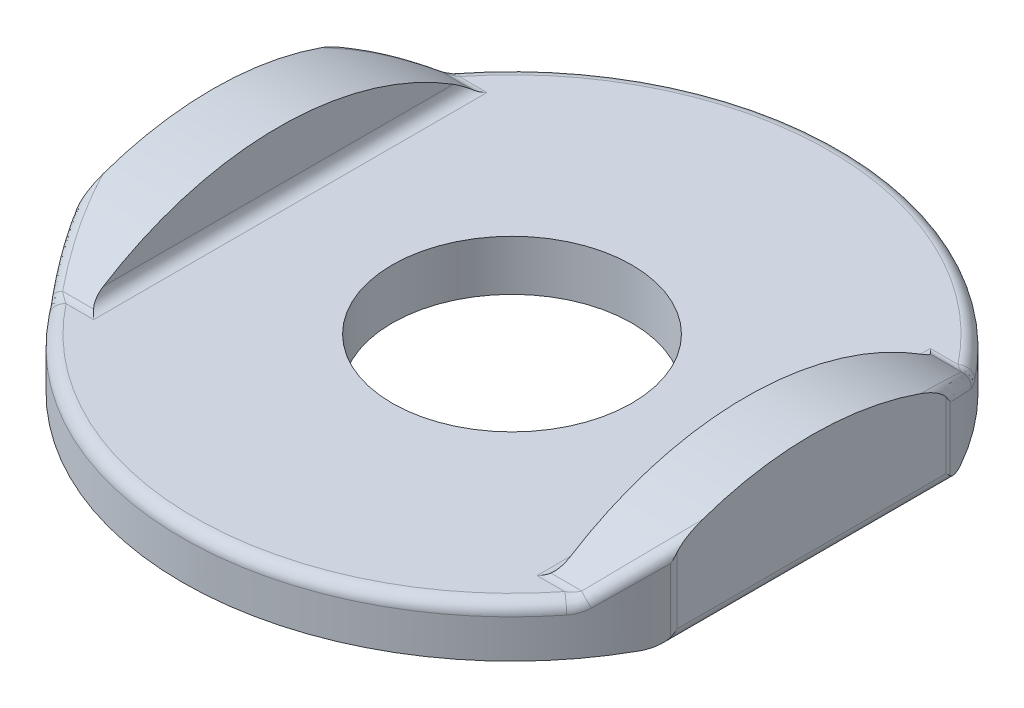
ISO-10303-21;
HEADER;
FILE_DESCRIPTION(('STEP AP214'),'2;1');
FILE_NAME('part.step','',(''),(''),'','','');
FILE_SCHEMA(('AUTOMOTIVE_DESIGN { 1 0 10303 214 1 1 1 1 }'));
ENDSEC;
DATA;
#1=APPLICATION_CONTEXT('core data for automotive mechanical design processes');
#2=APPLICATION_PROTOCOL_DEFINITION('international standard','automotive_design',2000,#1);
#3=PRODUCT_CONTEXT('',#1,'mechanical');
#4=PRODUCT('Part','Part','',(#3));
#5=PRODUCT_RELATED_PRODUCT_CATEGORY('part','',(#4));
#6=PRODUCT_DEFINITION_FORMATION('','',#4);
#7=PRODUCT_DEFINITION_CONTEXT('part definition',#1,'design');
#8=PRODUCT_DEFINITION('design','',#6,#7);
#9=PRODUCT_DEFINITION_SHAPE('','',#8);
#10=(LENGTH_UNIT() NAMED_UNIT(*) SI_UNIT(.MILLI.,.METRE.));
#11=(NAMED_UNIT(*) PLANE_ANGLE_UNIT() SI_UNIT($,.RADIAN.));
#12=(NAMED_UNIT(*) SI_UNIT($,.STERADIAN.) SOLID_ANGLE_UNIT());
#13=UNCERTAINTY_MEASURE_WITH_UNIT(LENGTH_MEASURE(1.E-05),#10,'distance_accuracy_value','');
#14=(GEOMETRIC_REPRESENTATION_CONTEXT(3) GLOBAL_UNCERTAINTY_ASSIGNED_CONTEXT((#13)) GLOBAL_UNIT_ASSIGNED_CONTEXT((#10,
#11,#12)) REPRESENTATION_CONTEXT('',''));
#15=CARTESIAN_POINT('',(0.,0.,0.));
#16=DIRECTION('',(0.,0.,1.));
#17=DIRECTION('',(1.,0.,0.));
#18=AXIS2_PLACEMENT_3D('',#15,#16,#17);
#19=CARTESIAN_POINT('',(6.3536828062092,0.899278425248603,26.1518458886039));
#20=CARTESIAN_POINT('',(6.38306089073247,0.896077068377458,26.1610001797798));
#21=CARTESIAN_POINT('',(6.41243030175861,0.887482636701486,26.1682654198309));
#22=CARTESIAN_POINT('',(6.439868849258,0.874057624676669,26.1731661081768));
#23=CARTESIAN_POINT('',(6.4673073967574,0.86063261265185,26.1780667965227));
#24=CARTESIAN_POINT('',(6.4927988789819,0.842384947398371,26.1806000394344));
#25=CARTESIAN_POINT('',(6.51467491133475,0.820508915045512,26.1806000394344));
#26=CARTESIAN_POINT('',(6.53655094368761,0.798632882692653,26.1806000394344));
#27=CARTESIAN_POINT('',(6.55479860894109,0.773141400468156,26.1780667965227));
#28=CARTESIAN_POINT('',(6.56822362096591,0.745702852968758,26.1731661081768));
#29=CARTESIAN_POINT('',(6.58164863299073,0.718264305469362,26.1682654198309));
#30=CARTESIAN_POINT('',(6.59024306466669,0.688894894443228,26.1610001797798));
#31=CARTESIAN_POINT('',(6.59344442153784,0.659516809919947,26.1518458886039));
#32=CARTESIAN_POINT('',(6.25101151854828,0.792732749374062,26.4565136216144));
#33=CARTESIAN_POINT('',(6.27942588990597,0.788790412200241,26.4664292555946));
#34=CARTESIAN_POINT('',(6.30783255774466,0.77975842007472,26.4742821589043));
#35=CARTESIAN_POINT('',(6.33444704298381,0.76620604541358,26.4795768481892));
#36=CARTESIAN_POINT('',(6.36106152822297,0.752653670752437,26.484871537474));
#37=CARTESIAN_POINT('',(6.38586939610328,0.734588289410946,26.4876051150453));
#38=CARTESIAN_POINT('',(6.40731184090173,0.713145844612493,26.4876051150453));
#39=CARTESIAN_POINT('',(6.42875428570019,0.69170339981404,26.4876051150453));
#40=CARTESIAN_POINT('',(6.44681966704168,0.666895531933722,26.484871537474));
#41=CARTESIAN_POINT('',(6.46037204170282,0.640281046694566,26.4795768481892));
#42=CARTESIAN_POINT('',(6.47392441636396,0.613666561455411,26.4742821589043));
#43=CARTESIAN_POINT('',(6.48295640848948,0.585259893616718,26.4664292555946));
#44=CARTESIAN_POINT('',(6.4868987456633,0.556845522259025,26.4565136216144));
#45=CARTESIAN_POINT('',(6.12795924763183,0.665036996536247,26.7537828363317));
#46=CARTESIAN_POINT('',(6.15528542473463,0.660304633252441,26.7641936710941));
#47=CARTESIAN_POINT('',(6.18260489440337,0.650824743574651,26.7724162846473));
#48=CARTESIAN_POINT('',(6.20828276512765,0.637167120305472,26.7779570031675));
#49=CARTESIAN_POINT('',(6.23396063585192,0.623509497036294,26.7834977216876));
#50=CARTESIAN_POINT('',(6.25798429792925,0.60568087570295,26.7863538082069));
#51=CARTESIAN_POINT('',(6.27891558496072,0.584749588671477,26.7863538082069));
#52=CARTESIAN_POINT('',(6.29984687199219,0.563818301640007,26.7863538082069));
#53=CARTESIAN_POINT('',(6.31767549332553,0.539794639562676,26.7834977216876));
#54=CARTESIAN_POINT('',(6.33133311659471,0.514116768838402,26.7779570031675));
#55=CARTESIAN_POINT('',(6.34499073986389,0.488438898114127,26.7724162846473));
#56=CARTESIAN_POINT('',(6.35447062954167,0.461119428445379,26.7641936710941));
#57=CARTESIAN_POINT('',(6.35920299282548,0.433793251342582,26.7537828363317));
#58=CARTESIAN_POINT('',(5.98570490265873,0.517414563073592,27.0408055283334));
#59=CARTESIAN_POINT('',(6.01188428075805,0.511938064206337,27.0514534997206));
#60=CARTESIAN_POINT('',(6.03805785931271,0.50206915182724,27.0598393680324));
#61=CARTESIAN_POINT('',(6.06273848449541,0.488368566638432,27.0654866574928));
#62=CARTESIAN_POINT('',(6.0874191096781,0.474667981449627,27.0711339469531));
#63=CARTESIAN_POINT('',(6.11059584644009,0.457141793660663,27.0740401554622));
#64=CARTESIAN_POINT('',(6.130951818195,0.436785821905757,27.0740401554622));
#65=CARTESIAN_POINT('',(6.15130778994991,0.416429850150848,27.0740401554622));
#66=CARTESIAN_POINT('',(6.16883397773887,0.393253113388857,27.0711339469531));
#67=CARTESIAN_POINT('',(6.18253456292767,0.368572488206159,27.0654866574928));
#68=CARTESIAN_POINT('',(6.19623514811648,0.343891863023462,27.0598393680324));
#69=CARTESIAN_POINT('',(6.20610406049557,0.317718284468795,27.0514534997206));
#70=CARTESIAN_POINT('',(6.21158055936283,0.29153890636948,27.0408055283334));
#71=CARTESIAN_POINT('',(5.84345055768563,0.369792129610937,27.327828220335));
#72=CARTESIAN_POINT('',(5.86848313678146,0.363571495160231,27.3387133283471));
#73=CARTESIAN_POINT('',(5.89351082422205,0.353313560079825,27.3472624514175));
#74=CARTESIAN_POINT('',(5.91719420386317,0.339570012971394,27.3530163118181));
#75=CARTESIAN_POINT('',(5.94087758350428,0.32582646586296,27.3587701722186));
#76=CARTESIAN_POINT('',(5.96320739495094,0.308602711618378,27.3617265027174));
#77=CARTESIAN_POINT('',(5.98298805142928,0.288822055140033,27.3617265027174));
#78=CARTESIAN_POINT('',(6.00276870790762,0.269041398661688,27.3617265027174));
#79=CARTESIAN_POINT('',(6.0199924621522,0.246711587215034,27.3587701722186));
#80=CARTESIAN_POINT('',(6.03373600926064,0.223028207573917,27.353016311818));
#81=CARTESIAN_POINT('',(6.04747955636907,0.199344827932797,27.3472624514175));
#82=CARTESIAN_POINT('',(6.05773749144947,0.174317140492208,27.3387133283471));
#83=CARTESIAN_POINT('',(6.06395812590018,0.149284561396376,27.327828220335));
#84=CARTESIAN_POINT('',(5.68199588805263,0.202244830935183,27.6046008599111));
#85=CARTESIAN_POINT('',(5.70582357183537,0.195326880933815,27.6154669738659));
#86=CARTESIAN_POINT('',(5.72964718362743,0.184739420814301,27.6239746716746));
#87=CARTESIAN_POINT('',(5.75227309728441,0.171015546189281,27.6296968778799));
#88=CARTESIAN_POINT('',(5.77489901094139,0.157291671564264,27.6354190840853));
#89=CARTESIAN_POINT('',(5.79631948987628,0.140436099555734,27.6383538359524));
#90=CARTESIAN_POINT('',(5.81546079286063,0.121294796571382,27.6383538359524));
#91=CARTESIAN_POINT('',(5.83460209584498,0.102153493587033,27.6383538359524));
#92=CARTESIAN_POINT('',(5.85145766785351,0.0807330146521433,27.6354190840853));
#93=CARTESIAN_POINT('',(5.86518154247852,0.0581071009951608,27.6296968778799));
#94=CARTESIAN_POINT('',(5.87890541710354,0.0354811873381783,27.6239746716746));
#95=CARTESIAN_POINT('',(5.88949287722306,0.0116575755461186,27.6154669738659));
#96=CARTESIAN_POINT('',(5.89641082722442,-0.0121701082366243,27.6046008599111));
#97=CARTESIAN_POINT('',(5.50288771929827,0.0163778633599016,27.8684718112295));
#98=CARTESIAN_POINT('',(5.52550005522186,0.00887911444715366,27.8791176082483));
#99=CARTESIAN_POINT('',(5.54810900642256,-0.001931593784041,27.8874281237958));
#100=CARTESIAN_POINT('',(5.56965591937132,-0.015548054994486,27.8930142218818));
#101=CARTESIAN_POINT('',(5.59120283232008,-0.029164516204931,27.8986003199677));
#102=CARTESIAN_POINT('',(5.61168125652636,-0.0455826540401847,27.9014603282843));
#103=CARTESIAN_POINT('',(5.63013229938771,-0.0640336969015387,27.9014603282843));
#104=CARTESIAN_POINT('',(5.64858334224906,-0.082484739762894,27.9014603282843));
#105=CARTESIAN_POINT('',(5.66500148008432,-0.102963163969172,27.8986003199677));
#106=CARTESIAN_POINT('',(5.67861794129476,-0.124510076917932,27.8930142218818));
#107=CARTESIAN_POINT('',(5.6922344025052,-0.146056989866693,27.8874281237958));
#108=CARTESIAN_POINT('',(5.7030451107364,-0.168665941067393,27.8791176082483));
#109=CARTESIAN_POINT('',(5.71054385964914,-0.191278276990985,27.8684718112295));
#110=B_SPLINE_SURFACE_WITH_KNOTS('',3,3,((#19,#20,#21,#22,#23,#24,#25,#26,#27,#28,#29,#30,#31),
(#32,#33,#34,#35,#36,#37,#38,#39,#40,#41,#42,#43,#44),(#45,#46,#47,#48,#49,#50,#51,#52,#53,#54,
#55,#56,#57),(#58,#59,#60,#61,#62,#63,#64,#65,#66,#67,#68,#69,#70),(#71,#72,#73,#74,#75,#76,#77,
#78,#79,#80,#81,#82,#83),(#84,#85,#86,#87,#88,#89,#90,#91,#92,#93,#94,#95,#96),(#97,#98,#99,
#100,#101,#102,#103,#104,#105,#106,#107,#108,#109)),.UNSPECIFIED.,.F.,.F.,.F.,(4,3,4),(4,3,3,3,
4),(3.47801004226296,3.6166330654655,3.75525608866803),(0.,0.25,0.5,0.75,1.),.UNSPECIFIED.);
#111=CARTESIAN_POINT('',(6.35368281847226,0.899278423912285,26.1518458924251));
#112=CARTESIAN_POINT('',(6.25101153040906,0.792732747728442,26.4565136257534));
#113=CARTESIAN_POINT('',(6.12795925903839,0.665036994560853,26.7537828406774));
#114=CARTESIAN_POINT('',(5.98570491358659,0.51741456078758,27.0408055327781));
#115=CARTESIAN_POINT('',(5.84345056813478,0.369792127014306,27.3278282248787));
#116=CARTESIAN_POINT('',(5.68199589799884,0.202244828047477,27.6046008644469));
#117=CARTESIAN_POINT('',(5.50288772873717,0.0163778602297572,27.8684718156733));
#118=B_SPLINE_CURVE_WITH_KNOTS('',3,(#111,#112,#113,#114,#115,#116,#117),.UNSPECIFIED.,.F.,.F.,
(4,3,4),(3.47801004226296,3.6166330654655,3.75525608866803),.UNSPECIFIED.);
#119=CARTESIAN_POINT('',(5.50288772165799,0.0163778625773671,27.8684718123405));
#120=VERTEX_POINT('',#119);
#121=CARTESIAN_POINT('',(6.34999999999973,0.89545663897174,26.1627453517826));
#122=VERTEX_POINT('',#121);
#123=EDGE_CURVE('E322',#120,#122,#118,.F.);
#124=CARTESIAN_POINT('',(5.50288771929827,0.0163778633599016,27.8684718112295));
#125=CARTESIAN_POINT('',(5.52550005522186,0.00887911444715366,27.8791176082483));
#126=CARTESIAN_POINT('',(5.54810900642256,-0.001931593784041,27.8874281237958));
#127=CARTESIAN_POINT('',(5.56965591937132,-0.015548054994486,27.8930142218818));
#128=CARTESIAN_POINT('',(5.59120283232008,-0.029164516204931,27.8986003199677));
#129=CARTESIAN_POINT('',(5.61168125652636,-0.0455826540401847,27.9014603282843));
#130=CARTESIAN_POINT('',(5.63013229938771,-0.0640336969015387,27.9014603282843));
#131=CARTESIAN_POINT('',(5.64858334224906,-0.082484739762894,27.9014603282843));
#132=CARTESIAN_POINT('',(5.66500148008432,-0.102963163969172,27.8986003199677));
#133=CARTESIAN_POINT('',(5.67861794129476,-0.124510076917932,27.8930142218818));
#134=CARTESIAN_POINT('',(5.6922344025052,-0.146056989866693,27.8874281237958));
#135=CARTESIAN_POINT('',(5.7030451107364,-0.168665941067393,27.8791176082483));
#136=CARTESIAN_POINT('',(5.71054385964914,-0.191278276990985,27.8684718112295));
#137=B_SPLINE_CURVE_WITH_KNOTS('',3,(#124,#125,#126,#127,#128,#129,#130,#131,#132,#133,#134,
#135,#136),.UNSPECIFIED.,.F.,.F.,(4,3,3,3,4),(0.,0.25,0.5,0.75,1.),.UNSPECIFIED.);
#138=CARTESIAN_POINT('',(5.71054385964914,-0.19127827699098,27.8684718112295));
#139=VERTEX_POINT('',#138);
#140=EDGE_CURVE('E564',#120,#139,#137,.T.);
#141=CARTESIAN_POINT('',(5.71054385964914,-0.191278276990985,27.8684718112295));
#142=CARTESIAN_POINT('',(5.89641082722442,-0.0121701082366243,27.6046008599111));
#143=CARTESIAN_POINT('',(6.06395812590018,0.149284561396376,27.327828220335));
#144=CARTESIAN_POINT('',(6.21158055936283,0.29153890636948,27.0408055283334));
#145=CARTESIAN_POINT('',(6.35920299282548,0.433793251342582,26.7537828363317));
#146=CARTESIAN_POINT('',(6.4868987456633,0.556845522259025,26.4565136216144));
#147=CARTESIAN_POINT('',(6.59344442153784,0.659516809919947,26.1518458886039));
#148=B_SPLINE_CURVE_WITH_KNOTS('',3,(#141,#142,#143,#144,#145,#146,#147),.UNSPECIFIED.,.F.,.F.,
(4,3,4),(3.47801004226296,3.6166330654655,3.75525608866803),.UNSPECIFIED.);
#149=CARTESIAN_POINT('',(6.32603605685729,0.40183242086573,26.8077109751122));
#150=VERTEX_POINT('',#149);
#151=EDGE_CURVE('E581',#139,#150,#148,.T.);
#152=CARTESIAN_POINT('',(6.32603415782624,0.401833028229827,26.8077103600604));
#153=CARTESIAN_POINT('',(6.32855975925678,0.410601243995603,26.8023145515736));
#154=CARTESIAN_POINT('',(6.33089231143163,0.419372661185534,26.7968333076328));
#155=CARTESIAN_POINT('',(6.33502171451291,0.436299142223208,26.7860786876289));
#156=CARTESIAN_POINT('',(6.33684432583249,0.444455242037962,26.7808168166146));
#157=CARTESIAN_POINT('',(6.34002717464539,0.460133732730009,26.7705349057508));
#158=CARTESIAN_POINT('',(6.34141164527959,0.467658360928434,26.7655257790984));
#159=CARTESIAN_POINT('',(6.34378515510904,0.482064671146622,26.7557829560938));
#160=CARTESIAN_POINT('',(6.34479701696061,0.488949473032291,26.7510594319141));
#161=CARTESIAN_POINT('',(6.34648679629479,0.502073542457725,26.7419203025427));
#162=CARTESIAN_POINT('',(6.34718620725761,0.508316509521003,26.737513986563));
#163=CARTESIAN_POINT('',(6.34830662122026,0.520160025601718,26.729040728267));
#164=CARTESIAN_POINT('',(6.34874795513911,0.525764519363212,26.7249819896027));
#165=CARTESIAN_POINT('',(6.34940326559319,0.536337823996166,26.7172329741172));
#166=CARTESIAN_POINT('',(6.34963650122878,0.541310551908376,26.7135496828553));
#167=CARTESIAN_POINT('',(6.34992011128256,0.550632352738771,26.7065818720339));
#168=CARTESIAN_POINT('',(6.34998905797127,0.554984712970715,26.7033024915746));
#169=CARTESIAN_POINT('',(6.34998978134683,0.559326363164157,26.7000086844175));
#170=B_SPLINE_CURVE_WITH_KNOTS('',3,(#152,#153,#154,#155,#156,#157,#158,#159,#160,#161,#162,
#163,#164,#165,#166,#167,#168,#169),.UNSPECIFIED.,.F.,.F.,(4,2,2,2,2,2,2,2,4),(0.,
0.031800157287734,0.0614205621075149,0.0888493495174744,0.114076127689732,0.137092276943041,
0.157890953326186,0.176466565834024,0.192814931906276),.UNSPECIFIED.);
#171=CARTESIAN_POINT('',(6.34999489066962,0.559327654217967,26.7000103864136));
#172=VERTEX_POINT('',#171);
#173=EDGE_CURVE('E548',#150,#172,#170,.T.);
#174=CARTESIAN_POINT('',(6.35000000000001,0.559318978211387,26.6999989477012));
#175=CARTESIAN_POINT('',(6.35000000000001,0.573005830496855,26.6895710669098));
#176=CARTESIAN_POINT('',(6.35000000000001,0.586106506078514,26.678429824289));
#177=CARTESIAN_POINT('',(6.35000000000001,0.611250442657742,26.6550680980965));
#178=CARTESIAN_POINT('',(6.35000000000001,0.623296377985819,26.6428505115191));
#179=CARTESIAN_POINT('',(6.35000000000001,0.646370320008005,26.617783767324));
#180=CARTESIAN_POINT('',(6.35000000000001,0.657409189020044,26.6049444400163));
#181=CARTESIAN_POINT('',(6.35000000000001,0.678742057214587,26.578646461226));
#182=CARTESIAN_POINT('',(6.35000000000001,0.689035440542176,26.5651873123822));
#183=CARTESIAN_POINT('',(6.35000000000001,0.713070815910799,26.532125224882));
#184=CARTESIAN_POINT('',(6.35000000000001,0.726480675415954,26.5122812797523));
#185=CARTESIAN_POINT('',(6.35000000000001,0.752132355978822,26.4718458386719));
#186=CARTESIAN_POINT('',(6.35000000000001,0.76437364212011,26.4512540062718));
#187=CARTESIAN_POINT('',(6.35000000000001,0.787796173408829,26.4094555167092));
#188=CARTESIAN_POINT('',(6.35000000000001,0.798976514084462,26.3882483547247));
#189=CARTESIAN_POINT('',(6.35000000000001,0.820665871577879,26.3447337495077));
#190=CARTESIAN_POINT('',(6.35000000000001,0.831146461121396,26.3224121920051));
#191=CARTESIAN_POINT('',(6.35000000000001,0.851137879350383,26.2773690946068));
#192=CARTESIAN_POINT('',(6.35000000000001,0.860649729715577,26.2546480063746));
#193=CARTESIAN_POINT('',(6.35000000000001,0.878734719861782,26.2089151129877));
#194=CARTESIAN_POINT('',(6.35000000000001,0.887310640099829,26.1859044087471));
#195=CARTESIAN_POINT('',(6.35000000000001,0.895456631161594,26.1627453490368));
#196=B_SPLINE_CURVE_WITH_KNOTS('',3,(#174,#175,#176,#177,#178,#179,#180,#181,#182,#183,#184,
#185,#186,#187,#188,#189,#190,#191,#192,#193,#194,#195),.UNSPECIFIED.,.F.,.F.,(4,2,2,2,2,2,2,2,
2,2,4),(0.,0.0515465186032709,0.102958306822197,0.153725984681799,0.204535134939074,
0.276335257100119,0.348168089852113,0.420061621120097,0.494015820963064,0.567891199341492,
0.64154076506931),.UNSPECIFIED.);
#197=EDGE_CURVE('E570',#172,#122,#196,.T.);
#198=ORIENTED_EDGE('',*,*,#123,.F.);
#199=ORIENTED_EDGE('',*,*,#140,.T.);
#200=ORIENTED_EDGE('',*,*,#151,.T.);
#201=ORIENTED_EDGE('',*,*,#173,.T.);
#202=ORIENTED_EDGE('',*,*,#197,.T.);
#203=EDGE_LOOP('',(#198,#199,#200,#201,#202));
#204=FACE_BOUND('',#203,.T.);
#205=ADVANCED_FACE('F16',(#204),#110,.T.);
#206=CARTESIAN_POINT('',(5.50288771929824,0.0163778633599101,19.8236190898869));
#207=CARTESIAN_POINT('',(5.52550005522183,0.00887911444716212,19.8129732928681));
#208=CARTESIAN_POINT('',(5.54810900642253,-0.00193159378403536,19.8046627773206));
#209=CARTESIAN_POINT('',(5.56965591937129,-0.015548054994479,19.7990766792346));
#210=CARTESIAN_POINT('',(5.59120283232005,-0.0291645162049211,19.7934905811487));
#211=CARTESIAN_POINT('',(5.61168125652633,-0.0455826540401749,19.7906305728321));
#212=CARTESIAN_POINT('',(5.63013229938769,-0.0640336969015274,19.7906305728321));
#213=CARTESIAN_POINT('',(5.64858334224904,-0.0824847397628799,19.7906305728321));
#214=CARTESIAN_POINT('',(5.66500148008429,-0.102963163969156,19.7934905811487));
#215=CARTESIAN_POINT('',(5.67861794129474,-0.124510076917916,19.7990766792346));
#216=CARTESIAN_POINT('',(5.69223440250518,-0.146056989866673,19.8046627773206));
#217=CARTESIAN_POINT('',(5.70304511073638,-0.168665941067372,19.8129732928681));
#218=CARTESIAN_POINT('',(5.71054385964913,-0.191278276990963,19.8236190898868));
#219=CARTESIAN_POINT('',(5.68199588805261,0.202244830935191,20.0874900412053));
#220=CARTESIAN_POINT('',(5.70582357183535,0.195326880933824,20.0766239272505));
#221=CARTESIAN_POINT('',(5.72964718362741,0.18473942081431,20.0681162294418));
#222=CARTESIAN_POINT('',(5.75227309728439,0.171015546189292,20.0623940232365));
#223=CARTESIAN_POINT('',(5.77489901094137,0.157291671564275,20.0566718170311));
#224=CARTESIAN_POINT('',(5.79631948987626,0.140436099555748,20.0537370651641));
#225=CARTESIAN_POINT('',(5.81546079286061,0.121294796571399,20.0537370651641));
#226=CARTESIAN_POINT('',(5.83460209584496,0.10215349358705,20.0537370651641));
#227=CARTESIAN_POINT('',(5.85145766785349,0.0807330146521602,20.0566718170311));
#228=CARTESIAN_POINT('',(5.86518154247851,0.0581071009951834,20.0623940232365));
#229=CARTESIAN_POINT('',(5.87890541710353,0.0354811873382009,20.0681162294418));
#230=CARTESIAN_POINT('',(5.88949287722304,0.0116575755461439,20.0766239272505));
#231=CARTESIAN_POINT('',(5.89641082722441,-0.0121701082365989,20.0874900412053));
#232=CARTESIAN_POINT('',(5.84345055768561,0.369792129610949,20.3642626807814));
#233=CARTESIAN_POINT('',(5.86848313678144,0.363571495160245,20.3533775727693));
#234=CARTESIAN_POINT('',(5.89351082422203,0.353313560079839,20.3448284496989));
#235=CARTESIAN_POINT('',(5.91719420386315,0.339570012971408,20.3390745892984));
#236=CARTESIAN_POINT('',(5.94087758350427,0.325826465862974,20.3333207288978));
#237=CARTESIAN_POINT('',(5.96320739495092,0.308602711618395,20.330364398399));
#238=CARTESIAN_POINT('',(5.98298805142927,0.28882205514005,20.330364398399));
#239=CARTESIAN_POINT('',(6.00276870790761,0.269041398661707,20.330364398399));
#240=CARTESIAN_POINT('',(6.01999246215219,0.246711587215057,20.3333207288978));
#241=CARTESIAN_POINT('',(6.03373600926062,0.223028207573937,20.3390745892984));
#242=CARTESIAN_POINT('',(6.04747955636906,0.19934482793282,20.3448284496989));
#243=CARTESIAN_POINT('',(6.05773749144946,0.174317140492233,20.3533775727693));
#244=CARTESIAN_POINT('',(6.06395812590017,0.149284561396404,20.3642626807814));
#245=CARTESIAN_POINT('',(5.98570490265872,0.517414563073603,20.6512853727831));
#246=CARTESIAN_POINT('',(6.01188428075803,0.511938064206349,20.6406374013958));
#247=CARTESIAN_POINT('',(6.0380578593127,0.502069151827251,20.632251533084));
#248=CARTESIAN_POINT('',(6.06273848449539,0.488368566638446,20.6266042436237));
#249=CARTESIAN_POINT('',(6.08741910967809,0.474667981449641,20.6209569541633));
#250=CARTESIAN_POINT('',(6.11059584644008,0.45714179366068,20.6180507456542));
#251=CARTESIAN_POINT('',(6.13095181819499,0.436785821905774,20.6180507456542));
#252=CARTESIAN_POINT('',(6.1513077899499,0.416429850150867,20.6180507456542));
#253=CARTESIAN_POINT('',(6.16883397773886,0.393253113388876,20.6209569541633));
#254=CARTESIAN_POINT('',(6.18253456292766,0.368572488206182,20.6266042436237));
#255=CARTESIAN_POINT('',(6.19623514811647,0.343891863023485,20.632251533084));
#256=CARTESIAN_POINT('',(6.20610406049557,0.31771828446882,20.6406374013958));
#257=CARTESIAN_POINT('',(6.21158055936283,0.291538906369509,20.6512853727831));
#258=CARTESIAN_POINT('',(6.12795924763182,0.665036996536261,20.9383080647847));
#259=CARTESIAN_POINT('',(6.15528542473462,0.660304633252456,20.9278972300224));
#260=CARTESIAN_POINT('',(6.18260489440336,0.650824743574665,20.9196746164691));
#261=CARTESIAN_POINT('',(6.20828276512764,0.637167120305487,20.914133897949));
#262=CARTESIAN_POINT('',(6.23396063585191,0.623509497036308,20.9085931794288));
#263=CARTESIAN_POINT('',(6.25798429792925,0.605680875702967,20.9057370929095));
#264=CARTESIAN_POINT('',(6.27891558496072,0.584749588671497,20.9057370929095));
#265=CARTESIAN_POINT('',(6.29984687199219,0.563818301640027,20.9057370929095));
#266=CARTESIAN_POINT('',(6.31767549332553,0.539794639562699,20.9085931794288));
#267=CARTESIAN_POINT('',(6.33133311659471,0.514116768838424,20.914133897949));
#268=CARTESIAN_POINT('',(6.34499073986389,0.488438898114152,20.9196746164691));
#269=CARTESIAN_POINT('',(6.35447062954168,0.461119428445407,20.9278972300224));
#270=CARTESIAN_POINT('',(6.35920299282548,0.43379325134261,20.9383080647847));
#271=CARTESIAN_POINT('',(6.25101151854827,0.792732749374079,21.235577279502));
#272=CARTESIAN_POINT('',(6.27942588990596,0.788790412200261,21.2256616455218));
#273=CARTESIAN_POINT('',(6.30783255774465,0.779758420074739,21.2178087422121));
#274=CARTESIAN_POINT('',(6.33444704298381,0.766206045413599,21.2125140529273));
#275=CARTESIAN_POINT('',(6.36106152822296,0.752653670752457,21.2072193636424));
#276=CARTESIAN_POINT('',(6.38586939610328,0.734588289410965,21.2044857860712));
#277=CARTESIAN_POINT('',(6.40731184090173,0.713145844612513,21.2044857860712));
#278=CARTESIAN_POINT('',(6.42875428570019,0.691703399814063,21.2044857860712));
#279=CARTESIAN_POINT('',(6.44681966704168,0.666895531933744,21.2072193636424));
#280=CARTESIAN_POINT('',(6.46037204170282,0.640281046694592,21.2125140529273));
#281=CARTESIAN_POINT('',(6.47392441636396,0.613666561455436,21.2178087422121));
#282=CARTESIAN_POINT('',(6.48295640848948,0.585259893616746,21.2256616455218));
#283=CARTESIAN_POINT('',(6.4868987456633,0.556845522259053,21.235577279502));
#284=CARTESIAN_POINT('',(6.35368280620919,0.89927842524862,21.5402450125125));
#285=CARTESIAN_POINT('',(6.38306089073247,0.896077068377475,21.5310907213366));
#286=CARTESIAN_POINT('',(6.41243030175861,0.887482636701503,21.5238254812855));
#287=CARTESIAN_POINT('',(6.439868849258,0.874057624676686,21.5189247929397));
#288=CARTESIAN_POINT('',(6.4673073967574,0.860632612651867,21.5140241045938));
#289=CARTESIAN_POINT('',(6.4927988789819,0.842384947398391,21.511490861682));
#290=CARTESIAN_POINT('',(6.51467491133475,0.820508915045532,21.511490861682));
#291=CARTESIAN_POINT('',(6.53655094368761,0.798632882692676,21.511490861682));
#292=CARTESIAN_POINT('',(6.55479860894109,0.773141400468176,21.5140241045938));
#293=CARTESIAN_POINT('',(6.56822362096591,0.74570285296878,21.5189247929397));
#294=CARTESIAN_POINT('',(6.58164863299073,0.718264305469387,21.5238254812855));
#295=CARTESIAN_POINT('',(6.5902430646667,0.688894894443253,21.5310907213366));
#296=CARTESIAN_POINT('',(6.59344442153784,0.659516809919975,21.5402450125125));
#297=B_SPLINE_SURFACE_WITH_KNOTS('',3,3,((#206,#207,#208,#209,#210,#211,#212,#213,#214,#215,
#216,#217,#218),(#219,#220,#221,#222,#223,#224,#225,#226,#227,#228,#229,#230,#231),(#232,#233,
#234,#235,#236,#237,#238,#239,#240,#241,#242,#243,#244),(#245,#246,#247,#248,#249,#250,#251,
#252,#253,#254,#255,#256,#257),(#258,#259,#260,#261,#262,#263,#264,#265,#266,#267,#268,#269,
#270),(#271,#272,#273,#274,#275,#276,#277,#278,#279,#280,#281,#282,#283),(#284,#285,#286,#287,
#288,#289,#290,#291,#292,#293,#294,#295,#296)),.UNSPECIFIED.,.F.,.F.,.F.,(4,3,4),(4,3,3,3,4),
(2.52792921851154,2.66655224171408,2.80517526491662),(0.,0.25,0.5,0.75,1.),.UNSPECIFIED.);
#298=CARTESIAN_POINT('',(6.35000000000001,0.895456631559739,21.5293455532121));
#299=CARTESIAN_POINT('',(6.35000000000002,0.888544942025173,21.5096892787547));
#300=CARTESIAN_POINT('',(6.35000000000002,0.881321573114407,21.4901424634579));
#301=CARTESIAN_POINT('',(6.35000000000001,0.866224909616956,21.4512945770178));
#302=CARTESIAN_POINT('',(6.35,0.858351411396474,21.4319935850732));
#303=CARTESIAN_POINT('',(6.35000000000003,0.833467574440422,21.3739228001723));
#304=CARTESIAN_POINT('',(6.35000000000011,0.815406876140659,21.3355983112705));
#305=CARTESIAN_POINT('',(6.34999999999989,0.772536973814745,21.253699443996));
#306=CARTESIAN_POINT('',(6.34999999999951,0.747097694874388,21.2104437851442));
#307=CARTESIAN_POINT('',(6.35000000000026,0.704997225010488,21.1484704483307));
#308=CARTESIAN_POINT('',(6.35000000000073,0.690368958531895,21.1283677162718));
#309=CARTESIAN_POINT('',(6.3499999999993,0.659548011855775,21.0894096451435));
#310=CARTESIAN_POINT('',(6.3499999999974,0.643357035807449,21.0705529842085));
#311=CARTESIAN_POINT('',(6.34999999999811,0.615857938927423,21.0417181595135));
#312=CARTESIAN_POINT('',(6.34999999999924,0.605146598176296,21.0311745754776));
#313=CARTESIAN_POINT('',(6.35000000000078,0.582883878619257,21.0109292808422));
#314=CARTESIAN_POINT('',(6.35000000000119,0.571329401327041,21.0012309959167));
#315=CARTESIAN_POINT('',(6.35000000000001,0.559318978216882,20.9920919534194));
#316=B_SPLINE_CURVE_WITH_KNOTS('',3,(#298,#299,#300,#301,#302,#303,#304,#305,#306,#307,#308,
#309,#310,#311,#312,#313,#314,#315),.UNSPECIFIED.,.F.,.F.,(4,2,2,2,2,2,2,2,4),(0.,
0.0625051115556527,0.125029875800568,0.252022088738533,0.402195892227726,0.476725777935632,
0.551175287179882,0.596223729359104,0.641446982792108),.UNSPECIFIED.);
#317=CARTESIAN_POINT('',(6.34999999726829,0.895456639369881,21.5293455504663));
#318=VERTEX_POINT('',#317);
#319=CARTESIAN_POINT('',(6.34999489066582,0.559327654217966,20.9920805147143));
#320=VERTEX_POINT('',#319);
#321=EDGE_CURVE('E534',#318,#320,#316,.T.);
#322=CARTESIAN_POINT('',(6.34998978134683,0.559326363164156,20.9920822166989));
#323=CARTESIAN_POINT('',(6.34998905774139,0.554984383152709,20.9887881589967));
#324=CARTESIAN_POINT('',(6.34992010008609,0.550631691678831,20.9855085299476));
#325=CARTESIAN_POINT('',(6.34963644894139,0.5413093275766,20.9785403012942));
#326=CARTESIAN_POINT('',(6.34940318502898,0.536336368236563,20.9748568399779));
#327=CARTESIAN_POINT('',(6.34874780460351,0.525762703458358,20.9671075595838));
#328=CARTESIAN_POINT('',(6.34830643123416,0.520158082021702,20.9630487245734));
#329=CARTESIAN_POINT('',(6.34718593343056,0.508314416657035,20.9545753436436));
#330=CARTESIAN_POINT('',(6.34648648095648,0.502071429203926,20.9501689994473));
#331=CARTESIAN_POINT('',(6.34479662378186,0.488947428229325,20.941029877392));
#332=CARTESIAN_POINT('',(6.34378472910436,0.482062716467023,20.9363063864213));
#333=CARTESIAN_POINT('',(6.34141117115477,0.467656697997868,20.9265636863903));
#334=CARTESIAN_POINT('',(6.34002668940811,0.460132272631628,20.9215546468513));
#335=CARTESIAN_POINT('',(6.33684385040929,0.444454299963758,20.9112729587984));
#336=CARTESIAN_POINT('',(6.33502126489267,0.436298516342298,20.9060112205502));
#337=CARTESIAN_POINT('',(6.33089196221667,0.419372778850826,20.8952569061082));
#338=CARTESIAN_POINT('',(6.32855949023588,0.410601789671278,20.8897758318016));
#339=CARTESIAN_POINT('',(6.32603398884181,0.401834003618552,20.8843801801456));
#340=B_SPLINE_CURVE_WITH_KNOTS('',3,(#322,#323,#324,#325,#326,#327,#328,#329,#330,#331,#332,
#333,#334,#335,#336,#337,#338,#339),.UNSPECIFIED.,.F.,.F.,(4,2,2,2,2,2,2,2,4),(0.,
0.0163496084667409,0.0349260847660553,0.0557252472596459,0.0787415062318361,0.103968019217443,
0.131396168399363,0.161015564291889,0.192814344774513),.UNSPECIFIED.);
#341=CARTESIAN_POINT('',(6.32603623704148,0.401834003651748,20.8843791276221));
#342=VERTEX_POINT('',#341);
#343=EDGE_CURVE('E793',#320,#342,#340,.T.);
#344=CARTESIAN_POINT('',(6.59344405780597,0.659520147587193,21.5402439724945));
#345=CARTESIAN_POINT('',(6.48689829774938,0.556848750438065,21.235576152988));
#346=CARTESIAN_POINT('',(6.35920245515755,0.433796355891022,20.938306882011));
#347=CARTESIAN_POINT('',(6.21157993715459,0.291541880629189,20.6512841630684));
#348=CARTESIAN_POINT('',(6.06395741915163,0.149287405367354,20.3642614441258));
#349=CARTESIAN_POINT('',(5.89641004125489,-0.0121674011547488,20.0874888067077));
#350=CARTESIAN_POINT('',(5.71054300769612,-0.191275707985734,19.8236178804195));
#351=B_SPLINE_CURVE_WITH_KNOTS('',3,(#344,#345,#346,#347,#348,#349,#350),.UNSPECIFIED.,.F.,.F.,
(4,3,4),(2.52792921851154,2.66655224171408,2.80517526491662),.UNSPECIFIED.);
#352=CARTESIAN_POINT('',(5.71054362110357,-0.191277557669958,19.8236187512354));
#353=VERTEX_POINT('',#352);
#354=EDGE_CURVE('E487',#342,#353,#351,.T.);
#355=CARTESIAN_POINT('',(5.50288771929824,0.0163778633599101,19.8236190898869));
#356=CARTESIAN_POINT('',(5.52550005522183,0.00887911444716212,19.8129732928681));
#357=CARTESIAN_POINT('',(5.54810900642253,-0.00193159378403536,19.8046627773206));
#358=CARTESIAN_POINT('',(5.56965591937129,-0.015548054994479,19.7990766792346));
#359=CARTESIAN_POINT('',(5.59120283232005,-0.0291645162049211,19.7934905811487));
#360=CARTESIAN_POINT('',(5.61168125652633,-0.0455826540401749,19.7906305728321));
#361=CARTESIAN_POINT('',(5.63013229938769,-0.0640336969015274,19.7906305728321));
#362=CARTESIAN_POINT('',(5.64858334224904,-0.0824847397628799,19.7906305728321));
#363=CARTESIAN_POINT('',(5.66500148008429,-0.102963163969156,19.7934905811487));
#364=CARTESIAN_POINT('',(5.67861794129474,-0.124510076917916,19.7990766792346));
#365=CARTESIAN_POINT('',(5.69223440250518,-0.146056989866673,19.8046627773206));
#366=CARTESIAN_POINT('',(5.70304511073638,-0.168665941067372,19.8129732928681));
#367=CARTESIAN_POINT('',(5.71054385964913,-0.191278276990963,19.8236190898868));
#368=B_SPLINE_CURVE_WITH_KNOTS('',3,(#355,#356,#357,#358,#359,#360,#361,#362,#363,#364,#365,
#366,#367),.UNSPECIFIED.,.F.,.F.,(4,3,3,3,4),(0.,0.25,0.5,0.75,1.),.UNSPECIFIED.);
#369=CARTESIAN_POINT('',(5.50288771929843,0.0163778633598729,19.8236190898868));
#370=VERTEX_POINT('',#369);
#371=EDGE_CURVE('E527',#353,#370,#368,.F.);
#372=CARTESIAN_POINT('',(5.50288771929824,0.0163778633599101,19.8236190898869));
#373=CARTESIAN_POINT('',(5.54714098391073,0.0623010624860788,19.8888159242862));
#374=CARTESIAN_POINT('',(5.59057305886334,0.107372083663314,19.9551768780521));
#375=CARTESIAN_POINT('',(5.67518862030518,0.19518068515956,20.0894369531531));
#376=CARTESIAN_POINT('',(5.71639208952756,0.237939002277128,20.1573099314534));
#377=CARTESIAN_POINT('',(5.79650387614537,0.321073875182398,20.2945132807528));
#378=CARTESIAN_POINT('',(5.8354328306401,0.361471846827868,20.363818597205));
#379=CARTESIAN_POINT('',(5.91094711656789,0.439835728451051,20.5038037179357));
#380=CARTESIAN_POINT('',(5.94755365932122,0.477823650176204,20.5744597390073));
#381=CARTESIAN_POINT('',(6.01837516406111,0.551317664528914,20.7170642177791));
#382=CARTESIAN_POINT('',(6.05261176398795,0.586846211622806,20.7889903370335));
#383=CARTESIAN_POINT('',(6.11865618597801,0.65538287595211,20.9340449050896));
#384=CARTESIAN_POINT('',(6.15048574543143,0.688413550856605,21.0071527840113));
#385=CARTESIAN_POINT('',(6.21168011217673,0.751917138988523,21.154482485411));
#386=CARTESIAN_POINT('',(6.24106654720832,0.78241249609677,21.2286856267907));
#387=CARTESIAN_POINT('',(6.29733813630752,0.840807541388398,21.3781136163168));
#388=CARTESIAN_POINT('',(6.32424460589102,0.86872934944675,21.4533218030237));
#389=CARTESIAN_POINT('',(6.34999998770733,0.895456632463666,21.5293455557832));
#390=B_SPLINE_CURVE_WITH_KNOTS('',3,(#372,#373,#374,#375,#376,#377,#378,#379,#380,#381,#382,
#383,#384,#385,#386,#387,#388,#389),.UNSPECIFIED.,.F.,.F.,(4,2,2,2,2,2,2,2,4),(0.,
0.2735995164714,0.544081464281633,0.811514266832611,1.07597973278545,1.33757596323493,
1.59642393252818,1.85266028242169,2.10643524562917),.UNSPECIFIED.);
#391=EDGE_CURVE('E126',#318,#370,#390,.F.);
#392=ORIENTED_EDGE('',*,*,#321,.T.);
#393=ORIENTED_EDGE('',*,*,#343,.T.);
#394=ORIENTED_EDGE('',*,*,#354,.T.);
#395=ORIENTED_EDGE('',*,*,#371,.T.);
#396=ORIENTED_EDGE('',*,*,#391,.F.);
#397=EDGE_LOOP('',(#392,#393,#394,#395,#396));
#398=FACE_BOUND('',#397,.T.);
#399=ADVANCED_FACE('F494',(#398),#297,.T.);
#400=CARTESIAN_POINT('',(-6.35368280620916,0.899278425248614,21.5402450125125));
#401=CARTESIAN_POINT('',(-6.38306089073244,0.89607706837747,21.5310907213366));
#402=CARTESIAN_POINT('',(-6.41243030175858,0.8874826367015,21.5238254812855));
#403=CARTESIAN_POINT('',(-6.43986884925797,0.874057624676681,21.5189247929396));
#404=CARTESIAN_POINT('',(-6.46730739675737,0.860632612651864,21.5140241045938));
#405=CARTESIAN_POINT('',(-6.49279887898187,0.842384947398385,21.511490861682));
#406=CARTESIAN_POINT('',(-6.51467491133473,0.820508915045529,21.511490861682));
#407=CARTESIAN_POINT('',(-6.53655094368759,0.79863288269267,21.511490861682));
#408=CARTESIAN_POINT('',(-6.55479860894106,0.773141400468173,21.5140241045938));
#409=CARTESIAN_POINT('',(-6.56822362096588,0.745702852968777,21.5189247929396));
#410=CARTESIAN_POINT('',(-6.5816486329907,0.718264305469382,21.5238254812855));
#411=CARTESIAN_POINT('',(-6.59024306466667,0.68889489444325,21.5310907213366));
#412=CARTESIAN_POINT('',(-6.59344442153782,0.659516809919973,21.5402450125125));
#413=CARTESIAN_POINT('',(-6.25101151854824,0.79273274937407,21.235577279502));
#414=CARTESIAN_POINT('',(-6.27942588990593,0.78879041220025,21.2256616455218));
#415=CARTESIAN_POINT('',(-6.30783255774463,0.779758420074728,21.2178087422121));
#416=CARTESIAN_POINT('',(-6.33444704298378,0.766206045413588,21.2125140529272));
#417=CARTESIAN_POINT('',(-6.36106152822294,0.752653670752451,21.2072193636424));
#418=CARTESIAN_POINT('',(-6.38586939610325,0.73458828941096,21.2044857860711));
#419=CARTESIAN_POINT('',(-6.40731184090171,0.71314584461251,21.2044857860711));
#420=CARTESIAN_POINT('',(-6.42875428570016,0.691703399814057,21.2044857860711));
#421=CARTESIAN_POINT('',(-6.44681966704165,0.666895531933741,21.2072193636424));
#422=CARTESIAN_POINT('',(-6.46037204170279,0.640281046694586,21.2125140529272));
#423=CARTESIAN_POINT('',(-6.47392441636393,0.613666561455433,21.2178087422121));
#424=CARTESIAN_POINT('',(-6.48295640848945,0.585259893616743,21.2256616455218));
#425=CARTESIAN_POINT('',(-6.48689874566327,0.556845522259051,21.235577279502));
#426=CARTESIAN_POINT('',(-6.1279592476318,0.665036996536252,20.9383080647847));
#427=CARTESIAN_POINT('',(-6.15528542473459,0.660304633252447,20.9278972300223));
#428=CARTESIAN_POINT('',(-6.18260489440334,0.650824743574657,20.9196746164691));
#429=CARTESIAN_POINT('',(-6.20828276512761,0.637167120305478,20.914133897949));
#430=CARTESIAN_POINT('',(-6.23396063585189,0.623509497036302,20.9085931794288));
#431=CARTESIAN_POINT('',(-6.25798429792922,0.605680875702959,20.9057370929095));
#432=CARTESIAN_POINT('',(-6.27891558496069,0.584749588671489,20.9057370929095));
#433=CARTESIAN_POINT('',(-6.29984687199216,0.563818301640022,20.9057370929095));
#434=CARTESIAN_POINT('',(-6.3176754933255,0.53979463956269,20.9085931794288));
#435=CARTESIAN_POINT('',(-6.33133311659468,0.514116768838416,20.914133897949));
#436=CARTESIAN_POINT('',(-6.34499073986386,0.488438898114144,20.9196746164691));
#437=CARTESIAN_POINT('',(-6.35447062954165,0.461119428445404,20.9278972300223));
#438=CARTESIAN_POINT('',(-6.35920299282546,0.43379325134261,20.9383080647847));
#439=CARTESIAN_POINT('',(-5.98570490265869,0.517414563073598,20.651285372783));
#440=CARTESIAN_POINT('',(-6.011884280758,0.511938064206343,20.6406374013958));
#441=CARTESIAN_POINT('',(-6.03805785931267,0.502069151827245,20.632251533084));
#442=CARTESIAN_POINT('',(-6.06273848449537,0.48836856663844,20.6266042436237));
#443=CARTESIAN_POINT('',(-6.08741910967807,0.474667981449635,20.6209569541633));
#444=CARTESIAN_POINT('',(-6.11059584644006,0.457141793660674,20.6180507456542));
#445=CARTESIAN_POINT('',(-6.13095181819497,0.436785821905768,20.6180507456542));
#446=CARTESIAN_POINT('',(-6.15130778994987,0.416429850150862,20.6180507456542));
#447=CARTESIAN_POINT('',(-6.16883397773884,0.393253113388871,20.6209569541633));
#448=CARTESIAN_POINT('',(-6.18253456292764,0.368572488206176,20.6266042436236));
#449=CARTESIAN_POINT('',(-6.19623514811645,0.343891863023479,20.632251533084));
#450=CARTESIAN_POINT('',(-6.20610406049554,0.317718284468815,20.6406374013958));
#451=CARTESIAN_POINT('',(-6.2115805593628,0.291538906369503,20.651285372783));
#452=CARTESIAN_POINT('',(-5.84345055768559,0.369792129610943,20.3642626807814));
#453=CARTESIAN_POINT('',(-5.86848313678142,0.363571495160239,20.3533775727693));
#454=CARTESIAN_POINT('',(-5.89351082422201,0.353313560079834,20.3448284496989));
#455=CARTESIAN_POINT('',(-5.91719420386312,0.339570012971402,20.3390745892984));
#456=CARTESIAN_POINT('',(-5.94087758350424,0.325826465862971,20.3333207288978));
#457=CARTESIAN_POINT('',(-5.9632073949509,0.30860271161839,20.330364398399));
#458=CARTESIAN_POINT('',(-5.98298805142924,0.288822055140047,20.330364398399));
#459=CARTESIAN_POINT('',(-6.00276870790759,0.269041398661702,20.330364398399));
#460=CARTESIAN_POINT('',(-6.01999246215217,0.246711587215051,20.3333207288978));
#461=CARTESIAN_POINT('',(-6.0337360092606,0.223028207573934,20.3390745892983));
#462=CARTESIAN_POINT('',(-6.04747955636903,0.199344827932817,20.3448284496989));
#463=CARTESIAN_POINT('',(-6.05773749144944,0.174317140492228,20.3533775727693));
#464=CARTESIAN_POINT('',(-6.06395812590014,0.149284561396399,20.3642626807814));
#465=CARTESIAN_POINT('',(-5.68199588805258,0.202244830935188,20.0874900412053));
#466=CARTESIAN_POINT('',(-5.70582357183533,0.195326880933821,20.0766239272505));
#467=CARTESIAN_POINT('',(-5.72964718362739,0.184739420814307,20.0681162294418));
#468=CARTESIAN_POINT('',(-5.75227309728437,0.17101554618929,20.0623940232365));
#469=CARTESIAN_POINT('',(-5.77489901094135,0.157291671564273,20.0566718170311));
#470=CARTESIAN_POINT('',(-5.79631948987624,0.140436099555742,20.053737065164));
#471=CARTESIAN_POINT('',(-5.81546079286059,0.121294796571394,20.053737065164));
#472=CARTESIAN_POINT('',(-5.83460209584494,0.102153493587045,20.053737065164));
#473=CARTESIAN_POINT('',(-5.85145766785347,0.0807330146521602,20.0566718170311));
#474=CARTESIAN_POINT('',(-5.86518154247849,0.0581071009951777,20.0623940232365));
#475=CARTESIAN_POINT('',(-5.87890541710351,0.0354811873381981,20.0681162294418));
#476=CARTESIAN_POINT('',(-5.88949287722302,0.0116575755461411,20.0766239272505));
#477=CARTESIAN_POINT('',(-5.89641082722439,-0.0121701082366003,20.0874900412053));
#478=CARTESIAN_POINT('',(-5.50288771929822,0.0163778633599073,19.8236190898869));
#479=CARTESIAN_POINT('',(-5.52550005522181,0.00887911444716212,19.8129732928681));
#480=CARTESIAN_POINT('',(-5.54810900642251,-0.00193159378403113,19.8046627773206));
#481=CARTESIAN_POINT('',(-5.56965591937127,-0.0155480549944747,19.7990766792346));
#482=CARTESIAN_POINT('',(-5.59120283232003,-0.0291645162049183,19.7934905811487));
#483=CARTESIAN_POINT('',(-5.61168125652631,-0.0455826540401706,19.7906305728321));
#484=CARTESIAN_POINT('',(-5.63013229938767,-0.0640336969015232,19.7906305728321));
#485=CARTESIAN_POINT('',(-5.64858334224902,-0.0824847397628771,19.7906305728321));
#486=CARTESIAN_POINT('',(-5.66500148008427,-0.102963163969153,19.7934905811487));
#487=CARTESIAN_POINT('',(-5.67861794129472,-0.124510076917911,19.7990766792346));
#488=CARTESIAN_POINT('',(-5.69223440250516,-0.146056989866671,19.8046627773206));
#489=CARTESIAN_POINT('',(-5.70304511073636,-0.168665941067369,19.8129732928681));
#490=CARTESIAN_POINT('',(-5.71054385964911,-0.19127827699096,19.8236190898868));
#491=B_SPLINE_SURFACE_WITH_KNOTS('',3,3,((#400,#401,#402,#403,#404,#405,#406,#407,#408,#409,
#410,#411,#412),(#413,#414,#415,#416,#417,#418,#419,#420,#421,#422,#423,#424,#425),(#426,#427,
#428,#429,#430,#431,#432,#433,#434,#435,#436,#437,#438),(#439,#440,#441,#442,#443,#444,#445,
#446,#447,#448,#449,#450,#451),(#452,#453,#454,#455,#456,#457,#458,#459,#460,#461,#462,#463,
#464),(#465,#466,#467,#468,#469,#470,#471,#472,#473,#474,#475,#476,#477),(#478,#479,#480,#481,
#482,#483,#484,#485,#486,#487,#488,#489,#490)),.UNSPECIFIED.,.F.,.F.,.F.,(4,3,4),(4,3,3,3,4),
(3.47801004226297,3.6166330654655,3.75525608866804),(0.,0.25,0.5,0.75,1.),.UNSPECIFIED.);
#492=CARTESIAN_POINT('',(-5.71054385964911,-0.19127827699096,19.8236190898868));
#493=CARTESIAN_POINT('',(-5.89641082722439,-0.0121701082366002,20.0874900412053));
#494=CARTESIAN_POINT('',(-6.06395812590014,0.149284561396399,20.3642626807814));
#495=CARTESIAN_POINT('',(-6.2115805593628,0.291538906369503,20.651285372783));
#496=CARTESIAN_POINT('',(-6.35920299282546,0.43379325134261,20.9383080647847));
#497=CARTESIAN_POINT('',(-6.48689874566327,0.556845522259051,21.235577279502));
#498=CARTESIAN_POINT('',(-6.59344442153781,0.659516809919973,21.5402450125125));
#499=B_SPLINE_CURVE_WITH_KNOTS('',3,(#492,#493,#494,#495,#496,#497,#498),.UNSPECIFIED.,.F.,.F.,
(4,3,4),(3.47801004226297,3.6166330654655,3.75525608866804),.UNSPECIFIED.);
#500=CARTESIAN_POINT('',(-5.71054385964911,-0.191278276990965,19.8236190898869));
#501=VERTEX_POINT('',#500);
#502=CARTESIAN_POINT('',(-6.32603605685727,0.401832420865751,20.8843799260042));
#503=VERTEX_POINT('',#502);
#504=EDGE_CURVE('E470',#501,#503,#499,.T.);
#505=CARTESIAN_POINT('',(-6.32603415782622,0.401833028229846,20.884380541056));
#506=CARTESIAN_POINT('',(-6.32855975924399,0.41060124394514,20.8897763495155));
#507=CARTESIAN_POINT('',(-6.33089231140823,0.419372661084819,20.8952575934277));
#508=CARTESIAN_POINT('',(-6.33502171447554,0.436299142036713,20.9060122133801));
#509=CARTESIAN_POINT('',(-6.33684432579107,0.444455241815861,20.911274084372));
#510=CARTESIAN_POINT('',(-6.34002717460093,0.460133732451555,20.9215559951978));
#511=CARTESIAN_POINT('',(-6.34141164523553,0.467658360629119,20.9265651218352));
#512=CARTESIAN_POINT('',(-6.34378515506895,0.482064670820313,20.9363079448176));
#513=CARTESIAN_POINT('',(-6.34479701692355,0.488949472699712,20.9410314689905));
#514=CARTESIAN_POINT('',(-6.34648679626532,0.502073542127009,20.9501705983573));
#515=CARTESIAN_POINT('',(-6.34718620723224,0.50831650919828,20.9545769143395));
#516=CARTESIAN_POINT('',(-6.34830662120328,0.52016002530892,20.9630501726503));
#517=CARTESIAN_POINT('',(-6.34874795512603,0.525764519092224,20.9671089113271));
#518=CARTESIAN_POINT('',(-6.34940326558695,0.536337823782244,20.9748579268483));
#519=CARTESIAN_POINT('',(-6.34963650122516,0.541310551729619,20.9785412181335));
#520=CARTESIAN_POINT('',(-6.3499201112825,0.550632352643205,20.9855090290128));
#521=CARTESIAN_POINT('',(-6.34998905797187,0.554984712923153,20.9887884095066));
#522=CARTESIAN_POINT('',(-6.34998978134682,0.559326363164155,20.9920822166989));
#523=B_SPLINE_CURVE_WITH_KNOTS('',3,(#505,#506,#507,#508,#509,#510,#511,#512,#513,#514,#515,
#516,#517,#518,#519,#520,#521,#522),.UNSPECIFIED.,.F.,.F.,(4,2,2,2,2,2,2,2,4),(0.,
0.0318001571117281,0.0614205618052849,0.0888493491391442,0.114076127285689,0.137092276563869,
0.15789095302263,0.176466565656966,0.192814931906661),.UNSPECIFIED.);
#524=CARTESIAN_POINT('',(-6.3499948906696,0.559327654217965,20.9920805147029));
#525=VERTEX_POINT('',#524);
#526=EDGE_CURVE('E1016',#503,#525,#523,.T.);
#527=CARTESIAN_POINT('',(-6.34999999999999,0.559318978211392,20.9920919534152));
#528=CARTESIAN_POINT('',(-6.34999999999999,0.573005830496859,21.0025198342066));
#529=CARTESIAN_POINT('',(-6.34999999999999,0.586106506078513,21.0136610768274));
#530=CARTESIAN_POINT('',(-6.34999999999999,0.611250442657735,21.0370228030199));
#531=CARTESIAN_POINT('',(-6.34999999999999,0.623296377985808,21.0492403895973));
#532=CARTESIAN_POINT('',(-6.34999999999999,0.646370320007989,21.0743071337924));
#533=CARTESIAN_POINT('',(-6.34999999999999,0.657409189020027,21.0871464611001));
#534=CARTESIAN_POINT('',(-6.34999999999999,0.678742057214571,21.1134444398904));
#535=CARTESIAN_POINT('',(-6.34999999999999,0.68903544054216,21.1269035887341));
#536=CARTESIAN_POINT('',(-6.34999999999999,0.713070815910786,21.1599656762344));
#537=CARTESIAN_POINT('',(-6.34999999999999,0.726480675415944,21.1798096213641));
#538=CARTESIAN_POINT('',(-6.34999999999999,0.752132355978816,21.2202450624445));
#539=CARTESIAN_POINT('',(-6.34999999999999,0.764373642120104,21.2408368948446));
#540=CARTESIAN_POINT('',(-6.34999999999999,0.787796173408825,21.2826353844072));
#541=CARTESIAN_POINT('',(-6.34999999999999,0.79897651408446,21.3038425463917));
#542=CARTESIAN_POINT('',(-6.34999999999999,0.820665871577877,21.3473571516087));
#543=CARTESIAN_POINT('',(-6.34999999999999,0.831146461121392,21.3696787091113));
#544=CARTESIAN_POINT('',(-6.34999999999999,0.85113787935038,21.4147218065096));
#545=CARTESIAN_POINT('',(-6.34999999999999,0.860649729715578,21.4374428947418));
#546=CARTESIAN_POINT('',(-6.34999999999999,0.87873471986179,21.4831757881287));
#547=CARTESIAN_POINT('',(-6.34999999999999,0.88731064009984,21.5061864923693));
#548=CARTESIAN_POINT('',(-6.34999999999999,0.895456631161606,21.5293455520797));
#549=B_SPLINE_CURVE_WITH_KNOTS('',3,(#527,#528,#529,#530,#531,#532,#533,#534,#535,#536,#537,
#538,#539,#540,#541,#542,#543,#544,#545,#546,#547,#548),.UNSPECIFIED.,.F.,.F.,(4,2,2,2,2,2,2,2,
2,2,4),(0.,0.0515465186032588,0.102958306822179,0.15372598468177,0.204535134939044,
0.276335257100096,0.348168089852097,0.420061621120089,0.494015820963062,0.5678911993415,
0.641540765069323),.UNSPECIFIED.);
#550=CARTESIAN_POINT('',(-6.34999999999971,0.895456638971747,21.5293455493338));
#551=VERTEX_POINT('',#550);
#552=EDGE_CURVE('E806',#525,#551,#549,.T.);
#553=CARTESIAN_POINT('',(-6.35368281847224,0.899278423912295,21.5402450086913));
#554=CARTESIAN_POINT('',(-6.25101153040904,0.792732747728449,21.235577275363));
#555=CARTESIAN_POINT('',(-6.12795925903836,0.665036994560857,20.938308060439));
#556=CARTESIAN_POINT('',(-5.98570491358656,0.517414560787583,20.6512853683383));
#557=CARTESIAN_POINT('',(-5.84345056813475,0.369792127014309,20.3642626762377));
#558=CARTESIAN_POINT('',(-5.6819958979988,0.202244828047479,20.0874900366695));
#559=CARTESIAN_POINT('',(-5.50288772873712,0.0163778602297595,19.8236190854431));
#560=B_SPLINE_CURVE_WITH_KNOTS('',3,(#553,#554,#555,#556,#557,#558,#559),.UNSPECIFIED.,.F.,.F.,
(4,3,4),(3.47801004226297,3.6166330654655,3.75525608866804),.UNSPECIFIED.);
#561=CARTESIAN_POINT('',(-5.50288772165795,0.0163778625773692,19.8236190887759));
#562=VERTEX_POINT('',#561);
#563=EDGE_CURVE('E125',#562,#551,#560,.F.);
#564=CARTESIAN_POINT('',(-5.50288771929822,0.0163778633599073,19.8236190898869));
#565=CARTESIAN_POINT('',(-5.52550005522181,0.00887911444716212,19.8129732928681));
#566=CARTESIAN_POINT('',(-5.54810900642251,-0.00193159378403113,19.8046627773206));
#567=CARTESIAN_POINT('',(-5.56965591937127,-0.0155480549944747,19.7990766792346));
#568=CARTESIAN_POINT('',(-5.59120283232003,-0.0291645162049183,19.7934905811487));
#569=CARTESIAN_POINT('',(-5.61168125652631,-0.0455826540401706,19.7906305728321));
#570=CARTESIAN_POINT('',(-5.63013229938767,-0.0640336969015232,19.7906305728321));
#571=CARTESIAN_POINT('',(-5.64858334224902,-0.0824847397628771,19.7906305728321));
#572=CARTESIAN_POINT('',(-5.66500148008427,-0.102963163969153,19.7934905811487));
#573=CARTESIAN_POINT('',(-5.67861794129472,-0.124510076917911,19.7990766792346));
#574=CARTESIAN_POINT('',(-5.69223440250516,-0.146056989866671,19.8046627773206));
#575=CARTESIAN_POINT('',(-5.70304511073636,-0.168665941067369,19.8129732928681));
#576=CARTESIAN_POINT('',(-5.71054385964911,-0.19127827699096,19.8236190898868));
#577=B_SPLINE_CURVE_WITH_KNOTS('',3,(#564,#565,#566,#567,#568,#569,#570,#571,#572,#573,#574,
#575,#576),.UNSPECIFIED.,.F.,.F.,(4,3,3,3,4),(0.,0.25,0.5,0.75,1.),.UNSPECIFIED.);
#578=EDGE_CURVE('E1013',#562,#501,#577,.T.);
#579=ORIENTED_EDGE('',*,*,#504,.T.);
#580=ORIENTED_EDGE('',*,*,#526,.T.);
#581=ORIENTED_EDGE('',*,*,#552,.T.);
#582=ORIENTED_EDGE('',*,*,#563,.F.);
#583=ORIENTED_EDGE('',*,*,#578,.T.);
#584=EDGE_LOOP('',(#579,#580,#581,#582,#583));
#585=FACE_BOUND('',#584,.T.);
#586=ADVANCED_FACE('F435',(#585),#491,.T.);
#587=CARTESIAN_POINT('',(-5.50288771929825,0.0163778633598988,27.8684718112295));
#588=CARTESIAN_POINT('',(-5.52550005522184,0.00887911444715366,27.8791176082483));
#589=CARTESIAN_POINT('',(-5.54810900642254,-0.001931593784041,27.8874281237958));
#590=CARTESIAN_POINT('',(-5.5696559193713,-0.015548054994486,27.8930142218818));
#591=CARTESIAN_POINT('',(-5.59120283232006,-0.029164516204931,27.8986003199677));
#592=CARTESIAN_POINT('',(-5.61168125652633,-0.0455826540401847,27.9014603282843));
#593=CARTESIAN_POINT('',(-5.63013229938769,-0.0640336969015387,27.9014603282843));
#594=CARTESIAN_POINT('',(-5.64858334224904,-0.082484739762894,27.9014603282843));
#595=CARTESIAN_POINT('',(-5.66500148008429,-0.102963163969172,27.8986003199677));
#596=CARTESIAN_POINT('',(-5.67861794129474,-0.124510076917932,27.8930142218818));
#597=CARTESIAN_POINT('',(-5.69223440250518,-0.146056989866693,27.8874281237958));
#598=CARTESIAN_POINT('',(-5.70304511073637,-0.168665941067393,27.8791176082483));
#599=CARTESIAN_POINT('',(-5.71054385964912,-0.191278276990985,27.8684718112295));
#600=CARTESIAN_POINT('',(-5.68199588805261,0.20224483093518,27.6046008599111));
#601=CARTESIAN_POINT('',(-5.70582357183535,0.195326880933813,27.6154669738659));
#602=CARTESIAN_POINT('',(-5.72964718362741,0.184739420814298,27.6239746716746));
#603=CARTESIAN_POINT('',(-5.75227309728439,0.171015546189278,27.6296968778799));
#604=CARTESIAN_POINT('',(-5.77489901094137,0.157291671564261,27.6354190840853));
#605=CARTESIAN_POINT('',(-5.79631948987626,0.140436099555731,27.6383538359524));
#606=CARTESIAN_POINT('',(-5.81546079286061,0.121294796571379,27.6383538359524));
#607=CARTESIAN_POINT('',(-5.83460209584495,0.102153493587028,27.6383538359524));
#608=CARTESIAN_POINT('',(-5.85145766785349,0.0807330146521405,27.6354190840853));
#609=CARTESIAN_POINT('',(-5.8651815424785,0.058107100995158,27.6296968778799));
#610=CARTESIAN_POINT('',(-5.87890541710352,0.0354811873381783,27.6239746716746));
#611=CARTESIAN_POINT('',(-5.88949287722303,0.0116575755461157,27.6154669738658));
#612=CARTESIAN_POINT('',(-5.8964108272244,-0.0121701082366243,27.6046008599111));
#613=CARTESIAN_POINT('',(-5.84345055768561,0.369792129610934,27.327828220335));
#614=CARTESIAN_POINT('',(-5.86848313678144,0.363571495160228,27.3387133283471));
#615=CARTESIAN_POINT('',(-5.89351082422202,0.353313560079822,27.3472624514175));
#616=CARTESIAN_POINT('',(-5.91719420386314,0.339570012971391,27.353016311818));
#617=CARTESIAN_POINT('',(-5.94087758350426,0.325826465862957,27.3587701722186));
#618=CARTESIAN_POINT('',(-5.96320739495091,0.308602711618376,27.3617265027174));
#619=CARTESIAN_POINT('',(-5.98298805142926,0.28882205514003,27.3617265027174));
#620=CARTESIAN_POINT('',(-6.0027687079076,0.269041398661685,27.3617265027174));
#621=CARTESIAN_POINT('',(-6.01999246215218,0.246711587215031,27.3587701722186));
#622=CARTESIAN_POINT('',(-6.03373600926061,0.223028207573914,27.353016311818));
#623=CARTESIAN_POINT('',(-6.04747955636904,0.199344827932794,27.3472624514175));
#624=CARTESIAN_POINT('',(-6.05773749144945,0.174317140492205,27.3387133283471));
#625=CARTESIAN_POINT('',(-6.06395812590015,0.149284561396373,27.327828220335));
#626=CARTESIAN_POINT('',(-5.98570490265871,0.517414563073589,27.0408055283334));
#627=CARTESIAN_POINT('',(-6.01188428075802,0.511938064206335,27.0514534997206));
#628=CARTESIAN_POINT('',(-6.03805785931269,0.502069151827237,27.0598393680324));
#629=CARTESIAN_POINT('',(-6.06273848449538,0.488368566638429,27.0654866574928));
#630=CARTESIAN_POINT('',(-6.08741910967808,0.474667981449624,27.0711339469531));
#631=CARTESIAN_POINT('',(-6.11059584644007,0.457141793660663,27.0740401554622));
#632=CARTESIAN_POINT('',(-6.13095181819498,0.436785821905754,27.0740401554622));
#633=CARTESIAN_POINT('',(-6.15130778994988,0.416429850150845,27.0740401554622));
#634=CARTESIAN_POINT('',(-6.16883397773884,0.393253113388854,27.0711339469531));
#635=CARTESIAN_POINT('',(-6.18253456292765,0.368572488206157,27.0654866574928));
#636=CARTESIAN_POINT('',(-6.19623514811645,0.343891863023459,27.0598393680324));
#637=CARTESIAN_POINT('',(-6.20610406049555,0.317718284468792,27.0514534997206));
#638=CARTESIAN_POINT('',(-6.21158055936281,0.291538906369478,27.0408055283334));
#639=CARTESIAN_POINT('',(-6.12795924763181,0.665036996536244,26.7537828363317));
#640=CARTESIAN_POINT('',(-6.15528542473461,0.660304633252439,26.7641936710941));
#641=CARTESIAN_POINT('',(-6.18260489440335,0.650824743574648,26.7724162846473));
#642=CARTESIAN_POINT('',(-6.20828276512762,0.63716712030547,26.7779570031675));
#643=CARTESIAN_POINT('',(-6.2339606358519,0.623509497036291,26.7834977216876));
#644=CARTESIAN_POINT('',(-6.25798429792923,0.605680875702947,26.7863538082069));
#645=CARTESIAN_POINT('',(-6.2789155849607,0.584749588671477,26.7863538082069));
#646=CARTESIAN_POINT('',(-6.29984687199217,0.563818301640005,26.7863538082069));
#647=CARTESIAN_POINT('',(-6.31767549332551,0.539794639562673,26.7834977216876));
#648=CARTESIAN_POINT('',(-6.33133311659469,0.514116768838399,26.7779570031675));
#649=CARTESIAN_POINT('',(-6.34499073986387,0.488438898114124,26.7724162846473));
#650=CARTESIAN_POINT('',(-6.35447062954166,0.461119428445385,26.7641936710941));
#651=CARTESIAN_POINT('',(-6.35920299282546,0.433793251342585,26.7537828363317));
#652=CARTESIAN_POINT('',(-6.25101151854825,0.792732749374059,26.4565136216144));
#653=CARTESIAN_POINT('',(-6.27942588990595,0.788790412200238,26.4664292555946));
#654=CARTESIAN_POINT('',(-6.30783255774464,0.779758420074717,26.4742821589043));
#655=CARTESIAN_POINT('',(-6.33444704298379,0.766206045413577,26.4795768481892));
#656=CARTESIAN_POINT('',(-6.36106152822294,0.75265367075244,26.484871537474));
#657=CARTESIAN_POINT('',(-6.38586939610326,0.734588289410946,26.4876051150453));
#658=CARTESIAN_POINT('',(-6.40731184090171,0.713145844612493,26.4876051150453));
#659=CARTESIAN_POINT('',(-6.42875428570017,0.69170339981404,26.4876051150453));
#660=CARTESIAN_POINT('',(-6.44681966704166,0.666895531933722,26.484871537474));
#661=CARTESIAN_POINT('',(-6.4603720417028,0.640281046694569,26.4795768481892));
#662=CARTESIAN_POINT('',(-6.47392441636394,0.613666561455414,26.4742821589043));
#663=CARTESIAN_POINT('',(-6.48295640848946,0.585259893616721,26.4664292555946));
#664=CARTESIAN_POINT('',(-6.48689874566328,0.556845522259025,26.4565136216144));
#665=CARTESIAN_POINT('',(-6.35368280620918,0.899278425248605,26.1518458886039));
#666=CARTESIAN_POINT('',(-6.38306089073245,0.896077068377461,26.1610001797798));
#667=CARTESIAN_POINT('',(-6.41243030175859,0.887482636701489,26.1682654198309));
#668=CARTESIAN_POINT('',(-6.43986884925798,0.874057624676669,26.1731661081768));
#669=CARTESIAN_POINT('',(-6.46730739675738,0.860632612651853,26.1780667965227));
#670=CARTESIAN_POINT('',(-6.49279887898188,0.842384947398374,26.1806000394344));
#671=CARTESIAN_POINT('',(-6.51467491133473,0.820508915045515,26.1806000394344));
#672=CARTESIAN_POINT('',(-6.53655094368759,0.798632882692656,26.1806000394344));
#673=CARTESIAN_POINT('',(-6.55479860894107,0.773141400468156,26.1780667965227));
#674=CARTESIAN_POINT('',(-6.56822362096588,0.74570285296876,26.1731661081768));
#675=CARTESIAN_POINT('',(-6.5816486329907,0.718264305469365,26.1682654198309));
#676=CARTESIAN_POINT('',(-6.59024306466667,0.688894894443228,26.1610001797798));
#677=CARTESIAN_POINT('',(-6.59344442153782,0.65951680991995,26.1518458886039));
#678=B_SPLINE_SURFACE_WITH_KNOTS('',3,3,((#587,#588,#589,#590,#591,#592,#593,#594,#595,#596,
#597,#598,#599),(#600,#601,#602,#603,#604,#605,#606,#607,#608,#609,#610,#611,#612),(#613,#614,
#615,#616,#617,#618,#619,#620,#621,#622,#623,#624,#625),(#626,#627,#628,#629,#630,#631,#632,
#633,#634,#635,#636,#637,#638),(#639,#640,#641,#642,#643,#644,#645,#646,#647,#648,#649,#650,
#651),(#652,#653,#654,#655,#656,#657,#658,#659,#660,#661,#662,#663,#664),(#665,#666,#667,#668,
#669,#670,#671,#672,#673,#674,#675,#676,#677)),.UNSPECIFIED.,.F.,.F.,.F.,(4,3,4),(4,3,3,3,4),
(2.52792921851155,2.66655224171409,2.80517526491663),(0.,0.25,0.5,0.75,1.),.UNSPECIFIED.);
#679=CARTESIAN_POINT('',(-5.50288771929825,0.0163778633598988,27.8684718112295));
#680=CARTESIAN_POINT('',(-5.68199588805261,0.20224483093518,27.6046008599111));
#681=CARTESIAN_POINT('',(-5.84345055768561,0.369792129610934,27.327828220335));
#682=CARTESIAN_POINT('',(-5.98570490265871,0.517414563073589,27.0408055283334));
#683=CARTESIAN_POINT('',(-6.12795924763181,0.665036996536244,26.7537828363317));
#684=CARTESIAN_POINT('',(-6.25101151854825,0.792732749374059,26.4565136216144));
#685=CARTESIAN_POINT('',(-6.35368280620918,0.899278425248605,26.1518458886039));
#686=B_SPLINE_CURVE_WITH_KNOTS('',3,(#679,#680,#681,#682,#683,#684,#685),.UNSPECIFIED.,.F.,.F.,
(4,3,4),(2.52792921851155,2.66655224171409,2.80517526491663),.UNSPECIFIED.);
#687=CARTESIAN_POINT('',(-6.34999999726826,0.895456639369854,26.1627453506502));
#688=VERTEX_POINT('',#687);
#689=CARTESIAN_POINT('',(-5.50288771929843,0.0163778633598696,27.8684718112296));
#690=VERTEX_POINT('',#689);
#691=EDGE_CURVE('E740',#688,#690,#686,.F.);
#692=CARTESIAN_POINT('',(-6.34999999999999,0.895456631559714,26.1627453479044));
#693=CARTESIAN_POINT('',(-6.35000000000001,0.888544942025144,26.1824016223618));
#694=CARTESIAN_POINT('',(-6.35,0.881321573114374,26.2019484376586));
#695=CARTESIAN_POINT('',(-6.34999999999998,0.866224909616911,26.2407963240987));
#696=CARTESIAN_POINT('',(-6.34999999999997,0.858351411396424,26.2600973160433));
#697=CARTESIAN_POINT('',(-6.35000000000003,0.833467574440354,26.3181681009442));
#698=CARTESIAN_POINT('',(-6.35000000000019,0.815406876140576,26.356492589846));
#699=CARTESIAN_POINT('',(-6.34999999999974,0.772536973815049,26.4383914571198));
#700=CARTESIAN_POINT('',(-6.34999999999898,0.747097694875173,26.4816471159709));
#701=CARTESIAN_POINT('',(-6.35000000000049,0.704997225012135,26.5436204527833));
#702=CARTESIAN_POINT('',(-6.35000000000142,0.690368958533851,26.563723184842));
#703=CARTESIAN_POINT('',(-6.34999999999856,0.659548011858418,26.6026812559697));
#704=CARTESIAN_POINT('',(-6.34999999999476,0.643357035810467,26.6215379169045));
#705=CARTESIAN_POINT('',(-6.3499999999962,0.615857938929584,26.6503727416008));
#706=CARTESIAN_POINT('',(-6.34999999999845,0.60514659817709,26.6609163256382));
#707=CARTESIAN_POINT('',(-6.35000000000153,0.582883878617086,26.6811616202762));
#708=CARTESIAN_POINT('',(-6.35000000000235,0.57132940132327,26.6908599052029));
#709=CARTESIAN_POINT('',(-6.34999999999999,0.559318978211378,26.6999989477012));
#710=B_SPLINE_CURVE_WITH_KNOTS('',3,(#692,#693,#694,#695,#696,#697,#698,#699,#700,#701,#702,
#703,#704,#705,#706,#707,#708,#709),.UNSPECIFIED.,.F.,.F.,(4,2,2,2,2,2,2,2,4),(0.,
0.0625051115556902,0.125029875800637,0.252022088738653,0.402195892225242,0.47672577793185,
0.551175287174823,0.596223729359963,0.641446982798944),.UNSPECIFIED.);
#711=CARTESIAN_POINT('',(-6.34999489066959,0.559327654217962,26.7000103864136));
#712=VERTEX_POINT('',#711);
#713=EDGE_CURVE('E794',#688,#712,#710,.T.);
#714=CARTESIAN_POINT('',(-6.3499897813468,0.559326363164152,26.7000086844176));
#715=CARTESIAN_POINT('',(-6.34998905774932,0.554984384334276,26.7033027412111));
#716=CARTESIAN_POINT('',(-6.34992010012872,0.550631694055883,26.7065823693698));
#717=CARTESIAN_POINT('',(-6.34963644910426,0.541309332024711,26.7135505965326));
#718=CARTESIAN_POINT('',(-6.34940318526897,0.536336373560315,26.7172340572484));
#719=CARTESIAN_POINT('',(-6.34874780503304,0.525762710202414,26.7249833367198));
#720=CARTESIAN_POINT('',(-6.34830643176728,0.520158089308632,26.7290421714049));
#721=CARTESIAN_POINT('',(-6.34718593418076,0.50831442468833,26.7375155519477));
#722=CARTESIAN_POINT('',(-6.34648648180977,0.502071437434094,26.7419218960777));
#723=CARTESIAN_POINT('',(-6.34479662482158,0.488947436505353,26.7510610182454));
#724=CARTESIAN_POINT('',(-6.34378473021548,0.48206272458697,26.7557845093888));
#725=CARTESIAN_POINT('',(-6.34141117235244,0.46765670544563,26.7655272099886));
#726=CARTESIAN_POINT('',(-6.34002669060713,0.460132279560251,26.7705362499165));
#727=CARTESIAN_POINT('',(-6.336843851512,0.444454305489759,26.7808179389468));
#728=CARTESIAN_POINT('',(-6.33502126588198,0.436298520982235,26.7860796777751));
#729=CARTESIAN_POINT('',(-6.33089196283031,0.4193727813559,26.7968339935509));
#730=CARTESIAN_POINT('',(-6.32855949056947,0.41060179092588,26.8023150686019));
#731=CARTESIAN_POINT('',(-6.32603398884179,0.401834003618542,26.8077107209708));
#732=B_SPLINE_CURVE_WITH_KNOTS('',3,(#714,#715,#716,#717,#718,#719,#720,#721,#722,#723,#724,
#725,#726,#727,#728,#729,#730,#731),.UNSPECIFIED.,.F.,.F.,(4,2,2,2,2,2,2,2,4),(0.,
0.0163496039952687,0.0349260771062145,0.0557252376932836,0.0787414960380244,0.10396800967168,
0.131396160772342,0.161015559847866,0.192814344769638),.UNSPECIFIED.);
#733=CARTESIAN_POINT('',(-6.32603623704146,0.401834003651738,26.8077117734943));
#734=VERTEX_POINT('',#733);
#735=EDGE_CURVE('E416',#712,#734,#732,.T.);
#736=CARTESIAN_POINT('',(-6.59344405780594,0.659520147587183,26.151846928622));
#737=CARTESIAN_POINT('',(-6.48689829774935,0.556848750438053,26.4565147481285));
#738=CARTESIAN_POINT('',(-6.35920245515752,0.433796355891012,26.7537840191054));
#739=CARTESIAN_POINT('',(-6.21157993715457,0.291541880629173,27.040806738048));
#740=CARTESIAN_POINT('',(-6.06395741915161,0.149287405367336,27.3278294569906));
#741=CARTESIAN_POINT('',(-5.89641004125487,-0.0121674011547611,27.6046020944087));
#742=CARTESIAN_POINT('',(-5.71054300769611,-0.191275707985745,27.8684730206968));
#743=B_SPLINE_CURVE_WITH_KNOTS('',3,(#736,#737,#738,#739,#740,#741,#742),.UNSPECIFIED.,.F.,.F.,
(4,3,4),(2.52792921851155,2.66655224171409,2.80517526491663),.UNSPECIFIED.);
#744=CARTESIAN_POINT('',(-5.71054362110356,-0.191277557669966,27.868472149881));
#745=VERTEX_POINT('',#744);
#746=EDGE_CURVE('E798',#734,#745,#743,.T.);
#747=CARTESIAN_POINT('',(-5.50288771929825,0.0163778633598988,27.8684718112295));
#748=CARTESIAN_POINT('',(-5.52550005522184,0.00887911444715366,27.8791176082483));
#749=CARTESIAN_POINT('',(-5.54810900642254,-0.001931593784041,27.8874281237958));
#750=CARTESIAN_POINT('',(-5.5696559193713,-0.015548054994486,27.8930142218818));
#751=CARTESIAN_POINT('',(-5.59120283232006,-0.029164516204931,27.8986003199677));
#752=CARTESIAN_POINT('',(-5.61168125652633,-0.0455826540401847,27.9014603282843));
#753=CARTESIAN_POINT('',(-5.63013229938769,-0.0640336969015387,27.9014603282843));
#754=CARTESIAN_POINT('',(-5.64858334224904,-0.082484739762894,27.9014603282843));
#755=CARTESIAN_POINT('',(-5.66500148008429,-0.102963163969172,27.8986003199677));
#756=CARTESIAN_POINT('',(-5.67861794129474,-0.124510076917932,27.8930142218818));
#757=CARTESIAN_POINT('',(-5.69223440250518,-0.146056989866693,27.8874281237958));
#758=CARTESIAN_POINT('',(-5.70304511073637,-0.168665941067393,27.8791176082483));
#759=CARTESIAN_POINT('',(-5.71054385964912,-0.191278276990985,27.8684718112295));
#760=B_SPLINE_CURVE_WITH_KNOTS('',3,(#747,#748,#749,#750,#751,#752,#753,#754,#755,#756,#757,
#758,#759),.UNSPECIFIED.,.F.,.F.,(4,3,3,3,4),(0.,0.25,0.5,0.75,1.),.UNSPECIFIED.);
#761=EDGE_CURVE('E744',#745,#690,#760,.F.);
#762=ORIENTED_EDGE('',*,*,#691,.F.);
#763=ORIENTED_EDGE('',*,*,#713,.T.);
#764=ORIENTED_EDGE('',*,*,#735,.T.);
#765=ORIENTED_EDGE('',*,*,#746,.T.);
#766=ORIENTED_EDGE('',*,*,#761,.T.);
#767=EDGE_LOOP('',(#762,#763,#764,#765,#766));
#768=FACE_BOUND('',#767,.T.);
#769=ADVANCED_FACE('F423',(#768),#678,.T.);
#770=CARTESIAN_POINT('',(-4.95299999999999,1.29083400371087,19.7586179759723));
#771=DIRECTION('',(1.,0.,0.));
#772=DIRECTION('',(0.,1.,0.));
#773=AXIS2_PLACEMENT_3D('',#770,#771,#772);
#774=PLANE('',#773);
#775=CARTESIAN_POINT('',(-4.95299999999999,-5.69416599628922,23.8460454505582));
#776=DIRECTION('',(-1.,0.,0.));
#777=DIRECTION('',(0.,-1.,0.));
#778=AXIS2_PLACEMENT_3D('',#775,#776,#777);
#779=CIRCLE('',#778,6.985);
#780=CARTESIAN_POINT('',(-4.95299999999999,0.224034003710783,27.5561847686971));
#781=VERTEX_POINT('',#780);
#782=CARTESIAN_POINT('',(-4.95299999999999,0.224034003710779,20.1359061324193));
#783=VERTEX_POINT('',#782);
#784=EDGE_CURVE('E199',#781,#783,#779,.T.);
#785=ORIENTED_EDGE('',*,*,#784,.F.);
#786=DIRECTION('',(0.,0.,1.));
#787=VECTOR('',#786,1.);
#788=CARTESIAN_POINT('',(-4.95299999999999,0.224034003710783,30.8310454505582));
#789=LINE('',#788,#787);
#790=EDGE_CURVE('E195',#781,#783,#789,.F.);
#791=ORIENTED_EDGE('',*,*,#790,.T.);
#792=EDGE_LOOP('',(#785,#791));
#793=FACE_BOUND('',#792,.T.);
#794=ADVANCED_FACE('F434',(#793),#774,.T.);
#795=CARTESIAN_POINT('',(4.95300000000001,1.29083400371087,19.7586179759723));
#796=DIRECTION('',(-1.,0.,0.));
#797=DIRECTION('',(0.,-1.,0.));
#798=AXIS2_PLACEMENT_3D('',#795,#796,#797);
#799=PLANE('',#798);
#800=CARTESIAN_POINT('',(4.95300000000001,-5.69416599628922,23.8460454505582));
#801=DIRECTION('',(-1.,0.,0.));
#802=DIRECTION('',(0.,-1.,0.));
#803=AXIS2_PLACEMENT_3D('',#800,#801,#802);
#804=CIRCLE('',#803,6.985);
#805=CARTESIAN_POINT('',(4.95300000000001,0.224034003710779,20.1359061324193));
#806=VERTEX_POINT('',#805);
#807=CARTESIAN_POINT('',(4.95300000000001,0.224034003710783,27.5561847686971));
#808=VERTEX_POINT('',#807);
#809=EDGE_CURVE('E114',#806,#808,#804,.F.);
#810=ORIENTED_EDGE('',*,*,#809,.F.);
#811=DIRECTION('',(0.,0.,-1.));
#812=VECTOR('',#811,1.);
#813=CARTESIAN_POINT('',(4.95300000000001,0.224034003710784,30.8310454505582));
#814=LINE('',#813,#812);
#815=EDGE_CURVE('E131',#806,#808,#814,.F.);
#816=ORIENTED_EDGE('',*,*,#815,.T.);
#817=EDGE_LOOP('',(#810,#816));
#818=FACE_BOUND('',#817,.T.);
#819=ADVANCED_FACE('F135',(#818),#799,.T.);
#820=CARTESIAN_POINT('',(6.35000000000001,-5.69416599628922,23.8460454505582));
#821=DIRECTION('',(-1.,0.,0.));
#822=DIRECTION('',(0.,-1.,0.));
#823=AXIS2_PLACEMENT_3D('',#820,#821,#822);
#824=CYLINDRICAL_SURFACE('',#823,6.985);
#825=ORIENTED_EDGE('',*,*,#809,.T.);
#826=CARTESIAN_POINT('',(4.95300000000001,0.224034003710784,27.5561847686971));
#827=CARTESIAN_POINT('',(4.95298810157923,0.212397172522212,27.574749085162));
#828=CARTESIAN_POINT('',(4.95219887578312,0.200664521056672,27.5932683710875));
#829=CARTESIAN_POINT('',(4.94890662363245,0.17705527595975,27.6301521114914));
#830=CARTESIAN_POINT('',(4.94639751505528,0.165178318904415,27.6485157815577));
#831=CARTESIAN_POINT('',(4.93963376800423,0.14185878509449,27.684206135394));
#832=CARTESIAN_POINT('',(4.93544827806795,0.130416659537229,27.7015458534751));
#833=CARTESIAN_POINT('',(4.92512139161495,0.10766729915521,27.7356952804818));
#834=CARTESIAN_POINT('',(4.91898260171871,0.0963599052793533,27.7525056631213));
#835=CARTESIAN_POINT('',(4.90383314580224,0.0731460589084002,27.786704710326));
#836=CARTESIAN_POINT('',(4.89462980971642,0.0612654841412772,27.8040295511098));
#837=CARTESIAN_POINT('',(4.8783074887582,0.0439527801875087,27.8290498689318));
#838=CARTESIAN_POINT('',(4.87237534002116,0.0382122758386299,27.8373056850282));
#839=CARTESIAN_POINT('',(4.85956011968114,0.0270357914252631,27.8533103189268));
#840=CARTESIAN_POINT('',(4.85267452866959,0.021600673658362,27.8610577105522));
#841=CARTESIAN_POINT('',(4.84527004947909,0.0163778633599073,27.8684718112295));
#842=B_SPLINE_CURVE_WITH_KNOTS('',3,(#826,#827,#828,#829,#830,#831,#832,#833,#834,#835,#836,
#837,#838,#839,#840,#841),.UNSPECIFIED.,.F.,.F.,(4,2,2,2,2,2,2,4),(0.,0.0657355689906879,
0.131704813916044,0.195194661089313,0.258600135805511,0.327152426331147,0.362129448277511,
0.397200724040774),.UNSPECIFIED.);
#843=CARTESIAN_POINT('',(4.84527004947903,0.0163778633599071,27.8684718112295));
#844=VERTEX_POINT('',#843);
#845=EDGE_CURVE('E121',#808,#844,#842,.T.);
#846=ORIENTED_EDGE('',*,*,#845,.T.);
#847=DIRECTION('',(-1.,0.,0.));
#848=VECTOR('',#847,1.);
#849=CARTESIAN_POINT('',(6.35000000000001,0.0163778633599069,27.8684718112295));
#850=LINE('',#849,#848);
#851=EDGE_CURVE('E673',#844,#120,#850,.F.);
#852=ORIENTED_EDGE('',*,*,#851,.T.);
#853=ORIENTED_EDGE('',*,*,#123,.T.);
#854=CARTESIAN_POINT('',(6.34999999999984,-5.69416599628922,23.8460454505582));
#855=DIRECTION('',(-1.,0.,0.));
#856=DIRECTION('',(0.,-1.,0.));
#857=AXIS2_PLACEMENT_3D('',#854,#855,#856);
#858=CIRCLE('',#857,6.985);
#859=EDGE_CURVE('E728',#318,#122,#858,.F.);
#860=ORIENTED_EDGE('',*,*,#859,.F.);
#861=ORIENTED_EDGE('',*,*,#391,.T.);
#862=DIRECTION('',(-1.,0.,0.));
#863=VECTOR('',#862,1.);
#864=CARTESIAN_POINT('',(6.35000000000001,0.0163778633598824,19.8236190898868));
#865=LINE('',#864,#863);
#866=CARTESIAN_POINT('',(4.84527004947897,0.0163778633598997,19.8236190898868));
#867=VERTEX_POINT('',#866);
#868=EDGE_CURVE('E155',#370,#867,#865,.T.);
#869=ORIENTED_EDGE('',*,*,#868,.T.);
#870=CARTESIAN_POINT('',(4.84527004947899,0.0163778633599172,19.8236190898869));
#871=CARTESIAN_POINT('',(4.85213752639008,0.0212208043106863,19.8304939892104));
#872=CARTESIAN_POINT('',(4.85855922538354,0.026248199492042,19.8376581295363));
#873=CARTESIAN_POINT('',(4.87057518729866,0.0365744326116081,19.8524356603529));
#874=CARTESIAN_POINT('',(4.8761713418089,0.0418726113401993,19.8600479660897));
#875=CARTESIAN_POINT('',(4.8917798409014,0.0579786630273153,19.8832925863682));
#876=CARTESIAN_POINT('',(4.90071690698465,0.0690763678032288,19.8994435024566));
#877=CARTESIAN_POINT('',(4.92141989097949,0.0992431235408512,19.9437693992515));
#878=CARTESIAN_POINT('',(4.93102758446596,0.118639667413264,19.9727063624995));
#879=CARTESIAN_POINT('',(4.94503199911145,0.157605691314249,20.031827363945));
#880=CARTESIAN_POINT('',(4.94940267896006,0.177175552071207,20.0620168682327));
#881=CARTESIAN_POINT('',(4.95201109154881,0.201172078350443,20.0996754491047));
#882=CARTESIAN_POINT('',(4.9523842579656,0.205772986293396,20.1069253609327));
#883=CARTESIAN_POINT('',(4.95287822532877,0.214931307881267,20.1214156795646));
#884=CARTESIAN_POINT('',(4.95300015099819,0.219488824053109,20.1286559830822));
#885=CARTESIAN_POINT('',(4.95300000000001,0.22403400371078,20.1359061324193));
#886=B_SPLINE_CURVE_WITH_KNOTS('',3,(#870,#871,#872,#873,#874,#875,#876,#877,#878,#879,#880,
#881,#882,#883,#884,#885),.UNSPECIFIED.,.F.,.F.,(4,2,2,2,2,2,2,4),(0.,0.0325323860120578,
0.0649890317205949,0.129394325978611,0.237243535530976,0.345626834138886,0.371409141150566,
0.397075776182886),.UNSPECIFIED.);
#887=EDGE_CURVE('E124',#867,#806,#886,.T.);
#888=ORIENTED_EDGE('',*,*,#887,.T.);
#889=EDGE_LOOP('',(#825,#846,#852,#853,#860,#861,#869,#888));
#890=FACE_BOUND('',#889,.T.);
#891=ADVANCED_FACE('F119',(#890),#824,.T.);
#892=CARTESIAN_POINT('',(6.35000000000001,-5.69416599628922,23.8460454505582));
#893=DIRECTION('',(-1.,0.,0.));
#894=DIRECTION('',(0.,-1.,0.));
#895=AXIS2_PLACEMENT_3D('',#892,#893,#894);
#896=CYLINDRICAL_SURFACE('',#895,6.985);
#897=ORIENTED_EDGE('',*,*,#784,.T.);
#898=CARTESIAN_POINT('',(-4.95299999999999,0.224034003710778,20.1359061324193));
#899=CARTESIAN_POINT('',(-4.9529881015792,0.212397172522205,20.1173418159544));
#900=CARTESIAN_POINT('',(-4.9521988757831,0.200664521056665,20.0988225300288));
#901=CARTESIAN_POINT('',(-4.94890662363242,0.177055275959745,20.061938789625));
#902=CARTESIAN_POINT('',(-4.94639751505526,0.16517831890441,20.0435751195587));
#903=CARTESIAN_POINT('',(-4.9396337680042,0.141858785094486,20.0078847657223));
#904=CARTESIAN_POINT('',(-4.93544827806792,0.130416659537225,19.9905450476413));
#905=CARTESIAN_POINT('',(-4.92512139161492,0.107667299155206,19.9563956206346));
#906=CARTESIAN_POINT('',(-4.91898260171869,0.0963599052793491,19.9395852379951));
#907=CARTESIAN_POINT('',(-4.90383314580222,0.0731460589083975,19.9053861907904));
#908=CARTESIAN_POINT('',(-4.8946298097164,0.0612654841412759,19.8880613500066));
#909=CARTESIAN_POINT('',(-4.87830748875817,0.0439527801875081,19.8630410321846));
#910=CARTESIAN_POINT('',(-4.87237534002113,0.0382122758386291,19.8547852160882));
#911=CARTESIAN_POINT('',(-4.85956011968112,0.0270357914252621,19.8387805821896));
#912=CARTESIAN_POINT('',(-4.85267452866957,0.021600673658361,19.8310331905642));
#913=CARTESIAN_POINT('',(-4.84527004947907,0.0163778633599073,19.8236190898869));
#914=B_SPLINE_CURVE_WITH_KNOTS('',3,(#898,#899,#900,#901,#902,#903,#904,#905,#906,#907,#908,
#909,#910,#911,#912,#913),.UNSPECIFIED.,.F.,.F.,(4,2,2,2,2,2,2,4),(0.,0.0657355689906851,
0.131704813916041,0.195194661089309,0.258600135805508,0.327152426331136,0.362129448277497,
0.397200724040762),.UNSPECIFIED.);
#915=CARTESIAN_POINT('',(-4.84527004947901,0.0163778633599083,19.8236190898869));
#916=VERTEX_POINT('',#915);
#917=EDGE_CURVE('E198',#783,#916,#914,.T.);
#918=ORIENTED_EDGE('',*,*,#917,.T.);
#919=DIRECTION('',(-1.,0.,0.));
#920=VECTOR('',#919,1.);
#921=CARTESIAN_POINT('',(6.35000000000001,0.0163778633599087,19.8236190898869));
#922=LINE('',#921,#920);
#923=EDGE_CURVE('E183',#916,#562,#922,.T.);
#924=ORIENTED_EDGE('',*,*,#923,.T.);
#925=ORIENTED_EDGE('',*,*,#563,.T.);
#926=CARTESIAN_POINT('',(-6.34999999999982,-5.69416599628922,23.8460454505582));
#927=DIRECTION('',(-1.,0.,0.));
#928=DIRECTION('',(0.,-1.,0.));
#929=AXIS2_PLACEMENT_3D('',#926,#927,#928);
#930=CIRCLE('',#929,6.985);
#931=EDGE_CURVE('E720',#551,#688,#930,.F.);
#932=ORIENTED_EDGE('',*,*,#931,.T.);
#933=ORIENTED_EDGE('',*,*,#691,.T.);
#934=DIRECTION('',(-1.,0.,0.));
#935=VECTOR('',#934,1.);
#936=CARTESIAN_POINT('',(6.35000000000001,0.0163778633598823,27.8684718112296));
#937=LINE('',#936,#935);
#938=CARTESIAN_POINT('',(-4.84527004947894,0.0163778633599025,27.8684718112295));
#939=VERTEX_POINT('',#938);
#940=EDGE_CURVE('E652',#690,#939,#937,.F.);
#941=ORIENTED_EDGE('',*,*,#940,.T.);
#942=CARTESIAN_POINT('',(-4.84527004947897,0.0163778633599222,27.8684718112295));
#943=CARTESIAN_POINT('',(-4.85213752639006,0.0212208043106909,27.861596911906));
#944=CARTESIAN_POINT('',(-4.85855922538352,0.0262481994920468,27.8544327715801));
#945=CARTESIAN_POINT('',(-4.87057518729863,0.0365744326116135,27.8396552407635));
#946=CARTESIAN_POINT('',(-4.87617134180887,0.0418726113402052,27.8320429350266));
#947=CARTESIAN_POINT('',(-4.89177984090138,0.0579786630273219,27.8087983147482));
#948=CARTESIAN_POINT('',(-4.90071690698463,0.0690763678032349,27.7926473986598));
#949=CARTESIAN_POINT('',(-4.92141989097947,0.099243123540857,27.7483215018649));
#950=CARTESIAN_POINT('',(-4.93102758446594,0.118639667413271,27.7193845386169));
#951=CARTESIAN_POINT('',(-4.94503199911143,0.157605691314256,27.6602635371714));
#952=CARTESIAN_POINT('',(-4.94940267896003,0.177175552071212,27.6300740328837));
#953=CARTESIAN_POINT('',(-4.95201109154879,0.20117207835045,27.5924154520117));
#954=CARTESIAN_POINT('',(-4.95238425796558,0.205772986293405,27.5851655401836));
#955=CARTESIAN_POINT('',(-4.95287822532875,0.214931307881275,27.5706752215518));
#956=CARTESIAN_POINT('',(-4.95300015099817,0.219488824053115,27.5634349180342));
#957=CARTESIAN_POINT('',(-4.95299999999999,0.224034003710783,27.5561847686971));
#958=B_SPLINE_CURVE_WITH_KNOTS('',3,(#942,#943,#944,#945,#946,#947,#948,#949,#950,#951,#952,
#953,#954,#955,#956,#957),.UNSPECIFIED.,.F.,.F.,(4,2,2,2,2,2,2,4),(0.,0.0325323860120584,
0.0649890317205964,0.129394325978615,0.23724353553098,0.345626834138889,0.371409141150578,
0.397075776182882),.UNSPECIFIED.);
#959=EDGE_CURVE('E192',#939,#781,#958,.T.);
#960=ORIENTED_EDGE('',*,*,#959,.T.);
#961=EDGE_LOOP('',(#897,#918,#924,#925,#932,#933,#941,#960));
#962=FACE_BOUND('',#961,.T.);
#963=ADVANCED_FACE('F212',(#962),#896,.T.);
#964=CARTESIAN_POINT('',(-4.69899999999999,0.224034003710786,30.8310454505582));
#965=DIRECTION('',(0.,0.,1.));
#966=DIRECTION('',(0.,-1.,0.));
#967=AXIS2_PLACEMENT_3D('',#964,#965,#966);
#968=CYLINDRICAL_SURFACE('',#967,0.254);
#969=CARTESIAN_POINT('',(-4.69899999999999,0.224034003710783,28.0147418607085));
#970=DIRECTION('',(-0.707106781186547,0.,0.707106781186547));
#971=DIRECTION('',(0.707106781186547,0.,0.707106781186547));
#972=AXIS2_PLACEMENT_3D('',#969,#970,#971);
#973=ELLIPSE('',#972,0.359210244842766,0.254);
#974=CARTESIAN_POINT('',(-4.69899999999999,-0.0299659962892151,28.0147418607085));
#975=VERTEX_POINT('',#974);
#976=EDGE_CURVE('E679',#939,#975,#973,.T.);
#977=ORIENTED_EDGE('',*,*,#976,.T.);
#978=DIRECTION('',(0.,0.,-1.));
#979=VECTOR('',#978,1.);
#980=CARTESIAN_POINT('',(-4.69899999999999,-0.0299659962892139,30.8310454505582));
#981=LINE('',#980,#979);
#982=CARTESIAN_POINT('',(-4.69899999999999,-0.0299659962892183,19.6773490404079));
#983=VERTEX_POINT('',#982);
#984=EDGE_CURVE('E717',#975,#983,#981,.T.);
#985=ORIENTED_EDGE('',*,*,#984,.T.);
#986=CARTESIAN_POINT('',(-4.69899999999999,0.224034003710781,19.6773490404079));
#987=DIRECTION('',(0.707106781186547,0.,0.707106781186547));
#988=DIRECTION('',(-0.707106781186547,0.,0.707106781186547));
#989=AXIS2_PLACEMENT_3D('',#986,#987,#988);
#990=ELLIPSE('',#989,0.359210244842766,0.254);
#991=EDGE_CURVE('E191',#983,#916,#990,.F.);
#992=ORIENTED_EDGE('',*,*,#991,.T.);
#993=ORIENTED_EDGE('',*,*,#917,.F.);
#994=ORIENTED_EDGE('',*,*,#790,.F.);
#995=ORIENTED_EDGE('',*,*,#959,.F.);
#996=EDGE_LOOP('',(#977,#985,#992,#993,#994,#995));
#997=FACE_BOUND('',#996,.T.);
#998=ADVANCED_FACE('F173',(#997),#968,.F.);
#999=CARTESIAN_POINT('',(6.35000000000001,0.22403400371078,19.6773490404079));
#1000=DIRECTION('',(-1.,0.,0.));
#1001=DIRECTION('',(0.,-1.,0.));
#1002=AXIS2_PLACEMENT_3D('',#999,#1000,#1001);
#1003=CYLINDRICAL_SURFACE('',#1002,0.254);
#1004=DIRECTION('',(1.,0.,0.));
#1005=VECTOR('',#1004,1.);
#1006=CARTESIAN_POINT('',(6.35000000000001,-0.0299659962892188,19.6773490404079));
#1007=LINE('',#1006,#1005);
#1008=CARTESIAN_POINT('',(-5.28472622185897,-0.0299659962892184,19.6773490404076));
#1009=VERTEX_POINT('',#1008);
#1010=EDGE_CURVE('E706',#983,#1009,#1007,.F.);
#1011=ORIENTED_EDGE('',*,*,#1010,.T.);
#1012=CARTESIAN_POINT('',(-5.50288771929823,0.0163778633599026,19.8236190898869));
#1013=CARTESIAN_POINT('',(-5.49483677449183,0.0123516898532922,19.8179040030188));
#1014=CARTESIAN_POINT('',(-5.48666685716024,0.00863747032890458,19.8121428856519));
#1015=CARTESIAN_POINT('',(-5.47002543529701,0.00175296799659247,19.8004869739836));
#1016=CARTESIAN_POINT('',(-5.46155145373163,-0.0014100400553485,19.7945914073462));
#1017=CARTESIAN_POINT('',(-5.44430836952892,-0.00721847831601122,19.7826773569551));
#1018=CARTESIAN_POINT('',(-5.43553673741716,-0.0098552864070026,19.7766583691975));
#1019=CARTESIAN_POINT('',(-5.41770384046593,-0.0146426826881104,19.7645070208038));
#1020=CARTESIAN_POINT('',(-5.40864019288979,-0.0167839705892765,19.7583745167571));
#1021=CARTESIAN_POINT('',(-5.3902236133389,-0.020596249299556,19.7460031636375));
#1022=CARTESIAN_POINT('',(-5.38086847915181,-0.0222573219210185,19.7397645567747));
#1023=CARTESIAN_POINT('',(-5.36196622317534,-0.0250972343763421,19.7272491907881));
#1024=CARTESIAN_POINT('',(-5.3524181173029,-0.026270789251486,19.7209727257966));
#1025=CARTESIAN_POINT('',(-5.33322922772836,-0.0281351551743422,19.7084510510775));
#1026=CARTESIAN_POINT('',(-5.3235883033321,-0.0288250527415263,19.7022059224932));
#1027=CARTESIAN_POINT('',(-5.30421357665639,-0.0297411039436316,19.6897459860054));
#1028=CARTESIAN_POINT('',(-5.29447956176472,-0.0299655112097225,19.6835313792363));
#1029=CARTESIAN_POINT('',(-5.2847262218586,-0.0299659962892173,19.6773490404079));
#1030=B_SPLINE_CURVE_WITH_KNOTS('',3,(#1012,#1013,#1014,#1015,#1016,#1017,#1018,#1019,#1020,
#1021,#1022,#1023,#1024,#1025,#1026,#1027,#1028,#1029),.UNSPECIFIED.,.F.,.F.,(4,2,2,2,2,2,2,2,
4),(0.,0.0319775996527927,0.0643496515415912,0.0972150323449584,0.130654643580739,
0.164742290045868,0.199190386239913,0.2337033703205,0.268345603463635),.UNSPECIFIED.);
#1031=EDGE_CURVE('E246',#562,#1009,#1030,.T.);
#1032=ORIENTED_EDGE('',*,*,#1031,.F.);
#1033=ORIENTED_EDGE('',*,*,#923,.F.);
#1034=ORIENTED_EDGE('',*,*,#991,.F.);
#1035=EDGE_LOOP('',(#1011,#1032,#1033,#1034));
#1036=FACE_BOUND('',#1035,.T.);
#1037=ADVANCED_FACE('F167',(#1036),#1003,.F.);
#1038=CARTESIAN_POINT('',(6.35000000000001,0.22403400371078,19.6773490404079));
#1039=DIRECTION('',(-1.,0.,0.));
#1040=DIRECTION('',(0.,-1.,0.));
#1041=AXIS2_PLACEMENT_3D('',#1038,#1039,#1040);
#1042=CYLINDRICAL_SURFACE('',#1041,0.254);
#1043=CARTESIAN_POINT('',(4.69900000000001,0.224034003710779,19.6773490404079));
#1044=DIRECTION('',(-0.707106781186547,0.,0.707106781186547));
#1045=DIRECTION('',(-0.707106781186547,0.,-0.707106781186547));
#1046=AXIS2_PLACEMENT_3D('',#1043,#1044,#1045);
#1047=ELLIPSE('',#1046,0.359210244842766,0.254);
#1048=CARTESIAN_POINT('',(4.69900000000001,-0.0299659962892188,19.6773490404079));
#1049=VERTEX_POINT('',#1048);
#1050=EDGE_CURVE('E137',#1049,#867,#1047,.T.);
#1051=ORIENTED_EDGE('',*,*,#1050,.T.);
#1052=ORIENTED_EDGE('',*,*,#868,.F.);
#1053=CARTESIAN_POINT('',(5.28472622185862,-0.0299659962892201,19.6773490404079));
#1054=CARTESIAN_POINT('',(5.32436839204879,-0.0299659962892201,19.7024765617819));
#1055=CARTESIAN_POINT('',(5.3625344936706,-0.0263178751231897,19.7274058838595));
#1056=CARTESIAN_POINT('',(5.39924965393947,-0.0187278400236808,19.7520664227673));
#1057=CARTESIAN_POINT('',(5.41760723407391,-0.0149328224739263,19.7643966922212));
#1058=CARTESIAN_POINT('',(5.4357315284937,-0.0100899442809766,19.776749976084));
#1059=CARTESIAN_POINT('',(5.45311087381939,-0.00422865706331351,19.7887589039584));
#1060=CARTESIAN_POINT('',(5.47049021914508,0.001632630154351,19.8007678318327));
#1061=CARTESIAN_POINT('',(5.48708631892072,0.00847716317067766,19.8124026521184));
#1062=CARTESIAN_POINT('',(5.50288771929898,0.0163778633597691,19.8236190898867));
#1063=B_SPLINE_CURVE_WITH_KNOTS('',3,(#1053,#1054,#1055,#1056,#1057,#1058,#1059,#1060,#1061,
#1062),.UNSPECIFIED.,.F.,.F.,(4,3,3,4),(0.000257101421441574,0.000446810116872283,
0.000541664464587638,0.000636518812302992),.UNSPECIFIED.);
#1064=CARTESIAN_POINT('',(5.28472622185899,-0.0299659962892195,19.6773490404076));
#1065=VERTEX_POINT('',#1064);
#1066=EDGE_CURVE('E150',#1065,#370,#1063,.T.);
#1067=ORIENTED_EDGE('',*,*,#1066,.F.);
#1068=DIRECTION('',(1.,0.,0.));
#1069=VECTOR('',#1068,1.);
#1070=CARTESIAN_POINT('',(6.35000000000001,-0.0299659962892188,19.6773490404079));
#1071=LINE('',#1070,#1069);
#1072=EDGE_CURVE('E699',#1065,#1049,#1071,.F.);
#1073=ORIENTED_EDGE('',*,*,#1072,.T.);
#1074=EDGE_LOOP('',(#1051,#1052,#1067,#1073));
#1075=FACE_BOUND('',#1074,.T.);
#1076=ADVANCED_FACE('F157',(#1075),#1042,.F.);
#1077=CARTESIAN_POINT('',(4.69900000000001,0.224034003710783,30.8310454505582));
#1078=DIRECTION('',(0.,0.,-1.));
#1079=DIRECTION('',(0.,1.,0.));
#1080=AXIS2_PLACEMENT_3D('',#1077,#1078,#1079);
#1081=CYLINDRICAL_SURFACE('',#1080,0.254);
#1082=CARTESIAN_POINT('',(4.69900000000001,0.224034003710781,28.0147418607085));
#1083=DIRECTION('',(-0.707106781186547,0.,-0.707106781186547));
#1084=DIRECTION('',(0.707106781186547,0.,-0.707106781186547));
#1085=AXIS2_PLACEMENT_3D('',#1082,#1083,#1084);
#1086=ELLIPSE('',#1085,0.359210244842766,0.254);
#1087=CARTESIAN_POINT('',(4.69900000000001,-0.0299659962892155,28.0147418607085));
#1088=VERTEX_POINT('',#1087);
#1089=EDGE_CURVE('E133',#1088,#844,#1086,.F.);
#1090=ORIENTED_EDGE('',*,*,#1089,.T.);
#1091=ORIENTED_EDGE('',*,*,#845,.F.);
#1092=ORIENTED_EDGE('',*,*,#815,.F.);
#1093=ORIENTED_EDGE('',*,*,#887,.F.);
#1094=ORIENTED_EDGE('',*,*,#1050,.F.);
#1095=DIRECTION('',(0.,0.,-1.));
#1096=VECTOR('',#1095,1.);
#1097=CARTESIAN_POINT('',(4.69900000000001,-0.0299659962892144,30.8310454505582));
#1098=LINE('',#1097,#1096);
#1099=EDGE_CURVE('E141',#1049,#1088,#1098,.F.);
#1100=ORIENTED_EDGE('',*,*,#1099,.T.);
#1101=EDGE_LOOP('',(#1090,#1091,#1092,#1093,#1094,#1100));
#1102=FACE_BOUND('',#1101,.T.);
#1103=ADVANCED_FACE('F130',(#1102),#1081,.F.);
#1104=CARTESIAN_POINT('',(6.35000000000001,0.22403400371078,28.0147418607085));
#1105=DIRECTION('',(-1.,0.,0.));
#1106=DIRECTION('',(0.,-1.,0.));
#1107=AXIS2_PLACEMENT_3D('',#1104,#1105,#1106);
#1108=CYLINDRICAL_SURFACE('',#1107,0.254);
#1109=CARTESIAN_POINT('',(5.50288771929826,0.0163778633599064,27.8684718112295));
#1110=CARTESIAN_POINT('',(5.49483677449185,0.0123516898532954,27.8741868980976));
#1111=CARTESIAN_POINT('',(5.48666685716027,0.00863747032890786,27.8799480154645));
#1112=CARTESIAN_POINT('',(5.47002543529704,0.00175296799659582,27.8916039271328));
#1113=CARTESIAN_POINT('',(5.46155145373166,-0.00141004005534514,27.8974994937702));
#1114=CARTESIAN_POINT('',(5.44430836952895,-0.00721847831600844,27.9094135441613));
#1115=CARTESIAN_POINT('',(5.43553673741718,-0.00985528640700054,27.9154325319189));
#1116=CARTESIAN_POINT('',(5.41770384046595,-0.0146426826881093,27.9275838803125));
#1117=CARTESIAN_POINT('',(5.40864019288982,-0.0167839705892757,27.9337163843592));
#1118=CARTESIAN_POINT('',(5.39022361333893,-0.0205962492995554,27.9460877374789));
#1119=CARTESIAN_POINT('',(5.38086847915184,-0.022257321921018,27.9523263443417));
#1120=CARTESIAN_POINT('',(5.36196622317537,-0.0250972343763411,27.9648417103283));
#1121=CARTESIAN_POINT('',(5.35241811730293,-0.0262707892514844,27.9711181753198));
#1122=CARTESIAN_POINT('',(5.33322922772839,-0.0281351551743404,27.9836398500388));
#1123=CARTESIAN_POINT('',(5.32358830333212,-0.0288250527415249,27.9898849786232));
#1124=CARTESIAN_POINT('',(5.30421357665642,-0.0297411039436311,28.002344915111));
#1125=CARTESIAN_POINT('',(5.29447956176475,-0.0299655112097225,28.0085595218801));
#1126=CARTESIAN_POINT('',(5.28472622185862,-0.0299659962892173,28.0147418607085));
#1127=B_SPLINE_CURVE_WITH_KNOTS('',3,(#1109,#1110,#1111,#1112,#1113,#1114,#1115,#1116,#1117,
#1118,#1119,#1120,#1121,#1122,#1123,#1124,#1125,#1126),.UNSPECIFIED.,.F.,.F.,(4,2,2,2,2,2,2,2,
4),(0.,0.0319775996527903,0.0643496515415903,0.0972150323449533,0.130654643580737,
0.164742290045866,0.19919038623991,0.2337033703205,0.268345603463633),.UNSPECIFIED.);
#1128=CARTESIAN_POINT('',(5.28472622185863,-0.0299659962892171,28.0147418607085));
#1129=VERTEX_POINT('',#1128);
#1130=EDGE_CURVE('E735',#120,#1129,#1127,.T.);
#1131=ORIENTED_EDGE('',*,*,#1130,.F.);
#1132=ORIENTED_EDGE('',*,*,#851,.F.);
#1133=ORIENTED_EDGE('',*,*,#1089,.F.);
#1134=DIRECTION('',(1.,0.,0.));
#1135=VECTOR('',#1134,1.);
#1136=CARTESIAN_POINT('',(6.35000000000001,-0.0299659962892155,28.0147418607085));
#1137=LINE('',#1136,#1135);
#1138=EDGE_CURVE('E704',#1088,#1129,#1137,.T.);
#1139=ORIENTED_EDGE('',*,*,#1138,.T.);
#1140=EDGE_LOOP('',(#1131,#1132,#1133,#1139));
#1141=FACE_BOUND('',#1140,.T.);
#1142=ADVANCED_FACE('F662',(#1141),#1108,.F.);
#1143=CARTESIAN_POINT('',(6.35000000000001,0.22403400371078,28.0147418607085));
#1144=DIRECTION('',(-1.,0.,0.));
#1145=DIRECTION('',(0.,-1.,0.));
#1146=AXIS2_PLACEMENT_3D('',#1143,#1144,#1145);
#1147=CYLINDRICAL_SURFACE('',#1146,0.254);
#1148=CARTESIAN_POINT('',(-5.28472622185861,-0.0299659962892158,28.0147418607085));
#1149=CARTESIAN_POINT('',(-5.29456739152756,-0.0299660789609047,28.0085040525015));
#1150=CARTESIAN_POINT('',(-5.30438898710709,-0.0297411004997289,28.0022330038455));
#1151=CARTESIAN_POINT('',(-5.32384758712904,-0.0288196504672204,27.9897172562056));
#1152=CARTESIAN_POINT('',(-5.33348533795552,-0.0281293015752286,27.983473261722));
#1153=CARTESIAN_POINT('',(-5.35257736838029,-0.0262676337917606,27.9710136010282));
#1154=CARTESIAN_POINT('',(-5.36203249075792,-0.025101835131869,27.9647984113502));
#1155=CARTESIAN_POINT('',(-5.38076018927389,-0.0222832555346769,27.9523988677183));
#1156=CARTESIAN_POINT('',(-5.39003364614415,-0.0206351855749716,27.946214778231));
#1157=CARTESIAN_POINT('',(-5.40841010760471,-0.0168319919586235,27.9338714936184));
#1158=CARTESIAN_POINT('',(-5.41751380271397,-0.0146799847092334,27.9277123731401));
#1159=CARTESIAN_POINT('',(-5.43547613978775,-0.00985422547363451,27.9154741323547));
#1160=CARTESIAN_POINT('',(-5.44433639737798,-0.0071867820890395,27.9093949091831));
#1161=CARTESIAN_POINT('',(-5.46169327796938,-0.00133528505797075,27.8974018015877));
#1162=CARTESIAN_POINT('',(-5.47019361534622,0.00183618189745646,27.8914872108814));
#1163=CARTESIAN_POINT('',(-5.48679463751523,0.00870329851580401,27.8798579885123));
#1164=CARTESIAN_POINT('',(-5.49490001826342,0.0123851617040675,27.8741418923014));
#1165=CARTESIAN_POINT('',(-5.50288771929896,0.0163778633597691,27.8684718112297));
#1166=B_SPLINE_CURVE_WITH_KNOTS('',3,(#1148,#1149,#1150,#1151,#1152,#1153,#1154,#1155,#1156,
#1157,#1158,#1159,#1160,#1161,#1162,#1163,#1164,#1165),.UNSPECIFIED.,.F.,.F.,(4,2,2,2,2,2,2,2,
4),(0.,0.0349543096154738,0.0694574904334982,0.103570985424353,0.137361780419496,
0.170948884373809,0.204148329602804,0.236621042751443,0.268344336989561),.UNSPECIFIED.);
#1167=CARTESIAN_POINT('',(-5.28472622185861,-0.0299659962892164,28.0147418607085));
#1168=VERTEX_POINT('',#1167);
#1169=EDGE_CURVE('E400',#1168,#690,#1166,.T.);
#1170=ORIENTED_EDGE('',*,*,#1169,.F.);
#1171=DIRECTION('',(1.,0.,0.));
#1172=VECTOR('',#1171,1.);
#1173=CARTESIAN_POINT('',(6.35000000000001,-0.0299659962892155,28.0147418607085));
#1174=LINE('',#1173,#1172);
#1175=EDGE_CURVE('E983',#1168,#975,#1174,.T.);
#1176=ORIENTED_EDGE('',*,*,#1175,.T.);
#1177=ORIENTED_EDGE('',*,*,#976,.F.);
#1178=ORIENTED_EDGE('',*,*,#940,.F.);
#1179=EDGE_LOOP('',(#1170,#1176,#1177,#1178));
#1180=FACE_BOUND('',#1179,.T.);
#1181=ADVANCED_FACE('F654',(#1180),#1147,.F.);
#1182=CARTESIAN_POINT('',(-5.28472622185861,-0.0299659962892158,28.0147418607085));
#1183=CARTESIAN_POINT('',(-5.31083071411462,-0.0299659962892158,28.0353335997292));
#1184=CARTESIAN_POINT('',(-5.33692493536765,-0.0365769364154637,28.0559172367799));
#1185=CARTESIAN_POINT('',(-5.36104234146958,-0.0493005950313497,28.074941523));
#1186=CARTESIAN_POINT('',(-5.38515974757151,-0.0620242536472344,28.09396580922));
#1187=CARTESIAN_POINT('',(-5.40728136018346,-0.0808506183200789,28.1114157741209));
#1188=CARTESIAN_POINT('',(-5.42574002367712,-0.104360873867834,28.1259763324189));
#1189=CARTESIAN_POINT('',(-5.44419868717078,-0.127871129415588,28.1405368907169));
#1190=CARTESIAN_POINT('',(-5.45897987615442,-0.156046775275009,28.1521965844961));
#1191=CARTESIAN_POINT('',(-5.4689696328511,-0.186764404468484,28.1600767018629));
#1192=CARTESIAN_POINT('',(-5.47895938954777,-0.21748203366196,28.1679568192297));
#1193=CARTESIAN_POINT('',(-5.48414985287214,-0.250717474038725,28.1720511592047));
#1194=CARTESIAN_POINT('',(-5.48414985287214,-0.283965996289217,28.1720511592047));
#1195=CARTESIAN_POINT('',(-5.32436839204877,-0.0299659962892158,27.9896143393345));
#1196=CARTESIAN_POINT('',(-5.34965050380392,-0.0320030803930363,28.0091546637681));
#1197=CARTESIAN_POINT('',(-5.37492426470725,-0.0401282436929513,28.0280345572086));
#1198=CARTESIAN_POINT('',(-5.39843490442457,-0.0537671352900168,28.0449494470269));
#1199=CARTESIAN_POINT('',(-5.42194554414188,-0.0674060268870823,28.0618643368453));
#1200=CARTESIAN_POINT('',(-5.443677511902,-0.086549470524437,28.0768032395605));
#1201=CARTESIAN_POINT('',(-5.46212013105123,-0.109862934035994,28.0887405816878));
#1202=CARTESIAN_POINT('',(-5.48056275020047,-0.133176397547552,28.100677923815));
#1203=CARTESIAN_POINT('',(-5.4957037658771,-0.160644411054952,28.1096060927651));
#1204=CARTESIAN_POINT('',(-5.5064870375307,-0.190358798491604,28.1149192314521));
#1205=CARTESIAN_POINT('',(-5.5172703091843,-0.220073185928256,28.1202323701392));
#1206=CARTESIAN_POINT('',(-5.52368857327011,-0.252014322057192,28.1219272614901));
#1207=CARTESIAN_POINT('',(-5.52528795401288,-0.283965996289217,28.1198996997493));
#1208=CARTESIAN_POINT('',(-5.36253449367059,-0.0263178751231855,27.9646850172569));
#1209=CARTESIAN_POINT('',(-5.3871517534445,-0.0300623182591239,27.9827589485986));
#1210=CARTESIAN_POINT('',(-5.41176203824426,-0.0393334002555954,27.9996785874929));
#1211=CARTESIAN_POINT('',(-5.4347825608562,-0.0535303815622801,28.0143639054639));
#1212=CARTESIAN_POINT('',(-5.45780308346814,-0.0677273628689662,28.0290492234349));
#1213=CARTESIAN_POINT('',(-5.4792207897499,-0.0868421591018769,28.041492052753));
#1214=CARTESIAN_POINT('',(-5.49765713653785,-0.109645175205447,28.0509025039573));
#1215=CARTESIAN_POINT('',(-5.5160934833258,-0.132448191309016,28.0603129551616));
#1216=CARTESIAN_POINT('',(-5.53153798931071,-0.158926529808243,28.066685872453));
#1217=CARTESIAN_POINT('',(-5.54299436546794,-0.187380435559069,28.0696222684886));
#1218=CARTESIAN_POINT('',(-5.55445074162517,-0.215834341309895,28.0725586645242));
#1219=CARTESIAN_POINT('',(-5.56191242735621,-0.24624775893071,28.0720570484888));
#1220=CARTESIAN_POINT('',(-5.56489428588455,-0.276669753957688,28.0681595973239));
#1221=CARTESIAN_POINT('',(-5.39924965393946,-0.0187278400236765,27.9400244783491));
#1222=CARTESIAN_POINT('',(-5.4232957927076,-0.0237604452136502,27.9563757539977));
#1223=CARTESIAN_POINT('',(-5.44733605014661,-0.0337565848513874,27.9711949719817));
#1224=CARTESIAN_POINT('',(-5.46993621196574,-0.0481199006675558,27.9835980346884));
#1225=CARTESIAN_POINT('',(-5.49253637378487,-0.0624832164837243,27.9960010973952));
#1226=CARTESIAN_POINT('',(-5.51368538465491,-0.0812066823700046,28.005981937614));
#1227=CARTESIAN_POINT('',(-5.53212151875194,-0.103173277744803,28.0129451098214));
#1228=CARTESIAN_POINT('',(-5.55055765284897,-0.125139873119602,28.0199082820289));
#1229=CARTESIAN_POINT('',(-5.56627189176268,-0.150338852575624,28.0238503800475));
#1230=CARTESIAN_POINT('',(-5.57832674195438,-0.177266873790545,28.0245362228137));
#1231=CARTESIAN_POINT('',(-5.59038159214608,-0.204194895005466,28.0252220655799));
#1232=CARTESIAN_POINT('',(-5.59877115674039,-0.23283878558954,28.0226513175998));
#1233=CARTESIAN_POINT('',(-5.60299492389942,-0.261489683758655,28.0169773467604));
#1234=CARTESIAN_POINT('',(-5.4176072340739,-0.014932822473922,27.9276942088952));
#1235=CARTESIAN_POINT('',(-5.44136781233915,-0.0206095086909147,27.9431841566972));
#1236=CARTESIAN_POINT('',(-5.46512305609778,-0.0309681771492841,27.9569531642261));
#1237=CARTESIAN_POINT('',(-5.48751303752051,-0.0454146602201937,27.9682150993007));
#1238=CARTESIAN_POINT('',(-5.50990301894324,-0.0598611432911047,27.9794770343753));
#1239=CARTESIAN_POINT('',(-5.53091768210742,-0.0783889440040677,27.9882268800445));
#1240=CARTESIAN_POINT('',(-5.54935370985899,-0.0999373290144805,27.9939664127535));
#1241=CARTESIAN_POINT('',(-5.56778973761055,-0.121485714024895,27.9997059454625));
#1242=CARTESIAN_POINT('',(-5.58363884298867,-0.146045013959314,28.0024326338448));
#1243=CARTESIAN_POINT('',(-5.5959929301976,-0.172210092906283,28.0019931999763));
#1244=CARTESIAN_POINT('',(-5.60834701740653,-0.198375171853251,28.0015537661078));
#1245=CARTESIAN_POINT('',(-5.61720052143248,-0.226134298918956,27.9979484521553));
#1246=CARTESIAN_POINT('',(-5.62204524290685,-0.253899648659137,27.9913862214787));
#1247=CARTESIAN_POINT('',(-5.43573152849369,-0.0100899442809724,27.9153409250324));
#1248=CARTESIAN_POINT('',(-5.45922900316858,-0.0163088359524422,27.9298966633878));
#1249=CARTESIAN_POINT('',(-5.48272161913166,-0.0269251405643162,27.9425709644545));
#1250=CARTESIAN_POINT('',(-5.50491813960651,-0.0413548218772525,27.9526692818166));
#1251=CARTESIAN_POINT('',(-5.52711466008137,-0.0557845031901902,27.9627675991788));
#1252=CARTESIAN_POINT('',(-5.54800590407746,-0.0740215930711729,27.9702857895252));
#1253=CARTESIAN_POINT('',(-5.56644340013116,-0.095064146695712,27.9748130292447));
#1254=CARTESIAN_POINT('',(-5.58488089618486,-0.116106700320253,27.9793402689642));
#1255=CARTESIAN_POINT('',(-5.60085701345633,-0.139946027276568,27.9808747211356));
#1256=CARTESIAN_POINT('',(-5.61349304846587,-0.165273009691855,27.97933446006));
#1257=CARTESIAN_POINT('',(-5.62612908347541,-0.190599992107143,27.9777941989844));
#1258=CARTESIAN_POINT('',(-5.63541979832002,-0.217404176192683,27.9731798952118));
#1259=CARTESIAN_POINT('',(-5.64085347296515,-0.244213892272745,27.9657473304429));
#1260=CARTESIAN_POINT('',(-5.45311087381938,-0.00422865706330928,27.903331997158));
#1261=CARTESIAN_POINT('',(-5.47636975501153,-0.010862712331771,27.9169242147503));
#1262=CARTESIAN_POINT('',(-5.49962418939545,-0.0216167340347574,27.9285023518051));
#1263=CARTESIAN_POINT('',(-5.52164545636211,-0.0359224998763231,27.93745464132));
#1264=CARTESIAN_POINT('',(-5.54366672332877,-0.0502282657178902,27.946406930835));
#1265=CARTESIAN_POINT('',(-5.56444640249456,-0.0680803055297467,27.9527299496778));
#1266=CARTESIAN_POINT('',(-5.58288653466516,-0.0885353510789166,27.9560896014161));
#1267=CARTESIAN_POINT('',(-5.60132666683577,-0.108990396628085,27.9594492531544));
#1268=CARTESIAN_POINT('',(-5.61742020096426,-0.132040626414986,27.9598442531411));
#1269=CARTESIAN_POINT('',(-5.63031678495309,-0.15646810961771,27.9572537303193));
#1270=CARTESIAN_POINT('',(-5.64321336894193,-0.180895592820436,27.9546632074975));
#1271=CARTESIAN_POINT('',(-5.65290807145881,-0.206690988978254,27.9490881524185));
#1272=CARTESIAN_POINT('',(-5.65888864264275,-0.232491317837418,27.9408231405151));
#1273=CARTESIAN_POINT('',(-5.47049021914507,0.001632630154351,27.8913230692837));
#1274=CARTESIAN_POINT('',(-5.49351050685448,-0.00541658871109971,27.9039517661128));
#1275=CARTESIAN_POINT('',(-5.51652675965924,-0.0163083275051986,27.9144337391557));
#1276=CARTESIAN_POINT('',(-5.5383727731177,-0.0304901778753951,27.9222400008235));
#1277=CARTESIAN_POINT('',(-5.56021878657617,-0.0446720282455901,27.9300462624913));
#1278=CARTESIAN_POINT('',(-5.58088690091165,-0.062139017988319,27.9351741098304));
#1279=CARTESIAN_POINT('',(-5.59932966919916,-0.0820065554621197,27.9373661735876));
#1280=CARTESIAN_POINT('',(-5.61777243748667,-0.101874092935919,27.9395582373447));
#1281=CARTESIAN_POINT('',(-5.63398338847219,-0.124135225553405,27.9388137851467));
#1282=CARTESIAN_POINT('',(-5.64714052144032,-0.147663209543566,27.9351730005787));
#1283=CARTESIAN_POINT('',(-5.66029765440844,-0.171191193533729,27.9315322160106));
#1284=CARTESIAN_POINT('',(-5.6703963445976,-0.195977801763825,27.9249964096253));
#1285=CARTESIAN_POINT('',(-5.67692381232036,-0.220768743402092,27.9158989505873));
#1286=CARTESIAN_POINT('',(-5.48708631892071,0.00847716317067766,27.879688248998));
#1287=CARTESIAN_POINT('',(-5.50989275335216,0.00113883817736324,27.8913276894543));
#1288=CARTESIAN_POINT('',(-5.53269550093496,-0.00977241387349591,27.900715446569));
#1289=CARTESIAN_POINT('',(-5.55438463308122,-0.0237255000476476,27.9073964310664));
#1290=CARTESIAN_POINT('',(-5.57607376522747,-0.037678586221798,27.9140774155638));
#1291=CARTESIAN_POINT('',(-5.59664226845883,-0.0546690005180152,27.9180494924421));
#1292=CARTESIAN_POINT('',(-5.61508880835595,-0.0738705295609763,27.9191213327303));
#1293=CARTESIAN_POINT('',(-5.63353534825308,-0.0930720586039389,27.9201931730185));
#1294=CARTESIAN_POINT('',(-5.64985395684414,-0.114478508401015,27.9183644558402));
#1295=CARTESIAN_POINT('',(-5.66324987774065,-0.137049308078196,27.9137261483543));
#1296=CARTESIAN_POINT('',(-5.67664579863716,-0.159620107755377,27.9090878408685));
#1297=CARTESIAN_POINT('',(-5.68711469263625,-0.18334797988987,27.9016414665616));
#1298=CARTESIAN_POINT('',(-5.69414618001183,-0.207079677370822,27.8917512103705));
#1299=CARTESIAN_POINT('',(-5.50288771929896,0.0163778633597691,27.8684718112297));
#1300=CARTESIAN_POINT('',(-5.52550005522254,0.008879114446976,27.8791176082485));
#1301=CARTESIAN_POINT('',(-5.54810900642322,-0.00193159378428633,27.8874281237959));
#1302=CARTESIAN_POINT('',(-5.56965591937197,-0.0155480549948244,27.8930142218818));
#1303=CARTESIAN_POINT('',(-5.59120283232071,-0.0291645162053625,27.8986003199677));
#1304=CARTESIAN_POINT('',(-5.61168125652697,-0.0455826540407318,27.9014603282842));
#1305=CARTESIAN_POINT('',(-5.63013229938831,-0.0640336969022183,27.9014603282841));
#1306=CARTESIAN_POINT('',(-5.64858334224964,-0.0824847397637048,27.901460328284));
#1307=CARTESIAN_POINT('',(-5.66500148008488,-0.102963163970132,27.8986003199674));
#1308=CARTESIAN_POINT('',(-5.67861794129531,-0.124510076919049,27.8930142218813));
#1309=CARTESIAN_POINT('',(-5.69223440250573,-0.146056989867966,27.8874281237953));
#1310=CARTESIAN_POINT('',(-5.70304511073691,-0.168665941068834,27.8791176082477));
#1311=CARTESIAN_POINT('',(-5.71054385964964,-0.191278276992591,27.8684718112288));
#1312=B_SPLINE_SURFACE_WITH_KNOTS('',3,3,((#1182,#1183,#1184,#1185,#1186,#1187,#1188,#1189,
#1190,#1191,#1192,#1193,#1194),(#1195,#1196,#1197,#1198,#1199,#1200,#1201,#1202,#1203,#1204,
#1205,#1206,#1207),(#1208,#1209,#1210,#1211,#1212,#1213,#1214,#1215,#1216,#1217,#1218,#1219,
#1220),(#1221,#1222,#1223,#1224,#1225,#1226,#1227,#1228,#1229,#1230,#1231,#1232,#1233),(#1234,
#1235,#1236,#1237,#1238,#1239,#1240,#1241,#1242,#1243,#1244,#1245,#1246),(#1247,#1248,#1249,
#1250,#1251,#1252,#1253,#1254,#1255,#1256,#1257,#1258,#1259),(#1260,#1261,#1262,#1263,#1264,
#1265,#1266,#1267,#1268,#1269,#1270,#1271,#1272),(#1273,#1274,#1275,#1276,#1277,#1278,#1279,
#1280,#1281,#1282,#1283,#1284,#1285),(#1286,#1287,#1288,#1289,#1290,#1291,#1292,#1293,#1294,
#1295,#1296,#1297,#1298),(#1299,#1300,#1301,#1302,#1303,#1304,#1305,#1306,#1307,#1308,#1309,
#1310,#1311)),.UNSPECIFIED.,.F.,.F.,.F.,(4,3,3,4),(4,3,3,3,4),(0.000257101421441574,
0.000446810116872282,0.000541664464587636,0.00063651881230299),(0.,0.25,0.5,0.75,1.),.UNSPECIFIED.);
#1313=CARTESIAN_POINT('',(-5.48414985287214,-0.283965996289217,28.1720511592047));
#1314=CARTESIAN_POINT('',(-5.48414985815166,-0.279810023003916,28.1720511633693));
#1315=CARTESIAN_POINT('',(-5.48406875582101,-0.275654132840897,28.1719871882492));
#1316=CARTESIAN_POINT('',(-5.48374587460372,-0.267352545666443,28.1717324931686));
#1317=CARTESIAN_POINT('',(-5.48350409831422,-0.263206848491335,28.1715417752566));
#1318=CARTESIAN_POINT('',(-5.48286140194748,-0.254935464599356,28.1710348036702));
#1319=CARTESIAN_POINT('',(-5.48246047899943,-0.250809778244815,28.170718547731));
#1320=CARTESIAN_POINT('',(-5.48150102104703,-0.242588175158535,28.1699617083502));
#1321=CARTESIAN_POINT('',(-5.48094248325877,-0.23849225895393,28.1695211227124));
#1322=CARTESIAN_POINT('',(-5.47966931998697,-0.230339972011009,28.1685168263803));
#1323=CARTESIAN_POINT('',(-5.47895469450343,-0.226283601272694,28.167953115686));
#1324=CARTESIAN_POINT('',(-5.47737087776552,-0.21822017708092,28.1667037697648));
#1325=CARTESIAN_POINT('',(-5.47650168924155,-0.214213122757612,28.1660181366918));
#1326=CARTESIAN_POINT('',(-5.47461026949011,-0.206258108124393,28.1645261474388));
#1327=CARTESIAN_POINT('',(-5.47358804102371,-0.202310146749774,28.1637197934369));
#1328=CARTESIAN_POINT('',(-5.47139206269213,-0.19448308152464,28.1619875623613));
#1329=CARTESIAN_POINT('',(-5.47021831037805,-0.190603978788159,28.1610616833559));
#1330=CARTESIAN_POINT('',(-5.46772095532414,-0.182924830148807,28.1590917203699));
#1331=CARTESIAN_POINT('',(-5.46639735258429,-0.179124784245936,28.1580476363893));
#1332=CARTESIAN_POINT('',(-5.46360477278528,-0.171612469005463,28.1558447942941));
#1333=CARTESIAN_POINT('',(-5.46213579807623,-0.167900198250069,28.1546860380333));
#1334=CARTESIAN_POINT('',(-5.45905682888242,-0.160571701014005,28.1522572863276));
#1335=CARTESIAN_POINT('',(-5.45744683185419,-0.156955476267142,28.1509872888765));
#1336=CARTESIAN_POINT('',(-5.45409016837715,-0.149827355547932,28.1483394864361));
#1337=CARTESIAN_POINT('',(-5.45234349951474,-0.146315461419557,28.146961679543));
#1338=CARTESIAN_POINT('',(-5.44871783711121,-0.139404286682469,28.1441016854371));
#1339=CARTESIAN_POINT('',(-5.4468388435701,-0.136005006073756,28.1426194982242));
#1340=CARTESIAN_POINT('',(-5.44295287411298,-0.12932734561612,28.1395541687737));
#1341=CARTESIAN_POINT('',(-5.44094590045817,-0.126048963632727,28.1379710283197));
#1342=CARTESIAN_POINT('',(-5.43680831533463,-0.119621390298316,28.1347072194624));
#1343=CARTESIAN_POINT('',(-5.43467770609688,-0.116472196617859,28.133026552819));
#1344=CARTESIAN_POINT('',(-5.43029718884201,-0.110311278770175,28.1295711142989));
#1345=CARTESIAN_POINT('',(-5.42804727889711,-0.107299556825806,28.1277963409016));
#1346=CARTESIAN_POINT('',(-5.42343276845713,-0.10142219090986,28.1241563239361));
#1347=CARTESIAN_POINT('',(-5.42106816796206,-0.0985565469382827,28.1222910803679));
#1348=CARTESIAN_POINT('',(-5.41623103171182,-0.092977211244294,28.1184754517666));
#1349=CARTESIAN_POINT('',(-5.41375849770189,-0.0902635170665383,28.1165250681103));
#1350=CARTESIAN_POINT('',(-5.4087120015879,-0.0849935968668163,28.112544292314));
#1351=CARTESIAN_POINT('',(-5.40613803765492,-0.0824373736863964,28.1105138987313));
#1352=CARTESIAN_POINT('',(-5.40089519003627,-0.0774879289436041,28.1063782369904));
#1353=CARTESIAN_POINT('',(-5.39822630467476,-0.0750947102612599,28.1042729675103));
#1354=CARTESIAN_POINT('',(-5.39280011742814,-0.0704768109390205,28.0999926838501));
#1355=CARTESIAN_POINT('',(-5.39004281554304,-0.0682521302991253,28.0978176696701));
#1356=CARTESIAN_POINT('',(-5.38444629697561,-0.0639768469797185,28.0934030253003));
#1357=CARTESIAN_POINT('',(-5.38160708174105,-0.0619262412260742,28.0911633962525));
#1358=CARTESIAN_POINT('',(-5.37585324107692,-0.0580046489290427,28.0866246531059));
#1359=CARTESIAN_POINT('',(-5.37293861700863,-0.0561336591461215,28.0843255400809));
#1360=CARTESIAN_POINT('',(-5.36704045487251,-0.0525768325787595,28.079672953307));
#1361=CARTESIAN_POINT('',(-5.36405691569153,-0.0508909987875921,28.0773194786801));
#1362=CARTESIAN_POINT('',(-5.35802776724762,-0.0477101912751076,28.0725635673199));
#1363=CARTESIAN_POINT('',(-5.3549821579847,-0.0462152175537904,28.0701611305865));
#1364=CARTESIAN_POINT('',(-5.34883687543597,-0.0434182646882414,28.0653136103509));
#1365=CARTESIAN_POINT('',(-5.34573720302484,-0.0421162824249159,28.0628685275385));
#1366=CARTESIAN_POINT('',(-5.33949146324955,-0.0397072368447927,28.0579417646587));
#1367=CARTESIAN_POINT('',(-5.33634539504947,-0.0386001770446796,28.0554600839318));
#1368=CARTESIAN_POINT('',(-5.33001453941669,-0.0365829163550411,28.0504661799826));
#1369=CARTESIAN_POINT('',(-5.32682975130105,-0.0356727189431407,28.0479539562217));
#1370=CARTESIAN_POINT('',(-5.3204291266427,-0.0340511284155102,28.0429050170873));
#1371=CARTESIAN_POINT('',(-5.31721329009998,-0.0333397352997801,28.0403683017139));
#1372=CARTESIAN_POINT('',(-5.31075824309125,-0.0321177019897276,28.0352764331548));
#1373=CARTESIAN_POINT('',(-5.3075190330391,-0.031607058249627,28.0327212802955));
#1374=CARTESIAN_POINT('',(-5.30102490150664,-0.0307884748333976,28.0275985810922));
#1375=CARTESIAN_POINT('',(-5.2977699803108,-0.0304805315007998,28.0250310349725));
#1376=CARTESIAN_POINT('',(-5.29125213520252,-0.0300692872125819,28.0198896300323));
#1377=CARTESIAN_POINT('',(-5.28798921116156,-0.0299659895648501,28.0173157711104));
#1378=CARTESIAN_POINT('',(-5.28472622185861,-0.0299659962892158,28.0147418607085));
#1379=B_SPLINE_CURVE_WITH_KNOTS('',3,(#1313,#1314,#1315,#1316,#1317,#1318,#1319,#1320,#1321,
#1322,#1323,#1324,#1325,#1326,#1327,#1328,#1329,#1330,#1331,#1332,#1333,#1334,#1335,#1336,#1337,
#1338,#1339,#1340,#1341,#1342,#1343,#1344,#1345,#1346,#1347,#1348,#1349,#1350,#1351,#1352,#1353,
#1354,#1355,#1356,#1357,#1358,#1359,#1360,#1361,#1362,#1363,#1364,#1365,#1366,#1367,#1368,#1369,
#1370,#1371,#1372,#1373,#1374,#1375,#1376,#1377,#1378),.UNSPECIFIED.,.F.,.F.,(4,2,2,2,2,2,2,2,2,
2,2,2,2,2,2,2,2,2,2,2,2,2,2,2,2,2,2,2,2,2,2,2,4),(0.,0.0124665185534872,0.0249328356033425,
0.0373993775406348,0.0498661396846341,0.0623329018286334,0.0747994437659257,0.0872657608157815,
0.0997322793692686,0.112198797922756,0.12466511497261,0.1371316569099,0.149598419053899,
0.162065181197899,0.174531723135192,0.186998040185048,0.199464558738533,0.211931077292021,
0.224397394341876,0.236863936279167,0.249330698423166,0.261797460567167,0.274264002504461,
0.286730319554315,0.299196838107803,0.311663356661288,0.324129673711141,0.336596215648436,
0.349062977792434,0.361529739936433,0.373996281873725,0.386462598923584,0.398929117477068),.UNSPECIFIED.);
#1380=CARTESIAN_POINT('',(-5.48414985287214,-0.283965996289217,28.1720511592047));
#1381=VERTEX_POINT('',#1380);
#1382=EDGE_CURVE('E973',#1168,#1381,#1379,.F.);
#1383=CARTESIAN_POINT('',(-5.71054385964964,-0.191278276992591,27.8684718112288));
#1384=CARTESIAN_POINT('',(-5.69414618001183,-0.207079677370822,27.8917512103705));
#1385=CARTESIAN_POINT('',(-5.67692381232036,-0.220768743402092,27.9158989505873));
#1386=CARTESIAN_POINT('',(-5.65888864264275,-0.232491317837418,27.9408231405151));
#1387=CARTESIAN_POINT('',(-5.64085347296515,-0.244213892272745,27.9657473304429));
#1388=CARTESIAN_POINT('',(-5.62204524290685,-0.253899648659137,27.9913862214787));
#1389=CARTESIAN_POINT('',(-5.60299492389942,-0.261489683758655,28.0169773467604));
#1390=CARTESIAN_POINT('',(-5.56489428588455,-0.276669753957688,28.0681595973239));
#1391=CARTESIAN_POINT('',(-5.52528795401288,-0.283965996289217,28.1198996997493));
#1392=CARTESIAN_POINT('',(-5.48414985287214,-0.283965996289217,28.1720511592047));
#1393=B_SPLINE_CURVE_WITH_KNOTS('',3,(#1383,#1384,#1385,#1386,#1387,#1388,#1389,#1390,#1391,
#1392),.UNSPECIFIED.,.F.,.F.,(4,3,3,4),(0.000257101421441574,0.000351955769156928,
0.000446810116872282,0.00063651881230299),.UNSPECIFIED.);
#1394=EDGE_CURVE('E635',#1381,#745,#1393,.F.);
#1395=ORIENTED_EDGE('',*,*,#1382,.F.);
#1396=ORIENTED_EDGE('',*,*,#1169,.T.);
#1397=ORIENTED_EDGE('',*,*,#761,.F.);
#1398=ORIENTED_EDGE('',*,*,#1394,.F.);
#1399=EDGE_LOOP('',(#1395,#1396,#1397,#1398));
#1400=FACE_BOUND('',#1399,.T.);
#1401=ADVANCED_FACE('F368',(#1400),#1312,.T.);
#1402=CARTESIAN_POINT('',(-6.09599999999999,1.29083400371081,26.7000154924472));
#1403=DIRECTION('',(0.,-1.,0.));
#1404=DIRECTION('',(0.,0.,-1.));
#1405=AXIS2_PLACEMENT_3D('',#1402,#1403,#1404);
#1406=CYLINDRICAL_SURFACE('',#1405,0.254000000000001);
#1407=CARTESIAN_POINT('',(-6.09599999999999,-0.842765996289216,26.7000154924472));
#1408=DIRECTION('',(0.,-0.707106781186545,-0.70710678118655));
#1409=DIRECTION('',(0.,-0.70710678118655,0.707106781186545));
#1410=AXIS2_PLACEMENT_3D('',#1407,#1408,#1409);
#1411=ELLIPSE('',#1410,0.359210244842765,0.254);
#1412=CARTESIAN_POINT('',(-6.34999999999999,-0.842764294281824,26.7000137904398));
#1413=VERTEX_POINT('',#1412);
#1414=CARTESIAN_POINT('',(-6.32603773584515,-0.95046297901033,26.8077124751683));
#1415=VERTEX_POINT('',#1414);
#1416=EDGE_CURVE('E736',#1413,#1415,#1411,.F.);
#1417=ORIENTED_EDGE('',*,*,#1416,.T.);
#1418=DIRECTION('',(0.,-1.,0.));
#1419=VECTOR('',#1418,1.);
#1420=CARTESIAN_POINT('',(-6.32603773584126,1.29083400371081,26.8077124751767));
#1421=LINE('',#1420,#1419);
#1422=EDGE_CURVE('E786',#734,#1415,#1421,.T.);
#1423=ORIENTED_EDGE('',*,*,#1422,.F.);
#1424=ORIENTED_EDGE('',*,*,#735,.F.);
#1425=DIRECTION('',(0.,1.,0.));
#1426=VECTOR('',#1425,1.);
#1427=CARTESIAN_POINT('',(-6.34999999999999,-5.69416599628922,26.7000120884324));
#1428=LINE('',#1427,#1426);
#1429=EDGE_CURVE('E999',#712,#1413,#1428,.F.);
#1430=ORIENTED_EDGE('',*,*,#1429,.T.);
#1431=EDGE_LOOP('',(#1417,#1423,#1424,#1430));
#1432=FACE_BOUND('',#1431,.T.);
#1433=ADVANCED_FACE('F606',(#1432),#1406,.T.);
#1434=CARTESIAN_POINT('',(6.09600000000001,1.29083400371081,26.7000154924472));
#1435=DIRECTION('',(0.,-1.,0.));
#1436=DIRECTION('',(0.,0.,-1.));
#1437=AXIS2_PLACEMENT_3D('',#1434,#1435,#1436);
#1438=CYLINDRICAL_SURFACE('',#1437,0.254000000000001);
#1439=CARTESIAN_POINT('',(6.09600000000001,-0.842765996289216,26.7000154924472));
#1440=DIRECTION('',(0.,-0.707106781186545,-0.70710678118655));
#1441=DIRECTION('',(0.,-0.70710678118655,0.707106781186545));
#1442=AXIS2_PLACEMENT_3D('',#1439,#1440,#1441);
#1443=ELLIPSE('',#1442,0.359210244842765,0.254);
#1444=CARTESIAN_POINT('',(6.32603773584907,-0.950462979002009,26.80771247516));
#1445=VERTEX_POINT('',#1444);
#1446=CARTESIAN_POINT('',(6.35000000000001,-0.842764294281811,26.7000137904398));
#1447=VERTEX_POINT('',#1446);
#1448=EDGE_CURVE('E734',#1445,#1447,#1443,.F.);
#1449=ORIENTED_EDGE('',*,*,#1448,.T.);
#1450=DIRECTION('',(0.,1.,0.));
#1451=VECTOR('',#1450,1.);
#1452=CARTESIAN_POINT('',(6.35000000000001,-5.69416599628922,26.7000120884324));
#1453=LINE('',#1452,#1451);
#1454=EDGE_CURVE('E731',#172,#1447,#1453,.F.);
#1455=ORIENTED_EDGE('',*,*,#1454,.F.);
#1456=ORIENTED_EDGE('',*,*,#173,.F.);
#1457=DIRECTION('',(0.,-1.,0.));
#1458=VECTOR('',#1457,1.);
#1459=CARTESIAN_POINT('',(6.32603773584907,1.29083400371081,26.80771247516));
#1460=LINE('',#1459,#1458);
#1461=EDGE_CURVE('E781',#1445,#150,#1460,.F.);
#1462=ORIENTED_EDGE('',*,*,#1461,.F.);
#1463=EDGE_LOOP('',(#1449,#1455,#1456,#1462));
#1464=FACE_BOUND('',#1463,.T.);
#1465=ADVANCED_FACE('F367',(#1464),#1438,.T.);
#1466=CARTESIAN_POINT('',(5.48414985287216,-0.283965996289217,28.1720511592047));
#1467=CARTESIAN_POINT('',(5.48414985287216,-0.250717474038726,28.1720511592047));
#1468=CARTESIAN_POINT('',(5.4789593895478,-0.21748203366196,28.1679568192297));
#1469=CARTESIAN_POINT('',(5.46896963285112,-0.186764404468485,28.1600767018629));
#1470=CARTESIAN_POINT('',(5.45897987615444,-0.156046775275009,28.1521965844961));
#1471=CARTESIAN_POINT('',(5.4441986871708,-0.127871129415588,28.1405368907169));
#1472=CARTESIAN_POINT('',(5.42574002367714,-0.104360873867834,28.1259763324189));
#1473=CARTESIAN_POINT('',(5.40728136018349,-0.0808506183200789,28.1114157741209));
#1474=CARTESIAN_POINT('',(5.38515974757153,-0.0620242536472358,28.09396580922));
#1475=CARTESIAN_POINT('',(5.3610423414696,-0.0493005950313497,28.074941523));
#1476=CARTESIAN_POINT('',(5.33692493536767,-0.0365769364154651,28.0559172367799));
#1477=CARTESIAN_POINT('',(5.31083071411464,-0.0299659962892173,28.0353335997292));
#1478=CARTESIAN_POINT('',(5.28472622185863,-0.0299659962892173,28.0147418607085));
#1479=CARTESIAN_POINT('',(5.50444269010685,-0.283965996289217,28.1463255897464));
#1480=CARTESIAN_POINT('',(5.50365373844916,-0.251357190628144,28.1473257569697));
#1481=CARTESIAN_POINT('',(5.49785761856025,-0.218760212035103,28.1444150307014));
#1482=CARTESIAN_POINT('',(5.48747643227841,-0.188537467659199,28.1378011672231));
#1483=CARTESIAN_POINT('',(5.47709524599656,-0.158314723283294,28.1311873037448));
#1484=CARTESIAN_POINT('',(5.46213655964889,-0.130488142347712,28.1208750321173));
#1485=CARTESIAN_POINT('',(5.44368581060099,-0.107074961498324,28.1076084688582));
#1486=CARTESIAN_POINT('',(5.42523506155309,-0.083661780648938,28.0943419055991));
#1487=CARTESIAN_POINT('',(5.40330565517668,-0.0646790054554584,28.0781306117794));
#1488=CARTESIAN_POINT('',(5.37948755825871,-0.0515038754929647,28.0601468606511));
#1489=CARTESIAN_POINT('',(5.35566946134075,-0.0383287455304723,28.0421631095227));
#1490=CARTESIAN_POINT('',(5.32997996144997,-0.030970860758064,28.0224199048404));
#1491=CARTESIAN_POINT('',(5.30428113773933,-0.0299659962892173,28.0023468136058));
#1492=CARTESIAN_POINT('',(5.52454246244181,-0.28216180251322,28.1204725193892));
#1493=CARTESIAN_POINT('',(5.52301124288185,-0.250256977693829,28.122442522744));
#1494=CARTESIAN_POINT('',(5.51664978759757,-0.218362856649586,28.1206756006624));
#1495=CARTESIAN_POINT('',(5.50590355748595,-0.188703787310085,28.1152921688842));
#1496=CARTESIAN_POINT('',(5.49515732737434,-0.159044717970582,28.109908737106));
#1497=CARTESIAN_POINT('',(5.48003356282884,-0.131640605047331,28.1009123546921));
#1498=CARTESIAN_POINT('',(5.46158838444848,-0.108403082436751,28.0889276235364));
#1499=CARTESIAN_POINT('',(5.44314320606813,-0.0851655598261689,28.0769428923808));
#1500=CARTESIAN_POINT('',(5.42138901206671,-0.066110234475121,28.0619778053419));
#1501=CARTESIAN_POINT('',(5.39784392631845,-0.0525672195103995,28.0450737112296));
#1502=CARTESIAN_POINT('',(5.37429884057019,-0.0390242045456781,28.0281696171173));
#1503=CARTESIAN_POINT('',(5.34897867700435,-0.0310026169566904,28.0093378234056));
#1504=CARTESIAN_POINT('',(5.32365000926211,-0.0290638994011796,27.9898903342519));
#1505=CARTESIAN_POINT('',(5.54444902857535,-0.278438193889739,28.0944933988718));
#1506=CARTESIAN_POINT('',(5.54221318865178,-0.247302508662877,28.097411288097));
#1507=CARTESIAN_POINT('',(5.5353184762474,-0.216176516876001,28.0967578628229));
#1508=CARTESIAN_POINT('',(5.52422807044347,-0.187151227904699,28.0925770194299));
#1509=CARTESIAN_POINT('',(5.51313766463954,-0.158125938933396,28.0883961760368));
#1510=CARTESIAN_POINT('',(5.49785847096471,-0.131219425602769,28.0806905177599));
#1511=CARTESIAN_POINT('',(5.47941692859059,-0.108239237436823,28.0699777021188));
#1512=CARTESIAN_POINT('',(5.46097538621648,-0.0852590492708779,28.0592648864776));
#1513=CARTESIAN_POINT('',(5.43938297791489,-0.0662194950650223,28.0455515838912));
#1514=CARTESIAN_POINT('',(5.41609025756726,-0.0523996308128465,28.0297590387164));
#1515=CARTESIAN_POINT('',(5.39279753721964,-0.0385797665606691,28.0139664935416));
#1516=CARTESIAN_POINT('',(5.36781900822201,-0.0299881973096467,27.9961045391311));
#1517=CARTESIAN_POINT('',(5.34283270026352,-0.0272020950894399,27.977373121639));
#1518=CARTESIAN_POINT('',(5.56435559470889,-0.274714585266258,28.0685142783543));
#1519=CARTESIAN_POINT('',(5.56141513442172,-0.244348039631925,28.07238005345));
#1520=CARTESIAN_POINT('',(5.55398716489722,-0.213990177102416,28.0728401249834));
#1521=CARTESIAN_POINT('',(5.54255258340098,-0.185598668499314,28.0698618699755));
#1522=CARTESIAN_POINT('',(5.53111800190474,-0.157207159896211,28.0668836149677));
#1523=CARTESIAN_POINT('',(5.51568337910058,-0.130798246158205,28.0604686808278));
#1524=CARTESIAN_POINT('',(5.4972454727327,-0.108075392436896,28.0510277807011));
#1525=CARTESIAN_POINT('',(5.47880756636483,-0.085352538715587,28.0415868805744));
#1526=CARTESIAN_POINT('',(5.45737694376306,-0.0663287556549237,28.0291253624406));
#1527=CARTESIAN_POINT('',(5.43433658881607,-0.0522320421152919,28.0144443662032));
#1528=CARTESIAN_POINT('',(5.41129623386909,-0.0381353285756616,27.9997633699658));
#1529=CARTESIAN_POINT('',(5.38665933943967,-0.0289737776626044,27.9828712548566));
#1530=CARTESIAN_POINT('',(5.36201539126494,-0.0253402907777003,27.964855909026));
#1531=CARTESIAN_POINT('',(5.58417328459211,-0.26900980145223,28.0422648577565));
#1532=CARTESIAN_POINT('',(5.58056278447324,-0.239483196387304,28.0470612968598));
#1533=CARTESIAN_POINT('',(5.57263138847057,-0.209964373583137,28.0486100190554));
#1534=CARTESIAN_POINT('',(5.56087205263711,-0.182281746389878,28.0468125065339));
#1535=CARTESIAN_POINT('',(5.54911271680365,-0.154599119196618,28.0450149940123));
#1536=CARTESIAN_POINT('',(5.53353166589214,-0.12876728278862,28.0398721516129));
#1537=CARTESIAN_POINT('',(5.51509544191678,-0.106386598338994,28.0316999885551));
#1538=CARTESIAN_POINT('',(5.49665921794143,-0.08400591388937,28.0235278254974));
#1539=CARTESIAN_POINT('',(5.47537756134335,-0.0650881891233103,28.0123306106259));
#1540=CARTESIAN_POINT('',(5.45256987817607,-0.050806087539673,27.9987997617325));
#1541=CARTESIAN_POINT('',(5.4297621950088,-0.0365239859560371,27.9852689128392));
#1542=CARTESIAN_POINT('',(5.40544052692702,-0.0268850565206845,27.969411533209));
#1543=CARTESIAN_POINT('',(5.38111243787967,-0.0224878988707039,27.9522084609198));
#1544=CARTESIAN_POINT('',(5.60327575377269,-0.261377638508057,28.016600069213));
#1545=CARTESIAN_POINT('',(5.599042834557,-0.23273980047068,28.022287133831));
#1546=CARTESIAN_POINT('',(5.59064643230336,-0.20410895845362,28.0248731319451));
#1547=CARTESIAN_POINT('',(5.57858717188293,-0.177192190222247,28.0242038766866));
#1548=CARTESIAN_POINT('',(5.56652791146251,-0.150275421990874,28.023534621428));
#1549=CARTESIAN_POINT('',(5.55081168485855,-0.125085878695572,28.0196104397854));
#1550=CARTESIAN_POINT('',(5.53237555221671,-0.103125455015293,28.012665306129));
#1551=CARTESIAN_POINT('',(5.51393941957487,-0.0811650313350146,28.0057201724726));
#1552=CARTESIAN_POINT('',(5.49279238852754,-0.0624444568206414,27.995757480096));
#1553=CARTESIAN_POINT('',(5.47019532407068,-0.0480799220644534,27.983371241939));
#1554=CARTESIAN_POINT('',(5.44759825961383,-0.0337153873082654,27.9709850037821));
#1555=CARTESIAN_POINT('',(5.42356220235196,-0.023713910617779,27.9561812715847));
#1556=CARTESIAN_POINT('',(5.39952027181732,-0.0186718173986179,27.9398426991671));
#1557=CARTESIAN_POINT('',(5.64148069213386,-0.24611331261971,27.9652704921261));
#1558=CARTESIAN_POINT('',(5.63600293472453,-0.219253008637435,27.9727388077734));
#1559=CARTESIAN_POINT('',(5.62667651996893,-0.192398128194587,27.9773993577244));
#1560=CARTESIAN_POINT('',(5.61401741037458,-0.167013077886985,27.9789866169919));
#1561=CARTESIAN_POINT('',(5.60135830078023,-0.141628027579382,27.9805738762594));
#1562=CARTESIAN_POINT('',(5.58537172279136,-0.117723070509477,27.9790870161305));
#1563=CARTESIAN_POINT('',(5.56693577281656,-0.0966031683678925,27.9745959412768));
#1564=CARTESIAN_POINT('',(5.54849982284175,-0.0754832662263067,27.9701048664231));
#1565=CARTESIAN_POINT('',(5.52762204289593,-0.0571569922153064,27.9626112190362));
#1566=CARTESIAN_POINT('',(5.5054462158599,-0.0426275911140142,27.9525142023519));
#1567=CARTESIAN_POINT('',(5.48327038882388,-0.0280981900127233,27.9424171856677));
#1568=CARTESIAN_POINT('',(5.45980555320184,-0.0173716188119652,27.9297207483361));
#1569=CARTESIAN_POINT('',(5.43633593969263,-0.0110396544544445,27.9151111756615));
#1570=CARTESIAN_POINT('',(5.67729545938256,-0.223317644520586,27.9156737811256));
#1571=CARTESIAN_POINT('',(5.67074414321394,-0.198435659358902,27.9247876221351));
#1572=CARTESIAN_POINT('',(5.66062650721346,-0.173557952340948,27.9313459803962));
#1573=CARTESIAN_POINT('',(5.64745721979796,-0.14993497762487,27.9350103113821));
#1574=CARTESIAN_POINT('',(5.63428793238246,-0.126312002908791,27.938674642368));
#1575=CARTESIAN_POINT('',(5.61807160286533,-0.103951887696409,27.9394435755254));
#1576=CARTESIAN_POINT('',(5.59962969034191,-0.0839791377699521,27.9372702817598));
#1577=CARTESIAN_POINT('',(5.58118777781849,-0.0640063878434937,27.9350969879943));
#1578=CARTESIAN_POINT('',(5.56052670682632,-0.0464278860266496,27.9299821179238));
#1579=CARTESIAN_POINT('',(5.5386914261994,-0.032128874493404,27.9221759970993));
#1580=CARTESIAN_POINT('',(5.51685614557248,-0.0178298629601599,27.9143698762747));
#1581=CARTESIAN_POINT('',(5.49385424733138,-0.00681528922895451,27.9038751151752));
#1582=CARTESIAN_POINT('',(5.47084835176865,0.000358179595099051,27.8912145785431));
#1583=CARTESIAN_POINT('',(5.71054385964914,-0.191278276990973,27.8684718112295));
#1584=CARTESIAN_POINT('',(5.70304511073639,-0.168665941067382,27.8791176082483));
#1585=CARTESIAN_POINT('',(5.6922344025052,-0.146056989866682,27.8874281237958));
#1586=CARTESIAN_POINT('',(5.67861794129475,-0.124510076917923,27.8930142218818));
#1587=CARTESIAN_POINT('',(5.66500148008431,-0.102963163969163,27.8986003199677));
#1588=CARTESIAN_POINT('',(5.64858334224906,-0.0824847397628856,27.9014603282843));
#1589=CARTESIAN_POINT('',(5.6301322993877,-0.0640336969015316,27.9014603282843));
#1590=CARTESIAN_POINT('',(5.61168125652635,-0.0455826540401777,27.9014603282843));
#1591=CARTESIAN_POINT('',(5.59120283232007,-0.0291645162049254,27.8986003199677));
#1592=CARTESIAN_POINT('',(5.56965591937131,-0.0155480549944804,27.8930142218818));
#1593=CARTESIAN_POINT('',(5.54810900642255,-0.00193159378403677,27.8874281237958));
#1594=CARTESIAN_POINT('',(5.52550005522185,0.0088791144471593,27.8791176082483));
#1595=CARTESIAN_POINT('',(5.50288771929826,0.0163778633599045,27.8684718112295));
#1596=B_SPLINE_SURFACE_WITH_KNOTS('',3,3,((#1466,#1467,#1468,#1469,#1470,#1471,#1472,#1473,
#1474,#1475,#1476,#1477,#1478),(#1479,#1480,#1481,#1482,#1483,#1484,#1485,#1486,#1487,#1488,
#1489,#1490,#1491),(#1492,#1493,#1494,#1495,#1496,#1497,#1498,#1499,#1500,#1501,#1502,#1503,
#1504),(#1505,#1506,#1507,#1508,#1509,#1510,#1511,#1512,#1513,#1514,#1515,#1516,#1517),(#1518,
#1519,#1520,#1521,#1522,#1523,#1524,#1525,#1526,#1527,#1528,#1529,#1530),(#1531,#1532,#1533,
#1534,#1535,#1536,#1537,#1538,#1539,#1540,#1541,#1542,#1543),(#1544,#1545,#1546,#1547,#1548,
#1549,#1550,#1551,#1552,#1553,#1554,#1555,#1556),(#1557,#1558,#1559,#1560,#1561,#1562,#1563,
#1564,#1565,#1566,#1567,#1568,#1569),(#1570,#1571,#1572,#1573,#1574,#1575,#1576,#1577,#1578,
#1579,#1580,#1581,#1582),(#1583,#1584,#1585,#1586,#1587,#1588,#1589,#1590,#1591,#1592,#1593,
#1594,#1595)),.UNSPECIFIED.,.F.,.F.,.F.,(4,3,3,4),(4,3,3,3,4),(0.000385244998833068,
0.000480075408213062,0.000574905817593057,0.000764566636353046),(0.,0.25,0.5,0.75,1.),.UNSPECIFIED.);
#1597=CARTESIAN_POINT('',(5.28472622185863,-0.0299659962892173,28.0147418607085));
#1598=CARTESIAN_POINT('',(5.28798921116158,-0.0299659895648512,28.0173157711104));
#1599=CARTESIAN_POINT('',(5.29125213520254,-0.0300692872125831,28.0198896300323));
#1600=CARTESIAN_POINT('',(5.29776998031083,-0.0304805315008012,28.0250310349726));
#1601=CARTESIAN_POINT('',(5.30102490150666,-0.0307884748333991,28.0275985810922));
#1602=CARTESIAN_POINT('',(5.30751903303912,-0.0316070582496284,28.0327212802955));
#1603=CARTESIAN_POINT('',(5.31075824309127,-0.0321177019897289,28.0352764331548));
#1604=CARTESIAN_POINT('',(5.31721329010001,-0.0333397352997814,28.0403683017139));
#1605=CARTESIAN_POINT('',(5.32042912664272,-0.0340511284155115,28.0429050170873));
#1606=CARTESIAN_POINT('',(5.32682975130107,-0.0356727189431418,28.0479539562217));
#1607=CARTESIAN_POINT('',(5.33001453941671,-0.0365829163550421,28.0504661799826));
#1608=CARTESIAN_POINT('',(5.33634539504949,-0.0386001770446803,28.0554600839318));
#1609=CARTESIAN_POINT('',(5.33949146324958,-0.0397072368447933,28.0579417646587));
#1610=CARTESIAN_POINT('',(5.34573720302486,-0.0421162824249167,28.0628685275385));
#1611=CARTESIAN_POINT('',(5.34883687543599,-0.0434182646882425,28.0653136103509));
#1612=CARTESIAN_POINT('',(5.35498215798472,-0.0462152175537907,28.0701611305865));
#1613=CARTESIAN_POINT('',(5.35802776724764,-0.0477101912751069,28.0725635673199));
#1614=CARTESIAN_POINT('',(5.36405691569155,-0.0508909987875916,28.0773194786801));
#1615=CARTESIAN_POINT('',(5.36704045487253,-0.05257683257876,28.079672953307));
#1616=CARTESIAN_POINT('',(5.37293861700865,-0.0561336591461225,28.0843255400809));
#1617=CARTESIAN_POINT('',(5.37585324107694,-0.0580046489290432,28.0866246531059));
#1618=CARTESIAN_POINT('',(5.38160708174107,-0.0619262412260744,28.0911633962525));
#1619=CARTESIAN_POINT('',(5.38444629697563,-0.0639768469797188,28.0934030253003));
#1620=CARTESIAN_POINT('',(5.39004281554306,-0.0682521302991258,28.0978176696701));
#1621=CARTESIAN_POINT('',(5.39280011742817,-0.070476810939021,28.0999926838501));
#1622=CARTESIAN_POINT('',(5.39822630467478,-0.0750947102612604,28.1042729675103));
#1623=CARTESIAN_POINT('',(5.40089519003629,-0.0774879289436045,28.1063782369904));
#1624=CARTESIAN_POINT('',(5.40613803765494,-0.0824373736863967,28.1105138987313));
#1625=CARTESIAN_POINT('',(5.40871200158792,-0.0849935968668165,28.112544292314));
#1626=CARTESIAN_POINT('',(5.41375849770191,-0.0902635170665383,28.1165250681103));
#1627=CARTESIAN_POINT('',(5.41623103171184,-0.0929772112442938,28.1184754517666));
#1628=CARTESIAN_POINT('',(5.42106816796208,-0.0985565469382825,28.1222910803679));
#1629=CARTESIAN_POINT('',(5.42343276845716,-0.10142219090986,28.1241563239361));
#1630=CARTESIAN_POINT('',(5.42804727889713,-0.107299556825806,28.1277963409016));
#1631=CARTESIAN_POINT('',(5.43029718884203,-0.110311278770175,28.1295711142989));
#1632=CARTESIAN_POINT('',(5.4346777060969,-0.116472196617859,28.133026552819));
#1633=CARTESIAN_POINT('',(5.43680831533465,-0.119621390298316,28.1347072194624));
#1634=CARTESIAN_POINT('',(5.4409459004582,-0.126048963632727,28.1379710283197));
#1635=CARTESIAN_POINT('',(5.442952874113,-0.12932734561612,28.1395541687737));
#1636=CARTESIAN_POINT('',(5.44683884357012,-0.136005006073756,28.1426194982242));
#1637=CARTESIAN_POINT('',(5.44871783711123,-0.139404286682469,28.1441016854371));
#1638=CARTESIAN_POINT('',(5.45234349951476,-0.146315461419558,28.146961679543));
#1639=CARTESIAN_POINT('',(5.45409016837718,-0.149827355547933,28.1483394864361));
#1640=CARTESIAN_POINT('',(5.45744683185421,-0.156955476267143,28.1509872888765));
#1641=CARTESIAN_POINT('',(5.45905682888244,-0.160571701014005,28.1522572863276));
#1642=CARTESIAN_POINT('',(5.46213579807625,-0.167900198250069,28.1546860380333));
#1643=CARTESIAN_POINT('',(5.46360477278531,-0.171612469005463,28.1558447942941));
#1644=CARTESIAN_POINT('',(5.46639735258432,-0.179124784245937,28.1580476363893));
#1645=CARTESIAN_POINT('',(5.46772095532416,-0.182924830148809,28.1590917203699));
#1646=CARTESIAN_POINT('',(5.47021831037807,-0.190603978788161,28.1610616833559));
#1647=CARTESIAN_POINT('',(5.47139206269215,-0.194483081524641,28.1619875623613));
#1648=CARTESIAN_POINT('',(5.47358804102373,-0.202310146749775,28.1637197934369));
#1649=CARTESIAN_POINT('',(5.47461026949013,-0.206258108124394,28.1645261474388));
#1650=CARTESIAN_POINT('',(5.47650168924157,-0.214213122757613,28.1660181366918));
#1651=CARTESIAN_POINT('',(5.47737087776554,-0.218220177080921,28.1667037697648));
#1652=CARTESIAN_POINT('',(5.47895469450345,-0.226283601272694,28.167953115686));
#1653=CARTESIAN_POINT('',(5.47966931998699,-0.23033997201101,28.1685168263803));
#1654=CARTESIAN_POINT('',(5.48094248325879,-0.23849225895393,28.1695211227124));
#1655=CARTESIAN_POINT('',(5.48150102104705,-0.242588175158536,28.1699617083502));
#1656=CARTESIAN_POINT('',(5.48246047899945,-0.250809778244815,28.170718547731));
#1657=CARTESIAN_POINT('',(5.4828614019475,-0.254935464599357,28.1710348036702));
#1658=CARTESIAN_POINT('',(5.48350409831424,-0.263206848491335,28.1715417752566));
#1659=CARTESIAN_POINT('',(5.48374587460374,-0.267352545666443,28.1717324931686));
#1660=CARTESIAN_POINT('',(5.48406875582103,-0.275654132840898,28.1719871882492));
#1661=CARTESIAN_POINT('',(5.48414985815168,-0.279810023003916,28.1720511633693));
#1662=CARTESIAN_POINT('',(5.48414985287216,-0.283965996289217,28.1720511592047));
#1663=B_SPLINE_CURVE_WITH_KNOTS('',3,(#1597,#1598,#1599,#1600,#1601,#1602,#1603,#1604,#1605,
#1606,#1607,#1608,#1609,#1610,#1611,#1612,#1613,#1614,#1615,#1616,#1617,#1618,#1619,#1620,#1621,
#1622,#1623,#1624,#1625,#1626,#1627,#1628,#1629,#1630,#1631,#1632,#1633,#1634,#1635,#1636,#1637,
#1638,#1639,#1640,#1641,#1642,#1643,#1644,#1645,#1646,#1647,#1648,#1649,#1650,#1651,#1652,#1653,
#1654,#1655,#1656,#1657,#1658,#1659,#1660,#1661,#1662),.UNSPECIFIED.,.F.,.F.,(4,2,2,2,2,2,2,2,2,
2,2,2,2,2,2,2,2,2,2,2,2,2,2,2,2,2,2,2,2,2,2,2,4),(0.,0.0124665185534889,0.0249328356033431,
0.0373993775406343,0.0498661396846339,0.0623329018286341,0.0747994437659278,0.087265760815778,
0.0997322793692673,0.112198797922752,0.124665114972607,0.137131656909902,0.149598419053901,
0.1620651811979,0.174531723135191,0.186998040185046,0.199464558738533,0.211931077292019,
0.224397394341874,0.236863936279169,0.249330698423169,0.261797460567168,0.274264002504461,
0.286730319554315,0.299196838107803,0.311663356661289,0.324129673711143,0.336596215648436,
0.349062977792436,0.361529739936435,0.373996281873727,0.386462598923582,0.398929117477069),.UNSPECIFIED.);
#1664=CARTESIAN_POINT('',(5.48414985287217,-0.283965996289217,28.1720511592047));
#1665=VERTEX_POINT('',#1664);
#1666=EDGE_CURVE('E349',#1665,#1129,#1663,.F.);
#1667=CARTESIAN_POINT('',(5.48414985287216,-0.283965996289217,28.1720511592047));
#1668=CARTESIAN_POINT('',(5.49429738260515,-0.283966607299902,28.159187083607));
#1669=CARTESIAN_POINT('',(5.50440148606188,-0.283514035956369,28.1462845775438));
#1670=CARTESIAN_POINT('',(5.52451349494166,-0.281680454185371,28.120416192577));
#1671=CARTESIAN_POINT('',(5.53452107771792,-0.280297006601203,28.1074502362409));
#1672=CARTESIAN_POINT('',(5.54943755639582,-0.277504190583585,28.0879829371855));
#1673=CARTESIAN_POINT('',(5.55440597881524,-0.27645016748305,28.0814747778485));
#1674=CARTESIAN_POINT('',(5.56431234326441,-0.274096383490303,28.0684511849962));
#1675=CARTESIAN_POINT('',(5.56925016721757,-0.27279596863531,28.0619357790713));
#1676=CARTESIAN_POINT('',(5.5790757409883,-0.269951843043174,28.0489245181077));
#1677=CARTESIAN_POINT('',(5.58396350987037,-0.268408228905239,28.0424286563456));
#1678=CARTESIAN_POINT('',(5.59366896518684,-0.265076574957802,28.0294834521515));
#1679=CARTESIAN_POINT('',(5.59848683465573,-0.263289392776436,28.0230340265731));
#1680=CARTESIAN_POINT('',(5.60804330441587,-0.259474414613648,28.0101948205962));
#1681=CARTESIAN_POINT('',(5.61278216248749,-0.257447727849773,28.0038049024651));
#1682=CARTESIAN_POINT('',(5.62218461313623,-0.2531527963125,27.9910815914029));
#1683=CARTESIAN_POINT('',(5.62684838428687,-0.250885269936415,27.9847480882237));
#1684=CARTESIAN_POINT('',(5.6360996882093,-0.246100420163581,27.9721404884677));
#1685=CARTESIAN_POINT('',(5.64068735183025,-0.243583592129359,27.9658663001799));
#1686=CARTESIAN_POINT('',(5.64978589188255,-0.238294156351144,27.9533798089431));
#1687=CARTESIAN_POINT('',(5.65429683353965,-0.23552178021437,27.9471674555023));
#1688=CARTESIAN_POINT('',(5.66324128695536,-0.229714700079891,27.9348071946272));
#1689=CARTESIAN_POINT('',(5.66767477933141,-0.226679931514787,27.9286593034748));
#1690=CARTESIAN_POINT('',(5.67646374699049,-0.220341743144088,27.9164304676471));
#1691=CARTESIAN_POINT('',(5.68081909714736,-0.217037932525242,27.9103496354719));
#1692=CARTESIAN_POINT('',(5.68945117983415,-0.2101551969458,27.898257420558));
#1693=CARTESIAN_POINT('',(5.69372765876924,-0.206575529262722,27.8922462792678));
#1694=CARTESIAN_POINT('',(5.70220152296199,-0.199135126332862,27.8802958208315));
#1695=CARTESIAN_POINT('',(5.7063985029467,-0.195273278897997,27.8743569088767));
#1696=CARTESIAN_POINT('',(5.71054385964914,-0.191278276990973,27.8684718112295));
#1697=B_SPLINE_CURVE_WITH_KNOTS('',3,(#1667,#1668,#1669,#1670,#1671,#1672,#1673,#1674,#1675,
#1676,#1677,#1678,#1679,#1680,#1681,#1682,#1683,#1684,#1685,#1686,#1687,#1688,#1689,#1690,#1691,
#1692,#1693,#1694,#1695,#1696),.UNSPECIFIED.,.F.,.F.,(4,2,2,2,2,2,2,2,2,2,2,2,2,2,4),(0.,
0.0491534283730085,0.0984360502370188,0.123199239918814,0.148029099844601,0.17284912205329,
0.197583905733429,0.222208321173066,0.246761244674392,0.271266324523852,0.295749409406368,
0.320238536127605,0.344763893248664,0.369357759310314,0.394054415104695),.UNSPECIFIED.);
#1698=EDGE_CURVE('E785',#139,#1665,#1697,.F.);
#1699=ORIENTED_EDGE('',*,*,#140,.F.);
#1700=ORIENTED_EDGE('',*,*,#1130,.T.);
#1701=ORIENTED_EDGE('',*,*,#1666,.F.);
#1702=ORIENTED_EDGE('',*,*,#1698,.F.);
#1703=EDGE_LOOP('',(#1699,#1700,#1701,#1702));
#1704=FACE_BOUND('',#1703,.T.);
#1705=ADVANCED_FACE('F356',(#1704),#1596,.T.);
#1706=CARTESIAN_POINT('',(0.,-0.283965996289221,23.8460454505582));
#1707=DIRECTION('',(0.,-1.,0.));
#1708=DIRECTION('',(0.,0.,-1.));
#1709=AXIS2_PLACEMENT_3D('',#1706,#1707,#1708);
#1710=TOROIDAL_SURFACE('',#1709,6.73099999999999,0.254);
#1711=ORIENTED_EDGE('',*,*,#1666,.T.);
#1712=CARTESIAN_POINT('',(0.,-0.0299659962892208,23.8460454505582));
#1713=DIRECTION('',(0.,-1.,0.));
#1714=DIRECTION('',(0.,0.,-1.));
#1715=AXIS2_PLACEMENT_3D('',#1712,#1713,#1714);
#1716=CIRCLE('',#1715,6.731);
#1717=EDGE_CURVE('E977',#1129,#1168,#1716,.T.);
#1718=ORIENTED_EDGE('',*,*,#1717,.T.);
#1719=ORIENTED_EDGE('',*,*,#1382,.T.);
#1720=CARTESIAN_POINT('',(0.,-0.283965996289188,23.8460454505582));
#1721=DIRECTION('',(0.,-1.,0.));
#1722=DIRECTION('',(0.,0.,-1.));
#1723=AXIS2_PLACEMENT_3D('',#1720,#1721,#1722);
#1724=CIRCLE('',#1723,6.985);
#1725=EDGE_CURVE('E979',#1665,#1381,#1724,.T.);
#1726=ORIENTED_EDGE('',*,*,#1725,.F.);
#1727=EDGE_LOOP('',(#1711,#1718,#1719,#1726));
#1728=FACE_BOUND('',#1727,.T.);
#1729=ADVANCED_FACE('F292',(#1728),#1710,.T.);
#1730=CARTESIAN_POINT('',(6.35000000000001,-5.69416599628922,23.8460454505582));
#1731=DIRECTION('',(1.,0.,0.));
#1732=DIRECTION('',(0.,1.,0.));
#1733=AXIS2_PLACEMENT_3D('',#1730,#1731,#1732);
#1734=PLANE('',#1733);
#1735=ORIENTED_EDGE('',*,*,#859,.T.);
#1736=ORIENTED_EDGE('',*,*,#197,.F.);
#1737=ORIENTED_EDGE('',*,*,#1454,.T.);
#1738=DIRECTION('',(0.,0.,1.));
#1739=VECTOR('',#1738,1.);
#1740=CARTESIAN_POINT('',(6.35000000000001,-0.84276599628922,23.8460454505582));
#1741=LINE('',#1740,#1739);
#1742=CARTESIAN_POINT('',(6.34999999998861,-0.842764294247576,20.9920771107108));
#1743=VERTEX_POINT('',#1742);
#1744=EDGE_CURVE('E857',#1743,#1447,#1741,.T.);
#1745=ORIENTED_EDGE('',*,*,#1744,.F.);
#1746=DIRECTION('',(0.,-1.,0.));
#1747=VECTOR('',#1746,1.);
#1748=CARTESIAN_POINT('',(6.3499999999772,1.29083400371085,20.9920788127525));
#1749=LINE('',#1748,#1747);
#1750=EDGE_CURVE('E727',#320,#1743,#1749,.T.);
#1751=ORIENTED_EDGE('',*,*,#1750,.F.);
#1752=ORIENTED_EDGE('',*,*,#321,.F.);
#1753=EDGE_LOOP('',(#1735,#1736,#1737,#1745,#1751,#1752));
#1754=FACE_BOUND('',#1753,.T.);
#1755=ADVANCED_FACE('F291',(#1754),#1734,.T.);
#1756=CARTESIAN_POINT('',(5.28472622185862,-0.0299659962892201,19.6773490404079));
#1757=CARTESIAN_POINT('',(5.31083071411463,-0.0299659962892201,19.6567573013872));
#1758=CARTESIAN_POINT('',(5.33692493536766,-0.0365769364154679,19.6361736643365));
#1759=CARTESIAN_POINT('',(5.36104234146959,-0.0493005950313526,19.6171493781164));
#1760=CARTESIAN_POINT('',(5.38515974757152,-0.0620242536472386,19.5981250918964));
#1761=CARTESIAN_POINT('',(5.40728136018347,-0.0808506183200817,19.5806751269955));
#1762=CARTESIAN_POINT('',(5.42574002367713,-0.104360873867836,19.5661145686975));
#1763=CARTESIAN_POINT('',(5.44419868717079,-0.127871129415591,19.5515540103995));
#1764=CARTESIAN_POINT('',(5.45897987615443,-0.156046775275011,19.5398943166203));
#1765=CARTESIAN_POINT('',(5.4689696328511,-0.186764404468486,19.5320141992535));
#1766=CARTESIAN_POINT('',(5.47895938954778,-0.217482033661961,19.5241340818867));
#1767=CARTESIAN_POINT('',(5.48414985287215,-0.250717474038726,19.5200397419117));
#1768=CARTESIAN_POINT('',(5.48414985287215,-0.283965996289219,19.5200397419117));
#1769=CARTESIAN_POINT('',(5.32436839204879,-0.0299659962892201,19.7024765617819));
#1770=CARTESIAN_POINT('',(5.34965050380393,-0.0320030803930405,19.6829362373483));
#1771=CARTESIAN_POINT('',(5.37492426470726,-0.0401282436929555,19.6640563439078));
#1772=CARTESIAN_POINT('',(5.39843490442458,-0.053767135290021,19.6471414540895));
#1773=CARTESIAN_POINT('',(5.42194554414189,-0.0674060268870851,19.6302265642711));
#1774=CARTESIAN_POINT('',(5.44367751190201,-0.0865494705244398,19.6152876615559));
#1775=CARTESIAN_POINT('',(5.46212013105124,-0.109862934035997,19.6033503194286));
#1776=CARTESIAN_POINT('',(5.48056275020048,-0.133176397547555,19.5914129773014));
#1777=CARTESIAN_POINT('',(5.49570376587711,-0.160644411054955,19.5824848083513));
#1778=CARTESIAN_POINT('',(5.50648703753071,-0.190358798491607,19.5771716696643));
#1779=CARTESIAN_POINT('',(5.51727030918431,-0.220073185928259,19.5718585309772));
#1780=CARTESIAN_POINT('',(5.52368857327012,-0.252014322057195,19.5701636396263));
#1781=CARTESIAN_POINT('',(5.52528795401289,-0.283965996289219,19.5721912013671));
#1782=CARTESIAN_POINT('',(5.3625344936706,-0.0263178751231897,19.7274058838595));
#1783=CARTESIAN_POINT('',(5.38715175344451,-0.0300623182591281,19.7093319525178));
#1784=CARTESIAN_POINT('',(5.41176203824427,-0.0393334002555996,19.6924123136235));
#1785=CARTESIAN_POINT('',(5.43478256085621,-0.0535303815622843,19.6777269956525));
#1786=CARTESIAN_POINT('',(5.45780308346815,-0.0677273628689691,19.6630416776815));
#1787=CARTESIAN_POINT('',(5.47922078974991,-0.0868421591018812,19.6505988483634));
#1788=CARTESIAN_POINT('',(5.49765713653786,-0.10964517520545,19.6411883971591));
#1789=CARTESIAN_POINT('',(5.51609348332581,-0.132448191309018,19.6317779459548));
#1790=CARTESIAN_POINT('',(5.53153798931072,-0.158926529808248,19.6254050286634));
#1791=CARTESIAN_POINT('',(5.54299436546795,-0.187380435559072,19.6224686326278));
#1792=CARTESIAN_POINT('',(5.55445074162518,-0.215834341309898,19.6195322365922));
#1793=CARTESIAN_POINT('',(5.56191242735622,-0.246247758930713,19.6200338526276));
#1794=CARTESIAN_POINT('',(5.56489428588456,-0.27666975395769,19.6239313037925));
#1795=CARTESIAN_POINT('',(5.39924965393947,-0.0187278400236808,19.7520664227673));
#1796=CARTESIAN_POINT('',(5.42329579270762,-0.0237604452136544,19.7357151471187));
#1797=CARTESIAN_POINT('',(5.44733605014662,-0.0337565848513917,19.7208959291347));
#1798=CARTESIAN_POINT('',(5.46993621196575,-0.0481199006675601,19.708492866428));
#1799=CARTESIAN_POINT('',(5.49253637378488,-0.0624832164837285,19.6960898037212));
#1800=CARTESIAN_POINT('',(5.51368538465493,-0.0812066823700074,19.6861089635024));
#1801=CARTESIAN_POINT('',(5.53212151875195,-0.103173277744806,19.679145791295));
#1802=CARTESIAN_POINT('',(5.55055765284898,-0.125139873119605,19.6721826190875));
#1803=CARTESIAN_POINT('',(5.5662718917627,-0.150338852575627,19.6682405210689));
#1804=CARTESIAN_POINT('',(5.57832674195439,-0.177266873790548,19.6675546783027));
#1805=CARTESIAN_POINT('',(5.59038159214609,-0.204194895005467,19.6668688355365));
#1806=CARTESIAN_POINT('',(5.5987711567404,-0.232838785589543,19.6694395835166));
#1807=CARTESIAN_POINT('',(5.60299492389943,-0.261489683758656,19.6751135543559));
#1808=CARTESIAN_POINT('',(5.41760723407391,-0.0149328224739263,19.7643966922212));
#1809=CARTESIAN_POINT('',(5.44136781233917,-0.020609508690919,19.7489067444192));
#1810=CARTESIAN_POINT('',(5.46512305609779,-0.0309681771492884,19.7351377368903));
#1811=CARTESIAN_POINT('',(5.48751303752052,-0.0454146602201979,19.7238758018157));
#1812=CARTESIAN_POINT('',(5.50990301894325,-0.0598611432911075,19.7126138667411));
#1813=CARTESIAN_POINT('',(5.53091768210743,-0.0783889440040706,19.7038640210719));
#1814=CARTESIAN_POINT('',(5.549353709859,-0.0999373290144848,19.6981244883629));
#1815=CARTESIAN_POINT('',(5.56778973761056,-0.121485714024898,19.6923849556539));
#1816=CARTESIAN_POINT('',(5.58363884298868,-0.146045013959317,19.6896582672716));
#1817=CARTESIAN_POINT('',(5.59599293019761,-0.172210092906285,19.6900977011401));
#1818=CARTESIAN_POINT('',(5.60834701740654,-0.198375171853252,19.6905371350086));
#1819=CARTESIAN_POINT('',(5.61720052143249,-0.226134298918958,19.6941424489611));
#1820=CARTESIAN_POINT('',(5.62204524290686,-0.253899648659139,19.7007046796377));
#1821=CARTESIAN_POINT('',(5.4357315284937,-0.0100899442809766,19.776749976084));
#1822=CARTESIAN_POINT('',(5.45922900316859,-0.0163088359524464,19.7621942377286));
#1823=CARTESIAN_POINT('',(5.48272161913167,-0.0269251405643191,19.7495199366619));
#1824=CARTESIAN_POINT('',(5.50491813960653,-0.0413548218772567,19.7394216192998));
#1825=CARTESIAN_POINT('',(5.52711466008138,-0.0557845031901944,19.7293233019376));
#1826=CARTESIAN_POINT('',(5.54800590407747,-0.0740215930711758,19.7218051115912));
#1827=CARTESIAN_POINT('',(5.56644340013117,-0.0950641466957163,19.7172778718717));
#1828=CARTESIAN_POINT('',(5.58488089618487,-0.116106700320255,19.7127506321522));
#1829=CARTESIAN_POINT('',(5.60085701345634,-0.139946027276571,19.7112161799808));
#1830=CARTESIAN_POINT('',(5.61349304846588,-0.165273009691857,19.7127564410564));
#1831=CARTESIAN_POINT('',(5.62612908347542,-0.190599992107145,19.714296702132));
#1832=CARTESIAN_POINT('',(5.63541979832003,-0.217404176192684,19.7189110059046));
#1833=CARTESIAN_POINT('',(5.64085347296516,-0.244213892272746,19.7263435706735));
#1834=CARTESIAN_POINT('',(5.45311087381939,-0.00422865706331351,19.7887589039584));
#1835=CARTESIAN_POINT('',(5.47636975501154,-0.0108627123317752,19.7751666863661));
#1836=CARTESIAN_POINT('',(5.49962418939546,-0.0216167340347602,19.7635885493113));
#1837=CARTESIAN_POINT('',(5.52164545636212,-0.0359224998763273,19.7546362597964));
#1838=CARTESIAN_POINT('',(5.54366672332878,-0.0502282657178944,19.7456839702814));
#1839=CARTESIAN_POINT('',(5.56444640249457,-0.0680803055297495,19.7393609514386));
#1840=CARTESIAN_POINT('',(5.58288653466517,-0.0885353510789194,19.7360012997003));
#1841=CARTESIAN_POINT('',(5.60132666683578,-0.108990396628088,19.732641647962));
#1842=CARTESIAN_POINT('',(5.61742020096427,-0.132040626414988,19.7322466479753));
#1843=CARTESIAN_POINT('',(5.6303167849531,-0.156468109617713,19.7348371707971));
#1844=CARTESIAN_POINT('',(5.64321336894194,-0.180895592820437,19.7374276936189));
#1845=CARTESIAN_POINT('',(5.65290807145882,-0.206690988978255,19.7430027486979));
#1846=CARTESIAN_POINT('',(5.65888864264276,-0.23249131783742,19.7512677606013));
#1847=CARTESIAN_POINT('',(5.47049021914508,0.001632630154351,19.8007678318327));
#1848=CARTESIAN_POINT('',(5.49351050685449,-0.00541658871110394,19.7881391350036));
#1849=CARTESIAN_POINT('',(5.51652675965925,-0.0163083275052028,19.7776571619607));
#1850=CARTESIAN_POINT('',(5.53837277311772,-0.0304901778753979,19.7698509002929));
#1851=CARTESIAN_POINT('',(5.56021878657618,-0.0446720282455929,19.7620446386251));
#1852=CARTESIAN_POINT('',(5.58088690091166,-0.0621390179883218,19.756916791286));
#1853=CARTESIAN_POINT('',(5.59932966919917,-0.0820065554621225,19.7547247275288));
#1854=CARTESIAN_POINT('',(5.61777243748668,-0.101874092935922,19.7525326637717));
#1855=CARTESIAN_POINT('',(5.6339833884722,-0.124135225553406,19.7532771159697));
#1856=CARTESIAN_POINT('',(5.64714052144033,-0.147663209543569,19.7569179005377));
#1857=CARTESIAN_POINT('',(5.66029765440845,-0.17119119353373,19.7605586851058));
#1858=CARTESIAN_POINT('',(5.67039634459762,-0.195977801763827,19.7670944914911));
#1859=CARTESIAN_POINT('',(5.67692381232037,-0.220768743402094,19.7761919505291));
#1860=CARTESIAN_POINT('',(5.48708631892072,0.00847716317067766,19.8124026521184));
#1861=CARTESIAN_POINT('',(5.50989275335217,0.00113883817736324,19.8007632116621));
#1862=CARTESIAN_POINT('',(5.53269550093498,-0.00977241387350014,19.7913754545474));
#1863=CARTESIAN_POINT('',(5.55438463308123,-0.0237255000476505,19.78469447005));
#1864=CARTESIAN_POINT('',(5.57607376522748,-0.0376785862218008,19.7780134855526));
#1865=CARTESIAN_POINT('',(5.59664226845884,-0.054669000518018,19.7740414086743));
#1866=CARTESIAN_POINT('',(5.61508880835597,-0.0738705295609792,19.7729695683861));
#1867=CARTESIAN_POINT('',(5.63353534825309,-0.0930720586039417,19.7718977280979));
#1868=CARTESIAN_POINT('',(5.64985395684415,-0.114478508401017,19.7737264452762));
#1869=CARTESIAN_POINT('',(5.66324987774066,-0.137049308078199,19.778364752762));
#1870=CARTESIAN_POINT('',(5.67664579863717,-0.159620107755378,19.7830030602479));
#1871=CARTESIAN_POINT('',(5.68711469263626,-0.183347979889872,19.7904494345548));
#1872=CARTESIAN_POINT('',(5.69414618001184,-0.207079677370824,19.8003396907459));
#1873=CARTESIAN_POINT('',(5.50288771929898,0.0163778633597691,19.8236190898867));
#1874=CARTESIAN_POINT('',(5.52550005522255,0.00887911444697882,19.8129732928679));
#1875=CARTESIAN_POINT('',(5.54810900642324,-0.00193159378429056,19.8046627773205));
#1876=CARTESIAN_POINT('',(5.56965591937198,-0.0155480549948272,19.7990766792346));
#1877=CARTESIAN_POINT('',(5.59120283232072,-0.0291645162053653,19.7934905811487));
#1878=CARTESIAN_POINT('',(5.61168125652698,-0.0455826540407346,19.7906305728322));
#1879=CARTESIAN_POINT('',(5.63013229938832,-0.0640336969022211,19.7906305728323));
#1880=CARTESIAN_POINT('',(5.64858334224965,-0.0824847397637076,19.7906305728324));
#1881=CARTESIAN_POINT('',(5.66500148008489,-0.102963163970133,19.793490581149));
#1882=CARTESIAN_POINT('',(5.67861794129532,-0.124510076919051,19.7990766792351));
#1883=CARTESIAN_POINT('',(5.69223440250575,-0.146056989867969,19.8046627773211));
#1884=CARTESIAN_POINT('',(5.70304511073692,-0.168665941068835,19.8129732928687));
#1885=CARTESIAN_POINT('',(5.71054385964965,-0.191278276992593,19.8236190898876));
#1886=B_SPLINE_SURFACE_WITH_KNOTS('',3,3,((#1756,#1757,#1758,#1759,#1760,#1761,#1762,#1763,
#1764,#1765,#1766,#1767,#1768),(#1769,#1770,#1771,#1772,#1773,#1774,#1775,#1776,#1777,#1778,
#1779,#1780,#1781),(#1782,#1783,#1784,#1785,#1786,#1787,#1788,#1789,#1790,#1791,#1792,#1793,
#1794),(#1795,#1796,#1797,#1798,#1799,#1800,#1801,#1802,#1803,#1804,#1805,#1806,#1807),(#1808,
#1809,#1810,#1811,#1812,#1813,#1814,#1815,#1816,#1817,#1818,#1819,#1820),(#1821,#1822,#1823,
#1824,#1825,#1826,#1827,#1828,#1829,#1830,#1831,#1832,#1833),(#1834,#1835,#1836,#1837,#1838,
#1839,#1840,#1841,#1842,#1843,#1844,#1845,#1846),(#1847,#1848,#1849,#1850,#1851,#1852,#1853,
#1854,#1855,#1856,#1857,#1858,#1859),(#1860,#1861,#1862,#1863,#1864,#1865,#1866,#1867,#1868,
#1869,#1870,#1871,#1872),(#1873,#1874,#1875,#1876,#1877,#1878,#1879,#1880,#1881,#1882,#1883,
#1884,#1885)),.UNSPECIFIED.,.F.,.F.,.F.,(4,3,3,4),(4,3,3,3,4),(0.000257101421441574,
0.000446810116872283,0.000541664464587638,0.000636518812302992),(0.,0.25,0.5,0.75,1.),.UNSPECIFIED.);
#1887=CARTESIAN_POINT('',(5.48414985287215,-0.283965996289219,19.5200397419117));
#1888=CARTESIAN_POINT('',(5.48414985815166,-0.279810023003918,19.5200397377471));
#1889=CARTESIAN_POINT('',(5.48406875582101,-0.275654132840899,19.5201037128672));
#1890=CARTESIAN_POINT('',(5.48374587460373,-0.267352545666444,19.5203584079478));
#1891=CARTESIAN_POINT('',(5.48350409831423,-0.263206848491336,19.5205491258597));
#1892=CARTESIAN_POINT('',(5.48286140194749,-0.254935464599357,19.5210560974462));
#1893=CARTESIAN_POINT('',(5.48246047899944,-0.250809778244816,19.5213723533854));
#1894=CARTESIAN_POINT('',(5.48150102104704,-0.242588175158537,19.5221291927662));
#1895=CARTESIAN_POINT('',(5.48094248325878,-0.238492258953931,19.522569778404));
#1896=CARTESIAN_POINT('',(5.47966931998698,-0.230339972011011,19.5235740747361));
#1897=CARTESIAN_POINT('',(5.47895469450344,-0.226283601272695,19.5241377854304));
#1898=CARTESIAN_POINT('',(5.47737087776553,-0.218220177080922,19.5253871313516));
#1899=CARTESIAN_POINT('',(5.47650168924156,-0.214213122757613,19.5260727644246));
#1900=CARTESIAN_POINT('',(5.47461026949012,-0.206258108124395,19.5275647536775));
#1901=CARTESIAN_POINT('',(5.47358804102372,-0.202310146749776,19.5283711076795));
#1902=CARTESIAN_POINT('',(5.47139206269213,-0.194483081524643,19.5301033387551));
#1903=CARTESIAN_POINT('',(5.47021831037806,-0.190603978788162,19.5310292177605));
#1904=CARTESIAN_POINT('',(5.46772095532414,-0.18292483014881,19.5329991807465));
#1905=CARTESIAN_POINT('',(5.4663973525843,-0.179124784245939,19.5340432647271));
#1906=CARTESIAN_POINT('',(5.46360477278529,-0.171612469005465,19.5362461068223));
#1907=CARTESIAN_POINT('',(5.46213579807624,-0.167900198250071,19.5374048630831));
#1908=CARTESIAN_POINT('',(5.45905682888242,-0.160571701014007,19.5398336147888));
#1909=CARTESIAN_POINT('',(5.4574468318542,-0.156955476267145,19.5411036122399));
#1910=CARTESIAN_POINT('',(5.45409016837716,-0.149827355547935,19.5437514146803));
#1911=CARTESIAN_POINT('',(5.45234349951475,-0.14631546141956,19.5451292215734));
#1912=CARTESIAN_POINT('',(5.44871783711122,-0.139404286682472,19.5479892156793));
#1913=CARTESIAN_POINT('',(5.44683884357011,-0.136005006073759,19.5494714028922));
#1914=CARTESIAN_POINT('',(5.44295287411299,-0.129327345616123,19.5525367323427));
#1915=CARTESIAN_POINT('',(5.44094590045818,-0.126048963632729,19.5541198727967));
#1916=CARTESIAN_POINT('',(5.43680831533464,-0.119621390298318,19.557383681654));
#1917=CARTESIAN_POINT('',(5.43467770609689,-0.116472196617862,19.5590643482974));
#1918=CARTESIAN_POINT('',(5.43029718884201,-0.110311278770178,19.5625197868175));
#1919=CARTESIAN_POINT('',(5.42804727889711,-0.107299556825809,19.5642945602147));
#1920=CARTESIAN_POINT('',(5.42343276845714,-0.101422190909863,19.5679345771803));
#1921=CARTESIAN_POINT('',(5.42106816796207,-0.0985565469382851,19.5697998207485));
#1922=CARTESIAN_POINT('',(5.41623103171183,-0.0929772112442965,19.5736154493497));
#1923=CARTESIAN_POINT('',(5.4137584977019,-0.0902635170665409,19.5755658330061));
#1924=CARTESIAN_POINT('',(5.40871200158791,-0.084993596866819,19.5795466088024));
#1925=CARTESIAN_POINT('',(5.40613803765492,-0.0824373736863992,19.5815770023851));
#1926=CARTESIAN_POINT('',(5.40089519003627,-0.077487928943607,19.585712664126));
#1927=CARTESIAN_POINT('',(5.39822630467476,-0.0750947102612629,19.5878179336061));
#1928=CARTESIAN_POINT('',(5.39280011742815,-0.0704768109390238,19.5920982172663));
#1929=CARTESIAN_POINT('',(5.39004281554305,-0.0682521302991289,19.5942732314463));
#1930=CARTESIAN_POINT('',(5.38444629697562,-0.0639768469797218,19.5986878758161));
#1931=CARTESIAN_POINT('',(5.38160708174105,-0.0619262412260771,19.6009275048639));
#1932=CARTESIAN_POINT('',(5.37585324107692,-0.0580046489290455,19.6054662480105));
#1933=CARTESIAN_POINT('',(5.37293861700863,-0.0561336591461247,19.6077653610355));
#1934=CARTESIAN_POINT('',(5.36704045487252,-0.0525768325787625,19.6124179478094));
#1935=CARTESIAN_POINT('',(5.36405691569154,-0.0508909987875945,19.6147714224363));
#1936=CARTESIAN_POINT('',(5.35802776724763,-0.0477101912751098,19.6195273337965));
#1937=CARTESIAN_POINT('',(5.35498215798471,-0.0462152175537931,19.6219297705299));
#1938=CARTESIAN_POINT('',(5.34883687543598,-0.0434182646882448,19.6267772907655));
#1939=CARTESIAN_POINT('',(5.34573720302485,-0.0421162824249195,19.6292223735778));
#1940=CARTESIAN_POINT('',(5.33949146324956,-0.0397072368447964,19.6341491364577));
#1941=CARTESIAN_POINT('',(5.33634539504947,-0.0386001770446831,19.6366308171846));
#1942=CARTESIAN_POINT('',(5.3300145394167,-0.0365829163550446,19.6416247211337));
#1943=CARTESIAN_POINT('',(5.32682975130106,-0.0356727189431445,19.6441369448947));
#1944=CARTESIAN_POINT('',(5.32042912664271,-0.0340511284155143,19.6491858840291));
#1945=CARTESIAN_POINT('',(5.31721329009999,-0.0333397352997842,19.6517225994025));
#1946=CARTESIAN_POINT('',(5.31075824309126,-0.0321177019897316,19.6568144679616));
#1947=CARTESIAN_POINT('',(5.30751903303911,-0.0316070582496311,19.6593696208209));
#1948=CARTESIAN_POINT('',(5.30102490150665,-0.0307884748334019,19.6644923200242));
#1949=CARTESIAN_POINT('',(5.29776998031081,-0.030480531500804,19.6670598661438));
#1950=CARTESIAN_POINT('',(5.29125213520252,-0.0300692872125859,19.6722012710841));
#1951=CARTESIAN_POINT('',(5.28798921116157,-0.029965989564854,19.674775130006));
#1952=CARTESIAN_POINT('',(5.28472622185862,-0.0299659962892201,19.6773490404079));
#1953=B_SPLINE_CURVE_WITH_KNOTS('',3,(#1887,#1888,#1889,#1890,#1891,#1892,#1893,#1894,#1895,
#1896,#1897,#1898,#1899,#1900,#1901,#1902,#1903,#1904,#1905,#1906,#1907,#1908,#1909,#1910,#1911,
#1912,#1913,#1914,#1915,#1916,#1917,#1918,#1919,#1920,#1921,#1922,#1923,#1924,#1925,#1926,#1927,
#1928,#1929,#1930,#1931,#1932,#1933,#1934,#1935,#1936,#1937,#1938,#1939,#1940,#1941,#1942,#1943,
#1944,#1945,#1946,#1947,#1948,#1949,#1950,#1951,#1952),.UNSPECIFIED.,.F.,.F.,(4,2,2,2,2,2,2,2,2,
2,2,2,2,2,2,2,2,2,2,2,2,2,2,2,2,2,2,2,2,2,2,2,4),(0.,0.0124665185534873,0.0249328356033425,
0.0373993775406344,0.0498661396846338,0.0623329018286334,0.0747994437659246,0.0872657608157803,
0.0997322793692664,0.112198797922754,0.124665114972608,0.137131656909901,0.1495984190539,
0.1620651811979,0.174531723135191,0.186998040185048,0.199464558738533,0.21193107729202,
0.224397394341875,0.236863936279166,0.249330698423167,0.261797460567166,0.274264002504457,
0.286730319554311,0.299196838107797,0.311663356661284,0.324129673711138,0.33659621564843,
0.34906297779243,0.36152973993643,0.373996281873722,0.386462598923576,0.398929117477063),.UNSPECIFIED.);
#1954=CARTESIAN_POINT('',(5.48414985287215,-0.283965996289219,19.5200397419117));
#1955=VERTEX_POINT('',#1954);
#1956=EDGE_CURVE('E730',#1955,#1065,#1953,.T.);
#1957=CARTESIAN_POINT('',(5.71054385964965,-0.191278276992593,19.8236190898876));
#1958=CARTESIAN_POINT('',(5.69414618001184,-0.207079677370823,19.8003396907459));
#1959=CARTESIAN_POINT('',(5.67692381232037,-0.220768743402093,19.7761919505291));
#1960=CARTESIAN_POINT('',(5.65888864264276,-0.23249131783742,19.7512677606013));
#1961=CARTESIAN_POINT('',(5.64085347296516,-0.244213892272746,19.7263435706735));
#1962=CARTESIAN_POINT('',(5.62204524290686,-0.253899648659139,19.7007046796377));
#1963=CARTESIAN_POINT('',(5.60299492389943,-0.261489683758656,19.6751135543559));
#1964=CARTESIAN_POINT('',(5.56489428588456,-0.276669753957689,19.6239313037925));
#1965=CARTESIAN_POINT('',(5.52528795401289,-0.283965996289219,19.5721912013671));
#1966=CARTESIAN_POINT('',(5.48414985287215,-0.283965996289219,19.5200397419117));
#1967=B_SPLINE_CURVE_WITH_KNOTS('',3,(#1957,#1958,#1959,#1960,#1961,#1962,#1963,#1964,#1965,
#1966),.UNSPECIFIED.,.F.,.F.,(4,3,3,4),(0.000257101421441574,0.000351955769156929,
0.000446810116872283,0.000636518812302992),.UNSPECIFIED.);
#1968=EDGE_CURVE('E850',#1955,#353,#1967,.F.);
#1969=ORIENTED_EDGE('',*,*,#1956,.T.);
#1970=ORIENTED_EDGE('',*,*,#1066,.T.);
#1971=ORIENTED_EDGE('',*,*,#371,.F.);
#1972=ORIENTED_EDGE('',*,*,#1968,.F.);
#1973=EDGE_LOOP('',(#1969,#1970,#1971,#1972));
#1974=FACE_BOUND('',#1973,.T.);
#1975=ADVANCED_FACE('F279',(#1974),#1886,.T.);
#1976=CARTESIAN_POINT('',(6.09600000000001,1.29083400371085,20.9920754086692));
#1977=DIRECTION('',(0.,-1.,0.));
#1978=DIRECTION('',(0.,0.,-1.));
#1979=AXIS2_PLACEMENT_3D('',#1976,#1977,#1978);
#1980=CYLINDRICAL_SURFACE('',#1979,0.254000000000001);
#1981=ORIENTED_EDGE('',*,*,#343,.F.);
#1982=ORIENTED_EDGE('',*,*,#1750,.T.);
#1983=CARTESIAN_POINT('',(6.09600000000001,-0.842765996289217,20.9920754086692));
#1984=DIRECTION('',(0.,-0.70710678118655,0.707106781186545));
#1985=DIRECTION('',(0.,0.707106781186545,0.70710678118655));
#1986=AXIS2_PLACEMENT_3D('',#1983,#1984,#1985);
#1987=ELLIPSE('',#1986,0.359210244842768,0.254);
#1988=CARTESIAN_POINT('',(6.32603773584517,-0.950462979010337,20.8843784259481));
#1989=VERTEX_POINT('',#1988);
#1990=EDGE_CURVE('E862',#1989,#1743,#1987,.T.);
#1991=ORIENTED_EDGE('',*,*,#1990,.F.);
#1992=DIRECTION('',(0.,-1.,0.));
#1993=VECTOR('',#1992,1.);
#1994=CARTESIAN_POINT('',(6.32603773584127,1.29083400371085,20.8843784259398));
#1995=LINE('',#1994,#1993);
#1996=EDGE_CURVE('E854',#342,#1989,#1995,.T.);
#1997=ORIENTED_EDGE('',*,*,#1996,.F.);
#1998=EDGE_LOOP('',(#1981,#1982,#1991,#1997));
#1999=FACE_BOUND('',#1998,.T.);
#2000=ADVANCED_FACE('F290',(#1999),#1980,.T.);
#2001=CARTESIAN_POINT('',(0.,-0.283965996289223,23.8460454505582));
#2002=DIRECTION('',(0.,-1.,0.));
#2003=DIRECTION('',(0.,0.,-1.));
#2004=AXIS2_PLACEMENT_3D('',#2001,#2002,#2003);
#2005=TOROIDAL_SURFACE('',#2004,6.73100000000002,0.254000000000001);
#2006=CARTESIAN_POINT('',(-5.2847262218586,-0.0299659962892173,19.6773490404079));
#2007=CARTESIAN_POINT('',(-5.28798921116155,-0.0299659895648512,19.674775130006));
#2008=CARTESIAN_POINT('',(-5.29125213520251,-0.0300692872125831,19.6722012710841));
#2009=CARTESIAN_POINT('',(-5.29776998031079,-0.0304805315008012,19.6670598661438));
#2010=CARTESIAN_POINT('',(-5.30102490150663,-0.0307884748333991,19.6644923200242));
#2011=CARTESIAN_POINT('',(-5.30751903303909,-0.0316070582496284,19.6593696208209));
#2012=CARTESIAN_POINT('',(-5.31075824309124,-0.032117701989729,19.6568144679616));
#2013=CARTESIAN_POINT('',(-5.31721329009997,-0.0333397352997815,19.6517225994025));
#2014=CARTESIAN_POINT('',(-5.32042912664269,-0.0340511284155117,19.6491858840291));
#2015=CARTESIAN_POINT('',(-5.32682975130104,-0.035672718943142,19.6441369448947));
#2016=CARTESIAN_POINT('',(-5.33001453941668,-0.0365829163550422,19.6416247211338));
#2017=CARTESIAN_POINT('',(-5.33634539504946,-0.0386001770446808,19.6366308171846));
#2018=CARTESIAN_POINT('',(-5.33949146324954,-0.0397072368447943,19.6341491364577));
#2019=CARTESIAN_POINT('',(-5.34573720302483,-0.0421162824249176,19.6292223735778));
#2020=CARTESIAN_POINT('',(-5.34883687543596,-0.043418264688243,19.6267772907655));
#2021=CARTESIAN_POINT('',(-5.35498215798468,-0.0462152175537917,19.6219297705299));
#2022=CARTESIAN_POINT('',(-5.35802776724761,-0.0477101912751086,19.6195273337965));
#2023=CARTESIAN_POINT('',(-5.36405691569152,-0.0508909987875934,19.6147714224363));
#2024=CARTESIAN_POINT('',(-5.3670404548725,-0.0525768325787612,19.6124179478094));
#2025=CARTESIAN_POINT('',(-5.37293861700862,-0.056133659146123,19.6077653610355));
#2026=CARTESIAN_POINT('',(-5.37585324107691,-0.0580046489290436,19.6054662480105));
#2027=CARTESIAN_POINT('',(-5.38160708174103,-0.0619262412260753,19.6009275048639));
#2028=CARTESIAN_POINT('',(-5.3844462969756,-0.0639768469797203,19.5986878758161));
#2029=CARTESIAN_POINT('',(-5.39004281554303,-0.0682521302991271,19.5942732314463));
#2030=CARTESIAN_POINT('',(-5.39280011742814,-0.0704768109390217,19.5920982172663));
#2031=CARTESIAN_POINT('',(-5.39822630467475,-0.075094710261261,19.5878179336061));
#2032=CARTESIAN_POINT('',(-5.40089519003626,-0.0774879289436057,19.585712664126));
#2033=CARTESIAN_POINT('',(-5.40613803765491,-0.0824373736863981,19.5815770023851));
#2034=CARTESIAN_POINT('',(-5.40871200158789,-0.0849935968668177,19.5795466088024));
#2035=CARTESIAN_POINT('',(-5.41375849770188,-0.0902635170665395,19.5755658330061));
#2036=CARTESIAN_POINT('',(-5.41623103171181,-0.0929772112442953,19.5736154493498));
#2037=CARTESIAN_POINT('',(-5.42106816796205,-0.0985565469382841,19.5697998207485));
#2038=CARTESIAN_POINT('',(-5.42343276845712,-0.101422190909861,19.5679345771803));
#2039=CARTESIAN_POINT('',(-5.4280472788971,-0.107299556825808,19.5642945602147));
#2040=CARTESIAN_POINT('',(-5.43029718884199,-0.110311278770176,19.5625197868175));
#2041=CARTESIAN_POINT('',(-5.43467770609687,-0.11647219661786,19.5590643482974));
#2042=CARTESIAN_POINT('',(-5.43680831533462,-0.119621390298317,19.557383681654));
#2043=CARTESIAN_POINT('',(-5.44094590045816,-0.126048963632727,19.5541198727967));
#2044=CARTESIAN_POINT('',(-5.44295287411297,-0.12932734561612,19.5525367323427));
#2045=CARTESIAN_POINT('',(-5.44683884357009,-0.136005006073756,19.5494714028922));
#2046=CARTESIAN_POINT('',(-5.4487178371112,-0.13940428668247,19.5479892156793));
#2047=CARTESIAN_POINT('',(-5.45234349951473,-0.146315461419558,19.5451292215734));
#2048=CARTESIAN_POINT('',(-5.45409016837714,-0.149827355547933,19.5437514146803));
#2049=CARTESIAN_POINT('',(-5.45744683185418,-0.156955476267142,19.5411036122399));
#2050=CARTESIAN_POINT('',(-5.45905682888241,-0.160571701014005,19.5398336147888));
#2051=CARTESIAN_POINT('',(-5.46213579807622,-0.167900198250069,19.5374048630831));
#2052=CARTESIAN_POINT('',(-5.46360477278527,-0.171612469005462,19.5362461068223));
#2053=CARTESIAN_POINT('',(-5.46639735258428,-0.179124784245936,19.5340432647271));
#2054=CARTESIAN_POINT('',(-5.46772095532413,-0.182924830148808,19.5329991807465));
#2055=CARTESIAN_POINT('',(-5.47021831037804,-0.19060397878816,19.5310292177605));
#2056=CARTESIAN_POINT('',(-5.47139206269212,-0.19448308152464,19.5301033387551));
#2057=CARTESIAN_POINT('',(-5.4735880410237,-0.202310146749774,19.5283711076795));
#2058=CARTESIAN_POINT('',(-5.47461026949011,-0.206258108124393,19.5275647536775));
#2059=CARTESIAN_POINT('',(-5.47650168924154,-0.214213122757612,19.5260727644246));
#2060=CARTESIAN_POINT('',(-5.47737087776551,-0.21822017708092,19.5253871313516));
#2061=CARTESIAN_POINT('',(-5.47895469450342,-0.226283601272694,19.5241377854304));
#2062=CARTESIAN_POINT('',(-5.47966931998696,-0.230339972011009,19.5235740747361));
#2063=CARTESIAN_POINT('',(-5.48094248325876,-0.238492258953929,19.522569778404));
#2064=CARTESIAN_POINT('',(-5.48150102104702,-0.242588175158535,19.5221291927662));
#2065=CARTESIAN_POINT('',(-5.48246047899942,-0.250809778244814,19.5213723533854));
#2066=CARTESIAN_POINT('',(-5.48286140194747,-0.254935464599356,19.5210560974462));
#2067=CARTESIAN_POINT('',(-5.48350409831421,-0.263206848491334,19.5205491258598));
#2068=CARTESIAN_POINT('',(-5.48374587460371,-0.267352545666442,19.5203584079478));
#2069=CARTESIAN_POINT('',(-5.48406875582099,-0.275654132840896,19.5201037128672));
#2070=CARTESIAN_POINT('',(-5.48414985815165,-0.279810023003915,19.5200397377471));
#2071=CARTESIAN_POINT('',(-5.48414985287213,-0.283965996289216,19.5200397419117));
#2072=B_SPLINE_CURVE_WITH_KNOTS('',3,(#2006,#2007,#2008,#2009,#2010,#2011,#2012,#2013,#2014,
#2015,#2016,#2017,#2018,#2019,#2020,#2021,#2022,#2023,#2024,#2025,#2026,#2027,#2028,#2029,#2030,
#2031,#2032,#2033,#2034,#2035,#2036,#2037,#2038,#2039,#2040,#2041,#2042,#2043,#2044,#2045,#2046,
#2047,#2048,#2049,#2050,#2051,#2052,#2053,#2054,#2055,#2056,#2057,#2058,#2059,#2060,#2061,#2062,
#2063,#2064,#2065,#2066,#2067,#2068,#2069,#2070,#2071),.UNSPECIFIED.,.F.,.F.,(4,2,2,2,2,2,2,2,2,
2,2,2,2,2,2,2,2,2,2,2,2,2,2,2,2,2,2,2,2,2,2,2,4),(0.,0.0124665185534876,0.0249328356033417,
0.0373993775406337,0.0498661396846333,0.0623329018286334,0.0747994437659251,0.0872657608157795,
0.0997322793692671,0.112198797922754,0.124665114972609,0.137131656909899,0.1495984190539,
0.162065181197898,0.174531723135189,0.186998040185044,0.199464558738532,0.211931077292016,
0.224397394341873,0.236863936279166,0.249330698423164,0.261797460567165,0.274264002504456,
0.286730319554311,0.299196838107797,0.311663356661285,0.32412967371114,0.336596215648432,
0.349062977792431,0.361529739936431,0.373996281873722,0.386462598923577,0.398929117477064),.UNSPECIFIED.);
#2073=CARTESIAN_POINT('',(-5.48414985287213,-0.283965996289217,19.5200397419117));
#2074=VERTEX_POINT('',#2073);
#2075=EDGE_CURVE('E259',#1009,#2074,#2072,.T.);
#2076=ORIENTED_EDGE('',*,*,#2075,.F.);
#2077=CARTESIAN_POINT('',(0.,-0.0299659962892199,23.8460454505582));
#2078=DIRECTION('',(0.,-1.,0.));
#2079=DIRECTION('',(0.,0.,-1.));
#2080=AXIS2_PLACEMENT_3D('',#2077,#2078,#2079);
#2081=CIRCLE('',#2080,6.73100000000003);
#2082=EDGE_CURVE('E702',#1009,#1065,#2081,.T.);
#2083=ORIENTED_EDGE('',*,*,#2082,.T.);
#2084=ORIENTED_EDGE('',*,*,#1956,.F.);
#2085=CARTESIAN_POINT('',(0.,-0.283965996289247,23.8460454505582));
#2086=DIRECTION('',(0.,-1.,0.));
#2087=DIRECTION('',(0.,0.,-1.));
#2088=AXIS2_PLACEMENT_3D('',#2085,#2086,#2087);
#2089=CIRCLE('',#2088,6.985);
#2090=EDGE_CURVE('E960',#2074,#1955,#2089,.T.);
#2091=ORIENTED_EDGE('',*,*,#2090,.F.);
#2092=EDGE_LOOP('',(#2076,#2083,#2084,#2091));
#2093=FACE_BOUND('',#2092,.T.);
#2094=ADVANCED_FACE('F295',(#2093),#2005,.T.);
#2095=CARTESIAN_POINT('',(-6.09599999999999,1.29083400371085,20.9920754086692));
#2096=DIRECTION('',(0.,-1.,0.));
#2097=DIRECTION('',(0.,0.,-1.));
#2098=AXIS2_PLACEMENT_3D('',#2095,#2096,#2097);
#2099=CYLINDRICAL_SURFACE('',#2098,0.254000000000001);
#2100=ORIENTED_EDGE('',*,*,#526,.F.);
#2101=DIRECTION('',(0.,-1.,0.));
#2102=VECTOR('',#2101,1.);
#2103=CARTESIAN_POINT('',(-6.32603773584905,1.29083400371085,20.8843784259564));
#2104=LINE('',#2103,#2102);
#2105=CARTESIAN_POINT('',(-6.32603773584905,-0.950462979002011,20.8843784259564));
#2106=VERTEX_POINT('',#2105);
#2107=EDGE_CURVE('E1014',#2106,#503,#2104,.F.);
#2108=ORIENTED_EDGE('',*,*,#2107,.F.);
#2109=CARTESIAN_POINT('',(-6.09599999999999,-0.842765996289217,20.9920754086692));
#2110=DIRECTION('',(0.,-0.70710678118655,0.707106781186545));
#2111=DIRECTION('',(0.,-0.707106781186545,-0.70710678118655));
#2112=AXIS2_PLACEMENT_3D('',#2109,#2110,#2111);
#2113=ELLIPSE('',#2112,0.359210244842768,0.254);
#2114=CARTESIAN_POINT('',(-6.34999999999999,-0.842765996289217,20.9920754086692));
#2115=VERTEX_POINT('',#2114);
#2116=EDGE_CURVE('E725',#2106,#2115,#2113,.F.);
#2117=ORIENTED_EDGE('',*,*,#2116,.T.);
#2118=DIRECTION('',(0.,1.,0.));
#2119=VECTOR('',#2118,1.);
#2120=CARTESIAN_POINT('',(-6.34999999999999,-5.69416599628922,20.9920754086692));
#2121=LINE('',#2120,#2119);
#2122=EDGE_CURVE('E722',#2115,#525,#2121,.T.);
#2123=ORIENTED_EDGE('',*,*,#2122,.T.);
#2124=EDGE_LOOP('',(#2100,#2108,#2117,#2123));
#2125=FACE_BOUND('',#2124,.T.);
#2126=ADVANCED_FACE('F815',(#2125),#2099,.T.);
#2127=CARTESIAN_POINT('',(-5.48414985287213,-0.283965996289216,19.5200397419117));
#2128=CARTESIAN_POINT('',(-5.48414985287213,-0.250717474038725,19.5200397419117));
#2129=CARTESIAN_POINT('',(-5.47895938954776,-0.21748203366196,19.5241340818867));
#2130=CARTESIAN_POINT('',(-5.46896963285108,-0.186764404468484,19.5320141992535));
#2131=CARTESIAN_POINT('',(-5.45897987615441,-0.156046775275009,19.5398943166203));
#2132=CARTESIAN_POINT('',(-5.44419868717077,-0.127871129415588,19.5515540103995));
#2133=CARTESIAN_POINT('',(-5.42574002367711,-0.104360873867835,19.5661145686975));
#2134=CARTESIAN_POINT('',(-5.40728136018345,-0.0808506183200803,19.5806751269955));
#2135=CARTESIAN_POINT('',(-5.3851597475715,-0.0620242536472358,19.5981250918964));
#2136=CARTESIAN_POINT('',(-5.36104234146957,-0.0493005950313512,19.6171493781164));
#2137=CARTESIAN_POINT('',(-5.33692493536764,-0.0365769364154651,19.6361736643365));
#2138=CARTESIAN_POINT('',(-5.31083071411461,-0.0299659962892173,19.6567573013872));
#2139=CARTESIAN_POINT('',(-5.2847262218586,-0.0299659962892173,19.6773490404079));
#2140=CARTESIAN_POINT('',(-5.50444269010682,-0.283965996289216,19.54576531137));
#2141=CARTESIAN_POINT('',(-5.50365373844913,-0.251357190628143,19.5447651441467));
#2142=CARTESIAN_POINT('',(-5.49785761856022,-0.218760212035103,19.547675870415));
#2143=CARTESIAN_POINT('',(-5.48747643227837,-0.188537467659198,19.5542897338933));
#2144=CARTESIAN_POINT('',(-5.47709524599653,-0.158314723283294,19.5609035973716));
#2145=CARTESIAN_POINT('',(-5.46213655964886,-0.130488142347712,19.5712158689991));
#2146=CARTESIAN_POINT('',(-5.44368581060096,-0.107074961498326,19.5844824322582));
#2147=CARTESIAN_POINT('',(-5.42523506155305,-0.083661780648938,19.5977489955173));
#2148=CARTESIAN_POINT('',(-5.40330565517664,-0.0646790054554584,19.613960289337));
#2149=CARTESIAN_POINT('',(-5.37948755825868,-0.0515038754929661,19.6319440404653));
#2150=CARTESIAN_POINT('',(-5.35566946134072,-0.0383287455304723,19.6499277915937));
#2151=CARTESIAN_POINT('',(-5.32997996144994,-0.0309708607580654,19.669670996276));
#2152=CARTESIAN_POINT('',(-5.3042811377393,-0.0299659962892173,19.6897440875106));
#2153=CARTESIAN_POINT('',(-5.52454246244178,-0.282161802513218,19.5716183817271));
#2154=CARTESIAN_POINT('',(-5.52301124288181,-0.250256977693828,19.5696483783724));
#2155=CARTESIAN_POINT('',(-5.51664978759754,-0.218362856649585,19.571415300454));
#2156=CARTESIAN_POINT('',(-5.50590355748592,-0.188703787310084,19.5767987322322));
#2157=CARTESIAN_POINT('',(-5.4951573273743,-0.159044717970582,19.5821821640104));
#2158=CARTESIAN_POINT('',(-5.4800335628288,-0.131640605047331,19.5911785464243));
#2159=CARTESIAN_POINT('',(-5.46158838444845,-0.108403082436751,19.60316327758));
#2160=CARTESIAN_POINT('',(-5.44314320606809,-0.0851655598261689,19.6151480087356));
#2161=CARTESIAN_POINT('',(-5.42138901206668,-0.066110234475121,19.6301130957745));
#2162=CARTESIAN_POINT('',(-5.39784392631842,-0.0525672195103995,19.6470171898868));
#2163=CARTESIAN_POINT('',(-5.37429884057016,-0.0390242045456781,19.6639212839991));
#2164=CARTESIAN_POINT('',(-5.34897867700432,-0.0310026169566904,19.6827530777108));
#2165=CARTESIAN_POINT('',(-5.32365000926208,-0.029063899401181,19.7022005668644));
#2166=CARTESIAN_POINT('',(-5.54444902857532,-0.278438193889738,19.5975975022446));
#2167=CARTESIAN_POINT('',(-5.54221318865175,-0.247302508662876,19.5946796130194));
#2168=CARTESIAN_POINT('',(-5.53531847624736,-0.216176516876,19.5953330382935));
#2169=CARTESIAN_POINT('',(-5.52422807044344,-0.187151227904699,19.5995138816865));
#2170=CARTESIAN_POINT('',(-5.5131376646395,-0.158125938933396,19.6036947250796));
#2171=CARTESIAN_POINT('',(-5.49785847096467,-0.131219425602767,19.6114003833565));
#2172=CARTESIAN_POINT('',(-5.47941692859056,-0.108239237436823,19.6221131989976));
#2173=CARTESIAN_POINT('',(-5.46097538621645,-0.0852590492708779,19.6328260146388));
#2174=CARTESIAN_POINT('',(-5.43938297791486,-0.0662194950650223,19.6465393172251));
#2175=CARTESIAN_POINT('',(-5.41609025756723,-0.0523996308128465,19.6623318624));
#2176=CARTESIAN_POINT('',(-5.39279753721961,-0.0385797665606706,19.6781244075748));
#2177=CARTESIAN_POINT('',(-5.36781900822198,-0.0299881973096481,19.6959863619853));
#2178=CARTESIAN_POINT('',(-5.34283270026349,-0.0272020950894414,19.7147177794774));
#2179=CARTESIAN_POINT('',(-5.56435559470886,-0.274714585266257,19.6235766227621));
#2180=CARTESIAN_POINT('',(-5.56141513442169,-0.244348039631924,19.6197108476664));
#2181=CARTESIAN_POINT('',(-5.55398716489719,-0.213990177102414,19.619250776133));
#2182=CARTESIAN_POINT('',(-5.54255258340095,-0.185598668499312,19.6222290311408));
#2183=CARTESIAN_POINT('',(-5.53111800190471,-0.15720715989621,19.6252072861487));
#2184=CARTESIAN_POINT('',(-5.51568337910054,-0.130798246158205,19.6316222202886));
#2185=CARTESIAN_POINT('',(-5.49724547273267,-0.108075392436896,19.6410631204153));
#2186=CARTESIAN_POINT('',(-5.4788075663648,-0.0853525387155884,19.650504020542));
#2187=CARTESIAN_POINT('',(-5.45737694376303,-0.0663287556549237,19.6629655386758));
#2188=CARTESIAN_POINT('',(-5.43433658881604,-0.0522320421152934,19.6776465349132));
#2189=CARTESIAN_POINT('',(-5.41129623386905,-0.038135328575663,19.6923275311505));
#2190=CARTESIAN_POINT('',(-5.38665933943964,-0.0289737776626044,19.7092196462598));
#2191=CARTESIAN_POINT('',(-5.3620153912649,-0.0253402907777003,19.7272349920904));
#2192=CARTESIAN_POINT('',(-5.58417328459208,-0.269009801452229,19.6498260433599));
#2193=CARTESIAN_POINT('',(-5.58056278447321,-0.239483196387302,19.6450296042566));
#2194=CARTESIAN_POINT('',(-5.57263138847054,-0.209964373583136,19.6434808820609));
#2195=CARTESIAN_POINT('',(-5.56087205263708,-0.182281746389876,19.6452783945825));
#2196=CARTESIAN_POINT('',(-5.54911271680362,-0.154599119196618,19.6470759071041));
#2197=CARTESIAN_POINT('',(-5.5335316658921,-0.12876728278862,19.6522187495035));
#2198=CARTESIAN_POINT('',(-5.51509544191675,-0.106386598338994,19.6603909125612));
#2199=CARTESIAN_POINT('',(-5.4966592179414,-0.08400591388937,19.668563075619));
#2200=CARTESIAN_POINT('',(-5.47537756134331,-0.0650881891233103,19.6797602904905));
#2201=CARTESIAN_POINT('',(-5.45256987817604,-0.0508060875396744,19.6932911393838));
#2202=CARTESIAN_POINT('',(-5.42976219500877,-0.0365239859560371,19.7068219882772));
#2203=CARTESIAN_POINT('',(-5.40544052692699,-0.0268850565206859,19.7226793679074));
#2204=CARTESIAN_POINT('',(-5.38111243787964,-0.0224878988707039,19.7398824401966));
#2205=CARTESIAN_POINT('',(-5.60327575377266,-0.261377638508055,19.6754908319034));
#2206=CARTESIAN_POINT('',(-5.59904283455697,-0.232739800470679,19.6698037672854));
#2207=CARTESIAN_POINT('',(-5.59064643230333,-0.20410895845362,19.6672177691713));
#2208=CARTESIAN_POINT('',(-5.5785871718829,-0.177192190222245,19.6678870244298));
#2209=CARTESIAN_POINT('',(-5.56652791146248,-0.150275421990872,19.6685562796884));
#2210=CARTESIAN_POINT('',(-5.55081168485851,-0.125085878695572,19.6724804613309));
#2211=CARTESIAN_POINT('',(-5.53237555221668,-0.103125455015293,19.6794255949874));
#2212=CARTESIAN_POINT('',(-5.51393941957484,-0.081165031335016,19.6863707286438));
#2213=CARTESIAN_POINT('',(-5.49279238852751,-0.0624444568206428,19.6963334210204));
#2214=CARTESIAN_POINT('',(-5.47019532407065,-0.0480799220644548,19.7087196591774));
#2215=CARTESIAN_POINT('',(-5.44759825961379,-0.0337153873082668,19.7211058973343));
#2216=CARTESIAN_POINT('',(-5.42356220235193,-0.023713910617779,19.7359096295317));
#2217=CARTESIAN_POINT('',(-5.39952027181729,-0.0186718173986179,19.7522482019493));
#2218=CARTESIAN_POINT('',(-5.64148069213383,-0.246113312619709,19.7268204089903));
#2219=CARTESIAN_POINT('',(-5.6360029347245,-0.219253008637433,19.719352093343));
#2220=CARTESIAN_POINT('',(-5.6266765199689,-0.192398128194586,19.714691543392));
#2221=CARTESIAN_POINT('',(-5.61401741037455,-0.167013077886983,19.7131042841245));
#2222=CARTESIAN_POINT('',(-5.6013583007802,-0.141628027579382,19.711517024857));
#2223=CARTESIAN_POINT('',(-5.58537172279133,-0.117723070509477,19.7130038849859));
#2224=CARTESIAN_POINT('',(-5.56693577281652,-0.0966031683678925,19.7174949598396));
#2225=CARTESIAN_POINT('',(-5.54849982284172,-0.0754832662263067,19.7219860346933));
#2226=CARTESIAN_POINT('',(-5.5276220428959,-0.0571569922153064,19.7294796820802));
#2227=CARTESIAN_POINT('',(-5.50544621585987,-0.0426275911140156,19.7395766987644));
#2228=CARTESIAN_POINT('',(-5.48327038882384,-0.0280981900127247,19.7496737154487));
#2229=CARTESIAN_POINT('',(-5.45980555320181,-0.0173716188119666,19.7623701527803));
#2230=CARTESIAN_POINT('',(-5.4363359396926,-0.0110396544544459,19.7769797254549));
#2231=CARTESIAN_POINT('',(-5.67729545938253,-0.223317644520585,19.7764171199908));
#2232=CARTESIAN_POINT('',(-5.6707441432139,-0.198435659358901,19.7673032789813));
#2233=CARTESIAN_POINT('',(-5.66062650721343,-0.173557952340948,19.7607449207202));
#2234=CARTESIAN_POINT('',(-5.64745721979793,-0.149934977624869,19.7570805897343));
#2235=CARTESIAN_POINT('',(-5.63428793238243,-0.126312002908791,19.7534162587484));
#2236=CARTESIAN_POINT('',(-5.6180716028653,-0.103951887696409,19.752647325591));
#2237=CARTESIAN_POINT('',(-5.59962969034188,-0.0839791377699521,19.7548206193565));
#2238=CARTESIAN_POINT('',(-5.58118777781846,-0.0640063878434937,19.7569939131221));
#2239=CARTESIAN_POINT('',(-5.56052670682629,-0.0464278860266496,19.7621087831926));
#2240=CARTESIAN_POINT('',(-5.53869142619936,-0.032128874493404,19.7699149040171));
#2241=CARTESIAN_POINT('',(-5.51685614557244,-0.0178298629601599,19.7777210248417));
#2242=CARTESIAN_POINT('',(-5.49385424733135,-0.00681528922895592,19.7882157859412));
#2243=CARTESIAN_POINT('',(-5.47084835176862,0.000358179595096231,19.8008763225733));
#2244=CARTESIAN_POINT('',(-5.71054385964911,-0.191278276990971,19.8236190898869));
#2245=CARTESIAN_POINT('',(-5.70304511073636,-0.16866594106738,19.8129732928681));
#2246=CARTESIAN_POINT('',(-5.69223440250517,-0.146056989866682,19.8046627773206));
#2247=CARTESIAN_POINT('',(-5.67861794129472,-0.124510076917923,19.7990766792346));
#2248=CARTESIAN_POINT('',(-5.66500148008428,-0.102963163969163,19.7934905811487));
#2249=CARTESIAN_POINT('',(-5.64858334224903,-0.0824847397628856,19.7906305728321));
#2250=CARTESIAN_POINT('',(-5.63013229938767,-0.0640336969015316,19.7906305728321));
#2251=CARTESIAN_POINT('',(-5.61168125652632,-0.0455826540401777,19.7906305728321));
#2252=CARTESIAN_POINT('',(-5.59120283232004,-0.0291645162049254,19.7934905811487));
#2253=CARTESIAN_POINT('',(-5.56965591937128,-0.0155480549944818,19.7990766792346));
#2254=CARTESIAN_POINT('',(-5.54810900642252,-0.00193159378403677,19.8046627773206));
#2255=CARTESIAN_POINT('',(-5.52550005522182,0.00887911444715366,19.8129732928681));
#2256=CARTESIAN_POINT('',(-5.50288771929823,0.0163778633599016,19.8236190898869));
#2257=B_SPLINE_SURFACE_WITH_KNOTS('',3,3,((#2127,#2128,#2129,#2130,#2131,#2132,#2133,#2134,
#2135,#2136,#2137,#2138,#2139),(#2140,#2141,#2142,#2143,#2144,#2145,#2146,#2147,#2148,#2149,
#2150,#2151,#2152),(#2153,#2154,#2155,#2156,#2157,#2158,#2159,#2160,#2161,#2162,#2163,#2164,
#2165),(#2166,#2167,#2168,#2169,#2170,#2171,#2172,#2173,#2174,#2175,#2176,#2177,#2178),(#2179,
#2180,#2181,#2182,#2183,#2184,#2185,#2186,#2187,#2188,#2189,#2190,#2191),(#2192,#2193,#2194,
#2195,#2196,#2197,#2198,#2199,#2200,#2201,#2202,#2203,#2204),(#2205,#2206,#2207,#2208,#2209,
#2210,#2211,#2212,#2213,#2214,#2215,#2216,#2217),(#2218,#2219,#2220,#2221,#2222,#2223,#2224,
#2225,#2226,#2227,#2228,#2229,#2230),(#2231,#2232,#2233,#2234,#2235,#2236,#2237,#2238,#2239,
#2240,#2241,#2242,#2243),(#2244,#2245,#2246,#2247,#2248,#2249,#2250,#2251,#2252,#2253,#2254,
#2255,#2256)),.UNSPECIFIED.,.F.,.F.,.F.,(4,3,3,4),(4,3,3,3,4),(0.000385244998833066,
0.000480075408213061,0.000574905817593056,0.000764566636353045),(0.,0.25,0.5,0.75,1.),.UNSPECIFIED.);
#2258=CARTESIAN_POINT('',(-5.48414985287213,-0.283965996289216,19.5200397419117));
#2259=CARTESIAN_POINT('',(-5.50444269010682,-0.283965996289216,19.54576531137));
#2260=CARTESIAN_POINT('',(-5.52454246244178,-0.282161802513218,19.5716183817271));
#2261=CARTESIAN_POINT('',(-5.54444902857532,-0.278438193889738,19.5975975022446));
#2262=CARTESIAN_POINT('',(-5.56435559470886,-0.274714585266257,19.6235766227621));
#2263=CARTESIAN_POINT('',(-5.58417328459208,-0.269009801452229,19.6498260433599));
#2264=CARTESIAN_POINT('',(-5.60327575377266,-0.261377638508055,19.6754908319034));
#2265=CARTESIAN_POINT('',(-5.64148069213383,-0.246113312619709,19.7268204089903));
#2266=CARTESIAN_POINT('',(-5.67729545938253,-0.223317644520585,19.7764171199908));
#2267=CARTESIAN_POINT('',(-5.71054385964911,-0.191278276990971,19.8236190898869));
#2268=B_SPLINE_CURVE_WITH_KNOTS('',3,(#2258,#2259,#2260,#2261,#2262,#2263,#2264,#2265,#2266,
#2267),.UNSPECIFIED.,.F.,.F.,(4,3,3,4),(0.000385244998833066,0.000480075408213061,
0.000574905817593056,0.000764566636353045),.UNSPECIFIED.);
#2269=EDGE_CURVE('E1005',#501,#2074,#2268,.F.);
#2270=ORIENTED_EDGE('',*,*,#578,.F.);
#2271=ORIENTED_EDGE('',*,*,#1031,.T.);
#2272=ORIENTED_EDGE('',*,*,#2075,.T.);
#2273=ORIENTED_EDGE('',*,*,#2269,.F.);
#2274=EDGE_LOOP('',(#2270,#2271,#2272,#2273));
#2275=FACE_BOUND('',#2274,.T.);
#2276=ADVANCED_FACE('F18',(#2275),#2257,.T.);
#2277=CARTESIAN_POINT('',(-6.34999999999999,-5.69416599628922,23.8460454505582));
#2278=DIRECTION('',(1.,0.,0.));
#2279=DIRECTION('',(0.,1.,0.));
#2280=AXIS2_PLACEMENT_3D('',#2277,#2278,#2279);
#2281=PLANE('',#2280);
#2282=ORIENTED_EDGE('',*,*,#931,.F.);
#2283=ORIENTED_EDGE('',*,*,#552,.F.);
#2284=ORIENTED_EDGE('',*,*,#2122,.F.);
#2285=DIRECTION('',(0.,0.,-1.));
#2286=VECTOR('',#2285,1.);
#2287=CARTESIAN_POINT('',(-6.34999999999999,-0.842765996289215,30.8310454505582));
#2288=LINE('',#2287,#2286);
#2289=EDGE_CURVE('E909',#1413,#2115,#2288,.T.);
#2290=ORIENTED_EDGE('',*,*,#2289,.F.);
#2291=ORIENTED_EDGE('',*,*,#1429,.F.);
#2292=ORIENTED_EDGE('',*,*,#713,.F.);
#2293=EDGE_LOOP('',(#2282,#2283,#2284,#2290,#2291,#2292));
#2294=FACE_BOUND('',#2293,.T.);
#2295=ADVANCED_FACE('F808',(#2294),#2281,.F.);
#2296=CARTESIAN_POINT('',(6.35000000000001,-0.0299659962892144,30.8310454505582));
#2297=DIRECTION('',(0.,-1.,0.));
#2298=DIRECTION('',(0.,0.,-1.));
#2299=AXIS2_PLACEMENT_3D('',#2296,#2297,#2298);
#2300=PLANE('',#2299);
#2301=ORIENTED_EDGE('',*,*,#1717,.F.);
#2302=ORIENTED_EDGE('',*,*,#1138,.F.);
#2303=ORIENTED_EDGE('',*,*,#1099,.F.);
#2304=ORIENTED_EDGE('',*,*,#1072,.F.);
#2305=ORIENTED_EDGE('',*,*,#2082,.F.);
#2306=ORIENTED_EDGE('',*,*,#1010,.F.);
#2307=ORIENTED_EDGE('',*,*,#984,.F.);
#2308=ORIENTED_EDGE('',*,*,#1175,.F.);
#2309=EDGE_LOOP('',(#2301,#2302,#2303,#2304,#2305,#2306,#2307,#2308));
#2310=FACE_BOUND('',#2309,.T.);
#2311=CARTESIAN_POINT('',(0.,-0.0299659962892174,23.8460454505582));
#2312=DIRECTION('',(0.,-1.,0.));
#2313=DIRECTION('',(0.,0.,-1.));
#2314=AXIS2_PLACEMENT_3D('',#2311,#2312,#2313);
#2315=CIRCLE('',#2314,2.54);
#2316=CARTESIAN_POINT('',(0.,-0.0299659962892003,21.3060454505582));
#2317=VERTEX_POINT('',#2316);
#2318=EDGE_CURVE('E911',#2317,#2317,#2315,.T.);
#2319=ORIENTED_EDGE('',*,*,#2318,.T.);
#2320=EDGE_LOOP('',(#2319));
#2321=FACE_BOUND('',#2320,.T.);
#2322=ADVANCED_FACE('F812',(#2310,#2321),#2300,.F.);
#2323=CARTESIAN_POINT('',(0.,1.29083400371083,23.8460454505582));
#2324=DIRECTION('',(0.,-1.,0.));
#2325=DIRECTION('',(0.,0.,-1.));
#2326=AXIS2_PLACEMENT_3D('',#2323,#2324,#2325);
#2327=CYLINDRICAL_SURFACE('',#2326,6.985);
#2328=ORIENTED_EDGE('',*,*,#1698,.T.);
#2329=ORIENTED_EDGE('',*,*,#1725,.T.);
#2330=ORIENTED_EDGE('',*,*,#1394,.T.);
#2331=ORIENTED_EDGE('',*,*,#746,.F.);
#2332=ORIENTED_EDGE('',*,*,#1422,.T.);
#2333=CARTESIAN_POINT('',(-6.09599999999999,-1.09676599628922,27.256178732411));
#2334=CARTESIAN_POINT('',(-6.11079929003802,-1.09673616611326,27.2297275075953));
#2335=CARTESIAN_POINT('',(-6.12542471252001,-1.09547112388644,27.2031747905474));
#2336=CARTESIAN_POINT('',(-6.15427061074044,-1.09043428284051,27.1499958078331));
#2337=CARTESIAN_POINT('',(-6.16848990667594,-1.08665582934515,27.1233695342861));
#2338=CARTESIAN_POINT('',(-6.19583156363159,-1.0767566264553,27.0713712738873));
#2339=CARTESIAN_POINT('',(-6.2089750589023,-1.07073507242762,27.0459915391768));
#2340=CARTESIAN_POINT('',(-6.23465126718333,-1.05609975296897,26.9956713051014));
#2341=CARTESIAN_POINT('',(-6.24718442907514,-1.04748792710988,26.970730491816));
#2342=CARTESIAN_POINT('',(-6.26540542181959,-1.03218775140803,26.9339426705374));
#2343=CARTESIAN_POINT('',(-6.27139628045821,-1.02667453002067,26.9217555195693));
#2344=CARTESIAN_POINT('',(-6.28311902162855,-1.01473195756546,26.8977365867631));
#2345=CARTESIAN_POINT('',(-6.28885131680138,-1.00830413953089,26.8859042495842));
#2346=CARTESIAN_POINT('',(-6.30011471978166,-0.994216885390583,26.8624919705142));
#2347=CARTESIAN_POINT('',(-6.30563949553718,-0.986535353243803,26.8509218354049));
#2348=CARTESIAN_POINT('',(-6.31623206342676,-0.969689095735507,26.8285940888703));
#2349=CARTESIAN_POINT('',(-6.3212973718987,-0.960516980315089,26.8178409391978));
#2350=CARTESIAN_POINT('',(-6.3260377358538,-0.950462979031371,26.8077124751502));
#2351=B_SPLINE_CURVE_WITH_KNOTS('',3,(#2333,#2334,#2335,#2336,#2337,#2338,#2339,#2340,#2341,
#2342,#2343,#2344,#2345,#2346,#2347,#2348,#2349,#2350),.UNSPECIFIED.,.F.,.F.,(4,2,2,2,2,2,2,2,
4),(0.,0.0909117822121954,0.182065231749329,0.269591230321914,0.357051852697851,
0.400993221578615,0.444861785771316,0.489609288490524,0.534585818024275),.UNSPECIFIED.);
#2352=CARTESIAN_POINT('',(-6.09599999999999,-1.0967659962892,27.256178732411));
#2353=VERTEX_POINT('',#2352);
#2354=EDGE_CURVE('E902',#2353,#1415,#2351,.T.);
#2355=ORIENTED_EDGE('',*,*,#2354,.F.);
#2356=CARTESIAN_POINT('',(0.,-1.09676599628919,23.8460454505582));
#2357=DIRECTION('',(0.,-1.,0.));
#2358=DIRECTION('',(0.,0.,-1.));
#2359=AXIS2_PLACEMENT_3D('',#2356,#2357,#2358);
#2360=CIRCLE('',#2359,6.985);
#2361=CARTESIAN_POINT('',(6.09600000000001,-1.0967659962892,27.256178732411));
#2362=VERTEX_POINT('',#2361);
#2363=EDGE_CURVE('E1022',#2353,#2362,#2360,.F.);
#2364=ORIENTED_EDGE('',*,*,#2363,.T.);
#2365=CARTESIAN_POINT('',(6.32603773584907,-0.95046297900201,26.80771247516));
#2366=CARTESIAN_POINT('',(6.32261707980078,-0.957748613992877,26.8150198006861));
#2367=CARTESIAN_POINT('',(6.31901626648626,-0.964560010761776,26.8226771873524));
#2368=CARTESIAN_POINT('',(6.31154115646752,-0.977353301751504,26.8384939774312));
#2369=CARTESIAN_POINT('',(6.30766770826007,-0.983337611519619,26.8466518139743));
#2370=CARTESIAN_POINT('',(6.2957976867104,-1.00019903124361,26.8715192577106));
#2371=CARTESIAN_POINT('',(6.28749563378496,-1.01009397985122,26.8887423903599));
#2372=CARTESIAN_POINT('',(6.27021589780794,-1.02802714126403,26.9241965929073));
#2373=CARTESIAN_POINT('',(6.26122929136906,-1.03603182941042,26.9424396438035));
#2374=CARTESIAN_POINT('',(6.24283025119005,-1.05035280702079,26.979369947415));
#2375=CARTESIAN_POINT('',(6.23341759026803,-1.05666818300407,26.9980574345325));
#2376=CARTESIAN_POINT('',(6.20450784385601,-1.07351474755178,27.05480102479));
#2377=CARTESIAN_POINT('',(6.1844735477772,-1.08181746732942,27.09326123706));
#2378=CARTESIAN_POINT('',(6.15281939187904,-1.09059464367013,27.1526451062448));
#2379=CARTESIAN_POINT('',(6.14155553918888,-1.09291299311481,27.1735198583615));
#2380=CARTESIAN_POINT('',(6.11889615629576,-1.09598605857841,27.2150047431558));
#2381=CARTESIAN_POINT('',(6.10750356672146,-1.09675820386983,27.2356151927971));
#2382=CARTESIAN_POINT('',(6.09600000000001,-1.09676599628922,27.256178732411));
#2383=B_SPLINE_CURVE_WITH_KNOTS('',3,(#2365,#2366,#2367,#2368,#2369,#2370,#2371,#2372,#2373,
#2374,#2375,#2376,#2377,#2378,#2379,#2380,#2381,#2382),.UNSPECIFIED.,.F.,.F.,(4,2,2,2,2,2,2,2,
4),(0.,0.0325573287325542,0.0650174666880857,0.129429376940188,0.194909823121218,
0.260425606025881,0.392449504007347,0.463909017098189,0.534558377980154),.UNSPECIFIED.);
#2384=EDGE_CURVE('E784',#1445,#2362,#2383,.T.);
#2385=ORIENTED_EDGE('',*,*,#2384,.F.);
#2386=ORIENTED_EDGE('',*,*,#1461,.T.);
#2387=ORIENTED_EDGE('',*,*,#151,.F.);
#2388=EDGE_LOOP('',(#2328,#2329,#2330,#2331,#2332,#2355,#2364,#2385,#2386,#2387));
#2389=FACE_BOUND('',#2388,.T.);
#2390=ADVANCED_FACE('F782',(#2389),#2327,.T.);
#2391=CARTESIAN_POINT('',(6.09600000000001,-0.842765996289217,23.8460454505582));
#2392=DIRECTION('',(0.,0.,1.));
#2393=DIRECTION('',(0.,-1.,0.));
#2394=AXIS2_PLACEMENT_3D('',#2391,#2392,#2393);
#2395=CYLINDRICAL_SURFACE('',#2394,0.254);
#2396=ORIENTED_EDGE('',*,*,#1448,.F.);
#2397=ORIENTED_EDGE('',*,*,#2384,.T.);
#2398=DIRECTION('',(0.,0.,1.));
#2399=VECTOR('',#2398,1.);
#2400=CARTESIAN_POINT('',(6.09600000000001,-1.09676599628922,30.8310454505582));
#2401=LINE('',#2400,#2399);
#2402=CARTESIAN_POINT('',(6.09600000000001,-1.09676599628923,20.4359121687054));
#2403=VERTEX_POINT('',#2402);
#2404=EDGE_CURVE('E1020',#2362,#2403,#2401,.F.);
#2405=ORIENTED_EDGE('',*,*,#2404,.T.);
#2406=CARTESIAN_POINT('',(6.32603773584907,-0.95046297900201,20.8843784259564));
#2407=CARTESIAN_POINT('',(6.32261707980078,-0.957748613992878,20.8770711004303));
#2408=CARTESIAN_POINT('',(6.31901626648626,-0.964560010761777,20.869413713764));
#2409=CARTESIAN_POINT('',(6.31154115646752,-0.977353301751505,20.8535969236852));
#2410=CARTESIAN_POINT('',(6.30766770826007,-0.98333761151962,20.8454390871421));
#2411=CARTESIAN_POINT('',(6.2957976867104,-1.00019903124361,20.8205716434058));
#2412=CARTESIAN_POINT('',(6.28749563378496,-1.01009397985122,20.8033485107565));
#2413=CARTESIAN_POINT('',(6.27021589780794,-1.02802714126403,20.7678943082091));
#2414=CARTESIAN_POINT('',(6.26122929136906,-1.03603182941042,20.7496512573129));
#2415=CARTESIAN_POINT('',(6.24283025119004,-1.0503528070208,20.7127209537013));
#2416=CARTESIAN_POINT('',(6.23341759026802,-1.05666818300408,20.6940334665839));
#2417=CARTESIAN_POINT('',(6.20450784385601,-1.07351474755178,20.6372898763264));
#2418=CARTESIAN_POINT('',(6.1844735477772,-1.08181746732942,20.5988296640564));
#2419=CARTESIAN_POINT('',(6.15281939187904,-1.09059464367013,20.5394457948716));
#2420=CARTESIAN_POINT('',(6.14155553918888,-1.09291299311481,20.5185710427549));
#2421=CARTESIAN_POINT('',(6.11889615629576,-1.09598605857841,20.4770861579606));
#2422=CARTESIAN_POINT('',(6.10750356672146,-1.09675820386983,20.4564757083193));
#2423=CARTESIAN_POINT('',(6.09600000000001,-1.09676599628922,20.4359121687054));
#2424=B_SPLINE_CURVE_WITH_KNOTS('',3,(#2406,#2407,#2408,#2409,#2410,#2411,#2412,#2413,#2414,
#2415,#2416,#2417,#2418,#2419,#2420,#2421,#2422,#2423),.UNSPECIFIED.,.F.,.F.,(4,2,2,2,2,2,2,2,
4),(0.,0.0325573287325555,0.0650174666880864,0.129429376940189,0.19490982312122,
0.260425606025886,0.392449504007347,0.463909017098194,0.534558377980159),.UNSPECIFIED.);
#2425=EDGE_CURVE('E855',#1989,#2403,#2424,.T.);
#2426=ORIENTED_EDGE('',*,*,#2425,.F.);
#2427=ORIENTED_EDGE('',*,*,#1990,.T.);
#2428=ORIENTED_EDGE('',*,*,#1744,.T.);
#2429=EDGE_LOOP('',(#2396,#2397,#2405,#2426,#2427,#2428));
#2430=FACE_BOUND('',#2429,.T.);
#2431=ADVANCED_FACE('F876',(#2430),#2395,.T.);
#2432=CARTESIAN_POINT('',(0.,1.29083400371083,23.8460454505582));
#2433=DIRECTION('',(0.,-1.,0.));
#2434=DIRECTION('',(0.,0.,-1.));
#2435=AXIS2_PLACEMENT_3D('',#2432,#2433,#2434);
#2436=CYLINDRICAL_SURFACE('',#2435,6.985);
#2437=ORIENTED_EDGE('',*,*,#504,.F.);
#2438=ORIENTED_EDGE('',*,*,#2269,.T.);
#2439=ORIENTED_EDGE('',*,*,#2090,.T.);
#2440=ORIENTED_EDGE('',*,*,#1968,.T.);
#2441=ORIENTED_EDGE('',*,*,#354,.F.);
#2442=ORIENTED_EDGE('',*,*,#1996,.T.);
#2443=ORIENTED_EDGE('',*,*,#2425,.T.);
#2444=CARTESIAN_POINT('',(0.,-1.09676599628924,23.8460454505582));
#2445=DIRECTION('',(0.,-1.,0.));
#2446=DIRECTION('',(0.,0.,-1.));
#2447=AXIS2_PLACEMENT_3D('',#2444,#2445,#2446);
#2448=CIRCLE('',#2447,6.985);
#2449=CARTESIAN_POINT('',(-6.09599999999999,-1.09676599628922,20.4359121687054));
#2450=VERTEX_POINT('',#2449);
#2451=EDGE_CURVE('E39',#2403,#2450,#2448,.F.);
#2452=ORIENTED_EDGE('',*,*,#2451,.T.);
#2453=CARTESIAN_POINT('',(-6.32603773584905,-0.95046297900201,20.8843784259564));
#2454=CARTESIAN_POINT('',(-6.32261707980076,-0.957748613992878,20.8770711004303));
#2455=CARTESIAN_POINT('',(-6.31901626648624,-0.964560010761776,20.869413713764));
#2456=CARTESIAN_POINT('',(-6.3115411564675,-0.977353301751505,20.8535969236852));
#2457=CARTESIAN_POINT('',(-6.30766770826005,-0.98333761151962,20.8454390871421));
#2458=CARTESIAN_POINT('',(-6.29579768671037,-1.00019903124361,20.8205716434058));
#2459=CARTESIAN_POINT('',(-6.28749563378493,-1.01009397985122,20.8033485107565));
#2460=CARTESIAN_POINT('',(-6.27021589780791,-1.02802714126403,20.7678943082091));
#2461=CARTESIAN_POINT('',(-6.26122929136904,-1.03603182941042,20.7496512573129));
#2462=CARTESIAN_POINT('',(-6.24283025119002,-1.0503528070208,20.7127209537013));
#2463=CARTESIAN_POINT('',(-6.233417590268,-1.05666818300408,20.6940334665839));
#2464=CARTESIAN_POINT('',(-6.20450784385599,-1.07351474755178,20.6372898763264));
#2465=CARTESIAN_POINT('',(-6.18447354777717,-1.08181746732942,20.5988296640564));
#2466=CARTESIAN_POINT('',(-6.15281939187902,-1.09059464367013,20.5394457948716));
#2467=CARTESIAN_POINT('',(-6.14155553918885,-1.09291299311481,20.5185710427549));
#2468=CARTESIAN_POINT('',(-6.11889615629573,-1.09598605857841,20.4770861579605));
#2469=CARTESIAN_POINT('',(-6.10750356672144,-1.09675820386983,20.4564757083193));
#2470=CARTESIAN_POINT('',(-6.09599999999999,-1.09676599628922,20.4359121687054));
#2471=B_SPLINE_CURVE_WITH_KNOTS('',3,(#2453,#2454,#2455,#2456,#2457,#2458,#2459,#2460,#2461,
#2462,#2463,#2464,#2465,#2466,#2467,#2468,#2469,#2470),.UNSPECIFIED.,.F.,.F.,(4,2,2,2,2,2,2,2,
4),(0.,0.0325573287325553,0.0650174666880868,0.129429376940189,0.194909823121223,
0.26042560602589,0.392449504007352,0.463909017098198,0.534558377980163),.UNSPECIFIED.);
#2472=EDGE_CURVE('E910',#2106,#2450,#2471,.T.);
#2473=ORIENTED_EDGE('',*,*,#2472,.F.);
#2474=ORIENTED_EDGE('',*,*,#2107,.T.);
#2475=EDGE_LOOP('',(#2437,#2438,#2439,#2440,#2441,#2442,#2443,#2452,#2473,#2474));
#2476=FACE_BOUND('',#2475,.T.);
#2477=ADVANCED_FACE('F922',(#2476),#2436,.T.);
#2478=CARTESIAN_POINT('',(-6.09599999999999,-0.842765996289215,30.8310454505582));
#2479=DIRECTION('',(0.,0.,-1.));
#2480=DIRECTION('',(0.,1.,0.));
#2481=AXIS2_PLACEMENT_3D('',#2478,#2479,#2480);
#2482=CYLINDRICAL_SURFACE('',#2481,0.254);
#2483=ORIENTED_EDGE('',*,*,#1416,.F.);
#2484=ORIENTED_EDGE('',*,*,#2289,.T.);
#2485=ORIENTED_EDGE('',*,*,#2116,.F.);
#2486=ORIENTED_EDGE('',*,*,#2472,.T.);
#2487=DIRECTION('',(0.,0.,1.));
#2488=VECTOR('',#2487,1.);
#2489=CARTESIAN_POINT('',(-6.09599999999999,-1.09676599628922,30.8310454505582));
#2490=LINE('',#2489,#2488);
#2491=EDGE_CURVE('E30',#2450,#2353,#2490,.T.);
#2492=ORIENTED_EDGE('',*,*,#2491,.T.);
#2493=ORIENTED_EDGE('',*,*,#2354,.T.);
#2494=EDGE_LOOP('',(#2483,#2484,#2485,#2486,#2492,#2493));
#2495=FACE_BOUND('',#2494,.T.);
#2496=ADVANCED_FACE('F917',(#2495),#2482,.T.);
#2497=CARTESIAN_POINT('',(0.,1.29083400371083,23.8460454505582));
#2498=DIRECTION('',(0.,-1.,0.));
#2499=DIRECTION('',(0.,0.,-1.));
#2500=AXIS2_PLACEMENT_3D('',#2497,#2498,#2499);
#2501=CYLINDRICAL_SURFACE('',#2500,2.54);
#2502=ORIENTED_EDGE('',*,*,#2318,.F.);
#2503=EDGE_LOOP('',(#2502));
#2504=FACE_BOUND('',#2503,.T.);
#2505=CARTESIAN_POINT('',(0.,-1.09676599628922,23.8460454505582));
#2506=DIRECTION('',(0.,-1.,0.));
#2507=DIRECTION('',(0.,0.,-1.));
#2508=AXIS2_PLACEMENT_3D('',#2505,#2506,#2507);
#2509=CIRCLE('',#2508,2.54);
#2510=CARTESIAN_POINT('',(0.,-1.0967659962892,21.3060454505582));
#2511=VERTEX_POINT('',#2510);
#2512=EDGE_CURVE('E10',#2511,#2511,#2509,.T.);
#2513=ORIENTED_EDGE('',*,*,#2512,.T.);
#2514=EDGE_LOOP('',(#2513));
#2515=FACE_BOUND('',#2514,.T.);
#2516=ADVANCED_FACE('F921',(#2504,#2515),#2501,.F.);
#2517=CARTESIAN_POINT('',(6.35000000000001,-1.09676599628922,30.8310454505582));
#2518=DIRECTION('',(0.,1.,0.));
#2519=DIRECTION('',(0.,0.,1.));
#2520=AXIS2_PLACEMENT_3D('',#2517,#2518,#2519);
#2521=PLANE('',#2520);
#2522=ORIENTED_EDGE('',*,*,#2512,.F.);
#2523=EDGE_LOOP('',(#2522));
#2524=FACE_BOUND('',#2523,.T.);
#2525=ORIENTED_EDGE('',*,*,#2491,.F.);
#2526=ORIENTED_EDGE('',*,*,#2451,.F.);
#2527=ORIENTED_EDGE('',*,*,#2404,.F.);
#2528=ORIENTED_EDGE('',*,*,#2363,.F.);
#2529=EDGE_LOOP('',(#2525,#2526,#2527,#2528));
#2530=FACE_BOUND('',#2529,.T.);
#2531=ADVANCED_FACE('F1033',(#2524,#2530),#2521,.F.);
#2532=CLOSED_SHELL('',(#205,#399,#586,#769,#794,#819,#891,#963,#998,#1037,#1076,#1103,#1142,
#1181,#1401,#1433,#1465,#1705,#1729,#1755,#1975,#2000,#2094,#2126,#2276,#2295,#2322,#2390,#2431,
#2477,#2496,#2516,#2531));
#2533=MANIFOLD_SOLID_BREP('B1',#2532);
#2534=ADVANCED_BREP_SHAPE_REPRESENTATION('',(#18,#2533),#14);
#2535=SHAPE_DEFINITION_REPRESENTATION(#9,#2534);
ENDSEC;
END-ISO-10303-21;
